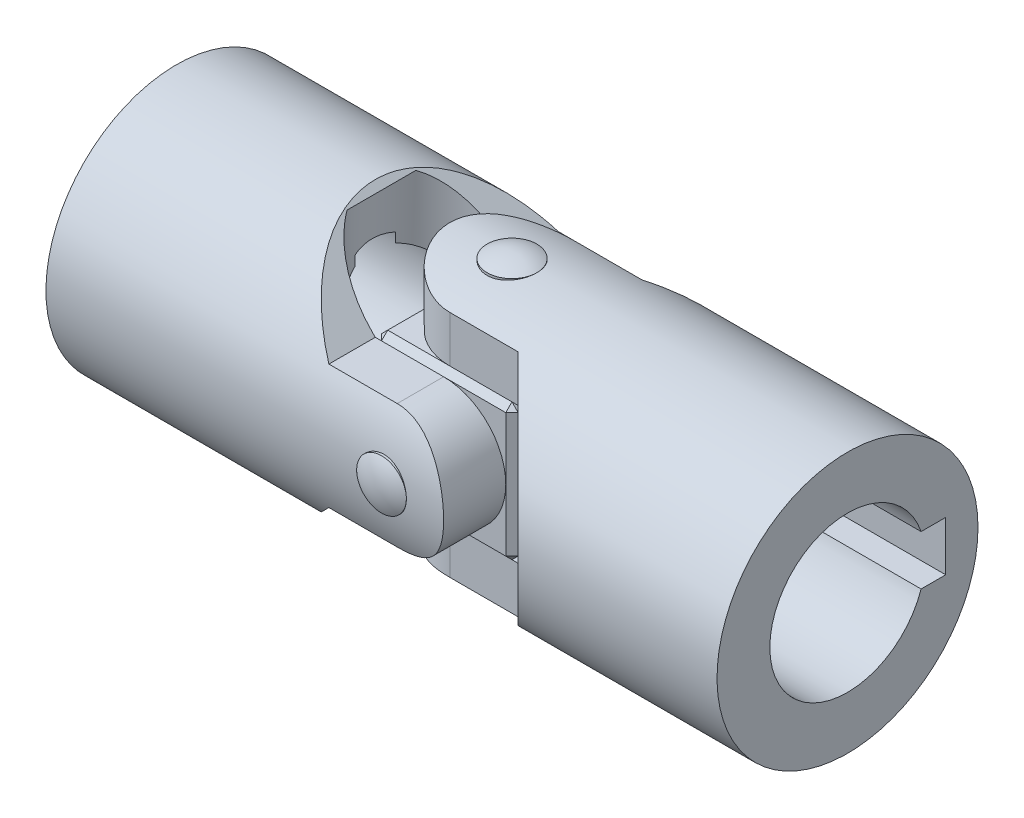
ISO-10303-21;
HEADER;
FILE_DESCRIPTION(('STEP AP214'),'2;1');
FILE_NAME('part.step','',(''),(''),'','','');
FILE_SCHEMA(('AUTOMOTIVE_DESIGN { 1 0 10303 214 1 1 1 1 }'));
ENDSEC;
DATA;
#1=APPLICATION_CONTEXT('core data for automotive mechanical design processes');
#2=APPLICATION_PROTOCOL_DEFINITION('international standard','automotive_design',2000,#1);
#3=PRODUCT_CONTEXT('',#1,'mechanical');
#4=PRODUCT('Part','Part','',(#3));
#5=PRODUCT_RELATED_PRODUCT_CATEGORY('part','',(#4));
#6=PRODUCT_DEFINITION_FORMATION('','',#4);
#7=PRODUCT_DEFINITION_CONTEXT('part definition',#1,'design');
#8=PRODUCT_DEFINITION('design','',#6,#7);
#9=PRODUCT_DEFINITION_SHAPE('','',#8);
#10=(LENGTH_UNIT() NAMED_UNIT(*) SI_UNIT(.MILLI.,.METRE.));
#11=(NAMED_UNIT(*) PLANE_ANGLE_UNIT() SI_UNIT($,.RADIAN.));
#12=(NAMED_UNIT(*) SI_UNIT($,.STERADIAN.) SOLID_ANGLE_UNIT());
#13=UNCERTAINTY_MEASURE_WITH_UNIT(LENGTH_MEASURE(1.E-05),#10,'distance_accuracy_value','');
#14=(GEOMETRIC_REPRESENTATION_CONTEXT(3) GLOBAL_UNCERTAINTY_ASSIGNED_CONTEXT((#13)) GLOBAL_UNIT_ASSIGNED_CONTEXT((#10,
#11,#12)) REPRESENTATION_CONTEXT('',''));
#15=CARTESIAN_POINT('',(0.,0.,0.));
#16=DIRECTION('',(0.,0.,1.));
#17=DIRECTION('',(1.,0.,0.));
#18=AXIS2_PLACEMENT_3D('',#15,#16,#17);
#19=CARTESIAN_POINT('',(0.,21.,0.));
#20=DIRECTION('',(0.,-1.,0.));
#21=DIRECTION('',(-1.,0.,0.));
#22=AXIS2_PLACEMENT_3D('',#19,#20,#21);
#23=CYLINDRICAL_SURFACE('',#22,4.);
#24=CARTESIAN_POINT('',(0.,21.,0.));
#25=DIRECTION('',(0.,1.,0.));
#26=DIRECTION('',(1.,0.,0.));
#27=AXIS2_PLACEMENT_3D('',#24,#25,#26);
#28=CIRCLE('',#27,4.);
#29=CARTESIAN_POINT('',(-4.,21.,0.));
#30=VERTEX_POINT('',#29);
#31=EDGE_CURVE('P0_E10',#30,#30,#28,.T.);
#32=CARTESIAN_POINT('',(0.,-21.,0.));
#33=DIRECTION('',(0.,1.,0.));
#34=DIRECTION('',(0.,0.,1.));
#35=AXIS2_PLACEMENT_3D('',#32,#33,#34);
#36=CIRCLE('',#35,4.);
#37=CARTESIAN_POINT('',(-4.,-21.,0.));
#38=VERTEX_POINT('',#37);
#39=EDGE_CURVE('P0_E20',#38,#38,#36,.T.);
#40=CARTESIAN_POINT('',(-4.,21.,0.));
#41=CARTESIAN_POINT('',(-4.,20.5625,0.));
#42=CARTESIAN_POINT('',(-4.,20.125,0.));
#43=CARTESIAN_POINT('',(-4.,19.25,0.));
#44=CARTESIAN_POINT('',(-4.,18.8125,0.));
#45=CARTESIAN_POINT('',(-4.,17.9375,0.));
#46=CARTESIAN_POINT('',(-4.,17.5,0.));
#47=CARTESIAN_POINT('',(-4.,16.625,0.));
#48=CARTESIAN_POINT('',(-4.,16.1875,0.));
#49=CARTESIAN_POINT('',(-4.,15.3125,0.));
#50=CARTESIAN_POINT('',(-4.,14.875,0.));
#51=CARTESIAN_POINT('',(-4.,14.,0.));
#52=CARTESIAN_POINT('',(-4.,13.5625,0.));
#53=CARTESIAN_POINT('',(-4.,12.6875,0.));
#54=CARTESIAN_POINT('',(-4.,12.25,0.));
#55=CARTESIAN_POINT('',(-4.,11.375,0.));
#56=CARTESIAN_POINT('',(-4.,10.9375,0.));
#57=CARTESIAN_POINT('',(-4.,10.0625,0.));
#58=CARTESIAN_POINT('',(-4.,9.625,0.));
#59=CARTESIAN_POINT('',(-4.,8.75,0.));
#60=CARTESIAN_POINT('',(-4.,8.3125,0.));
#61=CARTESIAN_POINT('',(-4.,7.4375,0.));
#62=CARTESIAN_POINT('',(-4.,7.,0.));
#63=CARTESIAN_POINT('',(-4.,6.125,0.));
#64=CARTESIAN_POINT('',(-4.,5.6875,0.));
#65=CARTESIAN_POINT('',(-4.,4.8125,0.));
#66=CARTESIAN_POINT('',(-4.,4.375,0.));
#67=CARTESIAN_POINT('',(-4.,3.5,0.));
#68=CARTESIAN_POINT('',(-4.,3.0625,0.));
#69=CARTESIAN_POINT('',(-4.,2.1875,0.));
#70=CARTESIAN_POINT('',(-4.,1.75,0.));
#71=CARTESIAN_POINT('',(-4.,0.874999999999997,0.));
#72=CARTESIAN_POINT('',(-4.,0.437499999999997,0.));
#73=CARTESIAN_POINT('',(-4.,-0.437500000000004,0.));
#74=CARTESIAN_POINT('',(-4.,-0.875000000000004,0.));
#75=CARTESIAN_POINT('',(-4.,-1.75000000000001,0.));
#76=CARTESIAN_POINT('',(-4.,-2.18750000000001,0.));
#77=CARTESIAN_POINT('',(-4.,-3.0625,0.));
#78=CARTESIAN_POINT('',(-4.,-3.5,0.));
#79=CARTESIAN_POINT('',(-4.,-4.375,0.));
#80=CARTESIAN_POINT('',(-4.,-4.8125,0.));
#81=CARTESIAN_POINT('',(-4.,-5.68750000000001,0.));
#82=CARTESIAN_POINT('',(-4.,-6.12500000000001,0.));
#83=CARTESIAN_POINT('',(-4.,-7.00000000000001,0.));
#84=CARTESIAN_POINT('',(-4.,-7.4375,0.));
#85=CARTESIAN_POINT('',(-4.,-8.3125,0.));
#86=CARTESIAN_POINT('',(-4.,-8.75,0.));
#87=CARTESIAN_POINT('',(-4.,-9.625,0.));
#88=CARTESIAN_POINT('',(-4.,-10.0625,0.));
#89=CARTESIAN_POINT('',(-4.,-10.9375,0.));
#90=CARTESIAN_POINT('',(-4.,-11.375,0.));
#91=CARTESIAN_POINT('',(-4.,-12.25,0.));
#92=CARTESIAN_POINT('',(-4.,-12.6875,0.));
#93=CARTESIAN_POINT('',(-4.,-13.5625,0.));
#94=CARTESIAN_POINT('',(-4.,-14.,0.));
#95=CARTESIAN_POINT('',(-4.,-14.875,0.));
#96=CARTESIAN_POINT('',(-4.,-15.3125,0.));
#97=CARTESIAN_POINT('',(-4.,-16.1875,0.));
#98=CARTESIAN_POINT('',(-4.,-16.625,0.));
#99=CARTESIAN_POINT('',(-4.,-17.5,0.));
#100=CARTESIAN_POINT('',(-4.,-17.9375,0.));
#101=CARTESIAN_POINT('',(-4.,-18.8125,0.));
#102=CARTESIAN_POINT('',(-4.,-19.25,0.));
#103=CARTESIAN_POINT('',(-4.,-20.125,0.));
#104=CARTESIAN_POINT('',(-4.,-20.5625,0.));
#105=CARTESIAN_POINT('',(-4.,-21.,0.));
#106=B_SPLINE_CURVE_WITH_KNOTS('',3,(#40,#41,#42,#43,#44,#45,#46,#47,#48,#49,#50,#51,#52,#53,
#54,#55,#56,#57,#58,#59,#60,#61,#62,#63,#64,#65,#66,#67,#68,#69,#70,#71,#72,#73,#74,#75,#76,#77,
#78,#79,#80,#81,#82,#83,#84,#85,#86,#87,#88,#89,#90,#91,#92,#93,#94,#95,#96,#97,#98,#99,#100,
#101,#102,#103,#104,#105),.UNSPECIFIED.,.F.,.F.,(4,2,2,2,2,2,2,2,2,2,2,2,2,2,2,2,2,2,2,2,2,2,2,
2,2,2,2,2,2,2,2,2,4),(0.,1.3125,2.625,3.9375,5.25,6.5625,7.875,9.1875,10.5,11.8125,13.125,
14.4375,15.75,17.0625,18.375,19.6875,21.,22.3125,23.625,24.9375,26.25,27.5625,28.875,30.1875,
31.5,32.8125,34.125,35.4375,36.75,38.0625,39.375,40.6875,42.),.UNSPECIFIED.);
#107=EDGE_CURVE('P0_BSEAM14',#30,#38,#106,.T.);
#108=ORIENTED_EDGE('',*,*,#31,.F.);
#109=ORIENTED_EDGE('',*,*,#39,.T.);
#110=ORIENTED_EDGE('',*,*,#107,.T.);
#111=ORIENTED_EDGE('',*,*,#107,.F.);
#112=EDGE_LOOP('',(#108,#110,#109,#111));
#113=FACE_BOUND('',#112,.T.);
#114=ADVANCED_FACE('P0_F14',(#113),#23,.T.);
#115=CARTESIAN_POINT('',(0.,13.5,0.));
#116=DIRECTION('',(0.,1.,0.));
#117=DIRECTION('',(0.,0.,-1.));
#118=AXIS2_PLACEMENT_3D('',#115,#116,#117);
#119=SPHERICAL_SURFACE('',#118,8.49999999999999);
#120=ORIENTED_EDGE('',*,*,#31,.T.);
#121=EDGE_LOOP('',(#120));
#122=FACE_BOUND('',#121,.T.);
#123=ADVANCED_FACE('P0_F29',(#122),#119,.T.);
#124=CARTESIAN_POINT('',(0.,-13.5,0.));
#125=DIRECTION('',(0.,-1.,0.));
#126=DIRECTION('',(0.,0.,-1.));
#127=AXIS2_PLACEMENT_3D('',#124,#125,#126);
#128=SPHERICAL_SURFACE('',#127,8.49999999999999);
#129=ORIENTED_EDGE('',*,*,#39,.F.);
#130=EDGE_LOOP('',(#129));
#131=FACE_BOUND('',#130,.T.);
#132=ADVANCED_FACE('P0_F27',(#131),#128,.T.);
#133=CLOSED_SHELL('',(#114,#123,#132));
#134=MANIFOLD_SOLID_BREP('P0_B1',#133);
#135=CARTESIAN_POINT('',(0.,0.,21.));
#136=DIRECTION('',(0.,0.,-1.));
#137=DIRECTION('',(-1.,0.,0.));
#138=AXIS2_PLACEMENT_3D('',#135,#136,#137);
#139=CYLINDRICAL_SURFACE('',#138,4.);
#140=CARTESIAN_POINT('',(0.,0.,21.));
#141=DIRECTION('',(0.,0.,1.));
#142=DIRECTION('',(1.,0.,0.));
#143=AXIS2_PLACEMENT_3D('',#140,#141,#142);
#144=CIRCLE('',#143,4.);
#145=CARTESIAN_POINT('',(-4.,0.,21.));
#146=VERTEX_POINT('',#145);
#147=EDGE_CURVE('P1_E10',#146,#146,#144,.T.);
#148=CARTESIAN_POINT('',(0.,0.,-21.));
#149=DIRECTION('',(0.,0.,1.));
#150=DIRECTION('',(0.,-1.,0.));
#151=AXIS2_PLACEMENT_3D('',#148,#149,#150);
#152=CIRCLE('',#151,4.);
#153=CARTESIAN_POINT('',(-4.,0.,-21.));
#154=VERTEX_POINT('',#153);
#155=EDGE_CURVE('P1_E20',#154,#154,#152,.T.);
#156=CARTESIAN_POINT('',(-4.,0.,21.));
#157=CARTESIAN_POINT('',(-4.,0.,20.5625));
#158=CARTESIAN_POINT('',(-4.,0.,20.125));
#159=CARTESIAN_POINT('',(-4.,0.,19.25));
#160=CARTESIAN_POINT('',(-4.,0.,18.8125));
#161=CARTESIAN_POINT('',(-4.,0.,17.9375));
#162=CARTESIAN_POINT('',(-4.,0.,17.5));
#163=CARTESIAN_POINT('',(-4.,0.,16.625));
#164=CARTESIAN_POINT('',(-4.,0.,16.1875));
#165=CARTESIAN_POINT('',(-4.,0.,15.3125));
#166=CARTESIAN_POINT('',(-4.,0.,14.875));
#167=CARTESIAN_POINT('',(-4.,0.,14.));
#168=CARTESIAN_POINT('',(-4.,0.,13.5625));
#169=CARTESIAN_POINT('',(-4.,0.,12.6875));
#170=CARTESIAN_POINT('',(-4.,0.,12.25));
#171=CARTESIAN_POINT('',(-4.,0.,11.375));
#172=CARTESIAN_POINT('',(-4.,0.,10.9375));
#173=CARTESIAN_POINT('',(-4.,0.,10.0625));
#174=CARTESIAN_POINT('',(-4.,0.,9.625));
#175=CARTESIAN_POINT('',(-4.,0.,8.75));
#176=CARTESIAN_POINT('',(-4.,0.,8.3125));
#177=CARTESIAN_POINT('',(-4.,0.,7.4375));
#178=CARTESIAN_POINT('',(-4.,0.,7.));
#179=CARTESIAN_POINT('',(-4.,0.,6.125));
#180=CARTESIAN_POINT('',(-4.,0.,5.6875));
#181=CARTESIAN_POINT('',(-4.,0.,4.8125));
#182=CARTESIAN_POINT('',(-4.,0.,4.375));
#183=CARTESIAN_POINT('',(-4.,0.,3.5));
#184=CARTESIAN_POINT('',(-4.,0.,3.0625));
#185=CARTESIAN_POINT('',(-4.,0.,2.1875));
#186=CARTESIAN_POINT('',(-4.,0.,1.75));
#187=CARTESIAN_POINT('',(-4.,0.,0.874999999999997));
#188=CARTESIAN_POINT('',(-4.,0.,0.437499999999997));
#189=CARTESIAN_POINT('',(-4.,0.,-0.437500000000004));
#190=CARTESIAN_POINT('',(-4.,0.,-0.875000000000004));
#191=CARTESIAN_POINT('',(-4.,0.,-1.75000000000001));
#192=CARTESIAN_POINT('',(-4.,0.,-2.18750000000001));
#193=CARTESIAN_POINT('',(-4.,0.,-3.0625));
#194=CARTESIAN_POINT('',(-4.,0.,-3.5));
#195=CARTESIAN_POINT('',(-4.,0.,-4.375));
#196=CARTESIAN_POINT('',(-4.,0.,-4.8125));
#197=CARTESIAN_POINT('',(-4.,0.,-5.68750000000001));
#198=CARTESIAN_POINT('',(-4.,0.,-6.12500000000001));
#199=CARTESIAN_POINT('',(-4.,0.,-7.00000000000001));
#200=CARTESIAN_POINT('',(-4.,0.,-7.4375));
#201=CARTESIAN_POINT('',(-4.,0.,-8.3125));
#202=CARTESIAN_POINT('',(-4.,0.,-8.75));
#203=CARTESIAN_POINT('',(-4.,0.,-9.625));
#204=CARTESIAN_POINT('',(-4.,0.,-10.0625));
#205=CARTESIAN_POINT('',(-4.,0.,-10.9375));
#206=CARTESIAN_POINT('',(-4.,0.,-11.375));
#207=CARTESIAN_POINT('',(-4.,0.,-12.25));
#208=CARTESIAN_POINT('',(-4.,0.,-12.6875));
#209=CARTESIAN_POINT('',(-4.,0.,-13.5625));
#210=CARTESIAN_POINT('',(-4.,0.,-14.));
#211=CARTESIAN_POINT('',(-4.,0.,-14.875));
#212=CARTESIAN_POINT('',(-4.,0.,-15.3125));
#213=CARTESIAN_POINT('',(-4.,0.,-16.1875));
#214=CARTESIAN_POINT('',(-4.,0.,-16.625));
#215=CARTESIAN_POINT('',(-4.,0.,-17.5));
#216=CARTESIAN_POINT('',(-4.,0.,-17.9375));
#217=CARTESIAN_POINT('',(-4.,0.,-18.8125));
#218=CARTESIAN_POINT('',(-4.,0.,-19.25));
#219=CARTESIAN_POINT('',(-4.,0.,-20.125));
#220=CARTESIAN_POINT('',(-4.,0.,-20.5625));
#221=CARTESIAN_POINT('',(-4.,0.,-21.));
#222=B_SPLINE_CURVE_WITH_KNOTS('',3,(#156,#157,#158,#159,#160,#161,#162,#163,#164,#165,#166,
#167,#168,#169,#170,#171,#172,#173,#174,#175,#176,#177,#178,#179,#180,#181,#182,#183,#184,#185,
#186,#187,#188,#189,#190,#191,#192,#193,#194,#195,#196,#197,#198,#199,#200,#201,#202,#203,#204,
#205,#206,#207,#208,#209,#210,#211,#212,#213,#214,#215,#216,#217,#218,#219,#220,#221),
.UNSPECIFIED.,.F.,.F.,(4,2,2,2,2,2,2,2,2,2,2,2,2,2,2,2,2,2,2,2,2,2,2,2,2,2,2,2,2,2,2,2,4),(0.,
1.3125,2.625,3.9375,5.25,6.5625,7.875,9.1875,10.5,11.8125,13.125,14.4375,15.75,17.0625,18.375,
19.6875,21.,22.3125,23.625,24.9375,26.25,27.5625,28.875,30.1875,31.5,32.8125,34.125,35.4375,
36.75,38.0625,39.375,40.6875,42.),.UNSPECIFIED.);
#223=EDGE_CURVE('P1_BSEAM14',#146,#154,#222,.T.);
#224=ORIENTED_EDGE('',*,*,#147,.F.);
#225=ORIENTED_EDGE('',*,*,#155,.T.);
#226=ORIENTED_EDGE('',*,*,#223,.T.);
#227=ORIENTED_EDGE('',*,*,#223,.F.);
#228=EDGE_LOOP('',(#224,#226,#225,#227));
#229=FACE_BOUND('',#228,.T.);
#230=ADVANCED_FACE('P1_F14',(#229),#139,.T.);
#231=CARTESIAN_POINT('',(0.,0.,13.5));
#232=DIRECTION('',(0.,0.,1.));
#233=DIRECTION('',(0.,1.,0.));
#234=AXIS2_PLACEMENT_3D('',#231,#232,#233);
#235=SPHERICAL_SURFACE('',#234,8.49999999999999);
#236=ORIENTED_EDGE('',*,*,#147,.T.);
#237=EDGE_LOOP('',(#236));
#238=FACE_BOUND('',#237,.T.);
#239=ADVANCED_FACE('P1_F29',(#238),#235,.T.);
#240=CARTESIAN_POINT('',(0.,0.,-13.5));
#241=DIRECTION('',(0.,0.,-1.));
#242=DIRECTION('',(0.,1.,0.));
#243=AXIS2_PLACEMENT_3D('',#240,#241,#242);
#244=SPHERICAL_SURFACE('',#243,8.49999999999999);
#245=ORIENTED_EDGE('',*,*,#155,.F.);
#246=EDGE_LOOP('',(#245));
#247=FACE_BOUND('',#246,.T.);
#248=ADVANCED_FACE('P1_F27',(#247),#244,.T.);
#249=CLOSED_SHELL('',(#230,#239,#248));
#250=MANIFOLD_SOLID_BREP('P1_B1',#249);
#251=CARTESIAN_POINT('',(0.,0.,11.));
#252=DIRECTION('',(0.,0.,-1.));
#253=DIRECTION('',(-1.,0.,0.));
#254=AXIS2_PLACEMENT_3D('',#251,#252,#253);
#255=CYLINDRICAL_SURFACE('',#254,4.);
#256=CARTESIAN_POINT('',(0.,0.,0.));
#257=DIRECTION('',(0.,0.707106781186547,-0.707106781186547));
#258=DIRECTION('',(0.,-0.707106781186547,-0.707106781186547));
#259=AXIS2_PLACEMENT_3D('',#256,#257,#258);
#260=ELLIPSE('',#259,5.65685424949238,4.);
#261=CARTESIAN_POINT('',(4.,0.,0.));
#262=VERTEX_POINT('',#261);
#263=CARTESIAN_POINT('',(-4.,0.,0.));
#264=VERTEX_POINT('',#263);
#265=EDGE_CURVE('P2_E116',#262,#264,#260,.F.);
#266=ORIENTED_EDGE('',*,*,#265,.F.);
#267=CARTESIAN_POINT('',(0.,0.,0.));
#268=DIRECTION('',(0.,-0.707106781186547,-0.707106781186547));
#269=DIRECTION('',(0.,0.707106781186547,-0.707106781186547));
#270=AXIS2_PLACEMENT_3D('',#267,#268,#269);
#271=ELLIPSE('',#270,5.65685424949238,4.);
#272=EDGE_CURVE('P2_E120',#264,#262,#271,.F.);
#273=ORIENTED_EDGE('',*,*,#272,.F.);
#274=EDGE_LOOP('',(#266,#273));
#275=FACE_BOUND('',#274,.T.);
#276=CARTESIAN_POINT('',(0.,0.,11.));
#277=DIRECTION('',(0.,0.,1.));
#278=DIRECTION('',(1.,0.,0.));
#279=AXIS2_PLACEMENT_3D('',#276,#277,#278);
#280=CIRCLE('',#279,4.);
#281=CARTESIAN_POINT('',(4.,0.,11.));
#282=VERTEX_POINT('',#281);
#283=EDGE_CURVE('P2_E127',#282,#282,#280,.T.);
#284=ORIENTED_EDGE('',*,*,#283,.T.);
#285=EDGE_LOOP('',(#284));
#286=FACE_BOUND('',#285,.T.);
#287=ADVANCED_FACE('P2_F16',(#275,#286),#255,.F.);
#288=CARTESIAN_POINT('',(11.,11.,11.));
#289=DIRECTION('',(0.,0.,1.));
#290=DIRECTION('',(1.,0.,0.));
#291=AXIS2_PLACEMENT_3D('',#288,#289,#290);
#292=PLANE('',#291);
#293=DIRECTION('',(0.,-1.,0.));
#294=VECTOR('',#293,1.);
#295=CARTESIAN_POINT('',(-9.99999999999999,-11.,11.));
#296=LINE('',#295,#294);
#297=CARTESIAN_POINT('',(-9.99999999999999,9.99999999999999,11.));
#298=VERTEX_POINT('',#297);
#299=CARTESIAN_POINT('',(-9.99999999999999,-9.99999999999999,11.));
#300=VERTEX_POINT('',#299);
#301=EDGE_CURVE('P2_E164',#298,#300,#296,.T.);
#302=ORIENTED_EDGE('',*,*,#301,.T.);
#303=DIRECTION('',(1.,0.,0.));
#304=VECTOR('',#303,1.);
#305=CARTESIAN_POINT('',(11.,-9.99999999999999,11.));
#306=LINE('',#305,#304);
#307=CARTESIAN_POINT('',(9.99999999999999,-9.99999999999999,11.));
#308=VERTEX_POINT('',#307);
#309=EDGE_CURVE('P2_E168',#300,#308,#306,.T.);
#310=ORIENTED_EDGE('',*,*,#309,.T.);
#311=DIRECTION('',(0.,1.,0.));
#312=VECTOR('',#311,1.);
#313=CARTESIAN_POINT('',(9.99999999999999,11.,11.));
#314=LINE('',#313,#312);
#315=CARTESIAN_POINT('',(9.99999999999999,9.99999999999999,11.));
#316=VERTEX_POINT('',#315);
#317=EDGE_CURVE('P2_E166',#308,#316,#314,.T.);
#318=ORIENTED_EDGE('',*,*,#317,.T.);
#319=DIRECTION('',(-1.,0.,0.));
#320=VECTOR('',#319,1.);
#321=CARTESIAN_POINT('',(-11.,9.99999999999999,11.));
#322=LINE('',#321,#320);
#323=EDGE_CURVE('P2_E162',#316,#298,#322,.T.);
#324=ORIENTED_EDGE('',*,*,#323,.T.);
#325=EDGE_LOOP('',(#302,#310,#318,#324));
#326=FACE_BOUND('',#325,.T.);
#327=ORIENTED_EDGE('',*,*,#283,.F.);
#328=EDGE_LOOP('',(#327));
#329=FACE_BOUND('',#328,.T.);
#330=ADVANCED_FACE('P2_F283',(#326,#329),#292,.T.);
#331=CARTESIAN_POINT('',(11.,11.,-11.));
#332=DIRECTION('',(0.,0.,1.));
#333=DIRECTION('',(1.,0.,0.));
#334=AXIS2_PLACEMENT_3D('',#331,#332,#333);
#335=PLANE('',#334);
#336=DIRECTION('',(-1.,0.,0.));
#337=VECTOR('',#336,1.);
#338=CARTESIAN_POINT('',(11.,-9.99999999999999,-11.));
#339=LINE('',#338,#337);
#340=CARTESIAN_POINT('',(9.99999999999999,-9.99999999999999,-11.));
#341=VERTEX_POINT('',#340);
#342=CARTESIAN_POINT('',(-9.99999999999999,-9.99999999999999,-11.));
#343=VERTEX_POINT('',#342);
#344=EDGE_CURVE('P2_E157',#341,#343,#339,.T.);
#345=ORIENTED_EDGE('',*,*,#344,.T.);
#346=DIRECTION('',(0.,1.,0.));
#347=VECTOR('',#346,1.);
#348=CARTESIAN_POINT('',(-9.99999999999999,11.,-11.));
#349=LINE('',#348,#347);
#350=CARTESIAN_POINT('',(-9.99999999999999,9.99999999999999,-11.));
#351=VERTEX_POINT('',#350);
#352=EDGE_CURVE('P2_E159',#343,#351,#349,.T.);
#353=ORIENTED_EDGE('',*,*,#352,.T.);
#354=DIRECTION('',(1.,0.,0.));
#355=VECTOR('',#354,1.);
#356=CARTESIAN_POINT('',(11.,9.99999999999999,-11.));
#357=LINE('',#356,#355);
#358=CARTESIAN_POINT('',(9.99999999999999,9.99999999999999,-11.));
#359=VERTEX_POINT('',#358);
#360=EDGE_CURVE('P2_E153',#351,#359,#357,.T.);
#361=ORIENTED_EDGE('',*,*,#360,.T.);
#362=DIRECTION('',(0.,-1.,0.));
#363=VECTOR('',#362,1.);
#364=CARTESIAN_POINT('',(9.99999999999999,11.,-11.));
#365=LINE('',#364,#363);
#366=EDGE_CURVE('P2_E155',#359,#341,#365,.T.);
#367=ORIENTED_EDGE('',*,*,#366,.T.);
#368=EDGE_LOOP('',(#345,#353,#361,#367));
#369=FACE_BOUND('',#368,.T.);
#370=CARTESIAN_POINT('',(0.,0.,-11.));
#371=DIRECTION('',(0.,0.,1.));
#372=DIRECTION('',(1.,0.,0.));
#373=AXIS2_PLACEMENT_3D('',#370,#371,#372);
#374=CIRCLE('',#373,4.);
#375=CARTESIAN_POINT('',(4.,0.,-11.));
#376=VERTEX_POINT('',#375);
#377=EDGE_CURVE('P2_E259',#376,#376,#374,.T.);
#378=ORIENTED_EDGE('',*,*,#377,.T.);
#379=EDGE_LOOP('',(#378));
#380=FACE_BOUND('',#379,.T.);
#381=ADVANCED_FACE('P2_F267',(#369,#380),#335,.F.);
#382=CARTESIAN_POINT('',(-11.,11.,11.));
#383=DIRECTION('',(0.,-1.,0.));
#384=DIRECTION('',(0.,0.,-1.));
#385=AXIS2_PLACEMENT_3D('',#382,#383,#384);
#386=PLANE('',#385);
#387=DIRECTION('',(-1.,0.,0.));
#388=VECTOR('',#387,1.);
#389=CARTESIAN_POINT('',(-11.,11.,-9.99999999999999));
#390=LINE('',#389,#388);
#391=CARTESIAN_POINT('',(9.99999999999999,11.,-9.99999999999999));
#392=VERTEX_POINT('',#391);
#393=CARTESIAN_POINT('',(-9.99999999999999,11.,-9.99999999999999));
#394=VERTEX_POINT('',#393);
#395=EDGE_CURVE('P2_E25',#392,#394,#390,.T.);
#396=ORIENTED_EDGE('',*,*,#395,.T.);
#397=DIRECTION('',(0.,0.,1.));
#398=VECTOR('',#397,1.);
#399=CARTESIAN_POINT('',(-9.99999999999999,11.,11.));
#400=LINE('',#399,#398);
#401=CARTESIAN_POINT('',(-9.99999999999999,11.,9.99999999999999));
#402=VERTEX_POINT('',#401);
#403=EDGE_CURVE('P2_E11',#394,#402,#400,.T.);
#404=ORIENTED_EDGE('',*,*,#403,.T.);
#405=DIRECTION('',(1.,0.,0.));
#406=VECTOR('',#405,1.);
#407=CARTESIAN_POINT('',(11.,11.,9.99999999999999));
#408=LINE('',#407,#406);
#409=CARTESIAN_POINT('',(9.99999999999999,11.,9.99999999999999));
#410=VERTEX_POINT('',#409);
#411=EDGE_CURVE('P2_E180',#402,#410,#408,.T.);
#412=ORIENTED_EDGE('',*,*,#411,.T.);
#413=DIRECTION('',(0.,0.,-1.));
#414=VECTOR('',#413,1.);
#415=CARTESIAN_POINT('',(9.99999999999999,11.,11.));
#416=LINE('',#415,#414);
#417=EDGE_CURVE('P2_E36',#410,#392,#416,.T.);
#418=ORIENTED_EDGE('',*,*,#417,.T.);
#419=EDGE_LOOP('',(#396,#404,#412,#418));
#420=FACE_BOUND('',#419,.T.);
#421=CARTESIAN_POINT('',(0.,11.,0.));
#422=DIRECTION('',(0.,1.,0.));
#423=DIRECTION('',(0.,0.,1.));
#424=AXIS2_PLACEMENT_3D('',#421,#422,#423);
#425=CIRCLE('',#424,4.);
#426=CARTESIAN_POINT('',(0.,11.,4.));
#427=VERTEX_POINT('',#426);
#428=EDGE_CURVE('P2_E249',#427,#427,#425,.T.);
#429=ORIENTED_EDGE('',*,*,#428,.F.);
#430=EDGE_LOOP('',(#429));
#431=FACE_BOUND('',#430,.T.);
#432=ADVANCED_FACE('P2_F293',(#420,#431),#386,.F.);
#433=CARTESIAN_POINT('',(-11.,-11.,11.));
#434=DIRECTION('',(1.,0.,0.));
#435=DIRECTION('',(0.,0.,-1.));
#436=AXIS2_PLACEMENT_3D('',#433,#434,#435);
#437=PLANE('',#436);
#438=DIRECTION('',(0.,-1.,0.));
#439=VECTOR('',#438,1.);
#440=CARTESIAN_POINT('',(-11.,-11.,-9.99999999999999));
#441=LINE('',#440,#439);
#442=CARTESIAN_POINT('',(-11.,9.99999999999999,-9.99999999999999));
#443=VERTEX_POINT('',#442);
#444=CARTESIAN_POINT('',(-11.,-9.99999999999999,-9.99999999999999));
#445=VERTEX_POINT('',#444);
#446=EDGE_CURVE('P2_E148',#443,#445,#441,.T.);
#447=ORIENTED_EDGE('',*,*,#446,.T.);
#448=DIRECTION('',(0.,0.,1.));
#449=VECTOR('',#448,1.);
#450=CARTESIAN_POINT('',(-11.,-9.99999999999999,11.));
#451=LINE('',#450,#449);
#452=CARTESIAN_POINT('',(-11.,-9.99999999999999,9.99999999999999));
#453=VERTEX_POINT('',#452);
#454=EDGE_CURVE('P2_E150',#445,#453,#451,.T.);
#455=ORIENTED_EDGE('',*,*,#454,.T.);
#456=DIRECTION('',(0.,1.,0.));
#457=VECTOR('',#456,1.);
#458=CARTESIAN_POINT('',(-11.,11.,9.99999999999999));
#459=LINE('',#458,#457);
#460=CARTESIAN_POINT('',(-11.,9.99999999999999,9.99999999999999));
#461=VERTEX_POINT('',#460);
#462=EDGE_CURVE('P2_E146',#453,#461,#459,.T.);
#463=ORIENTED_EDGE('',*,*,#462,.T.);
#464=DIRECTION('',(0.,0.,-1.));
#465=VECTOR('',#464,1.);
#466=CARTESIAN_POINT('',(-11.,9.99999999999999,11.));
#467=LINE('',#466,#465);
#468=EDGE_CURVE('P2_E144',#461,#443,#467,.T.);
#469=ORIENTED_EDGE('',*,*,#468,.T.);
#470=EDGE_LOOP('',(#447,#455,#463,#469));
#471=FACE_BOUND('',#470,.T.);
#472=ADVANCED_FACE('P2_F300',(#471),#437,.F.);
#473=CARTESIAN_POINT('',(-11.,-11.,11.));
#474=DIRECTION('',(0.,1.,0.));
#475=DIRECTION('',(0.,0.,1.));
#476=AXIS2_PLACEMENT_3D('',#473,#474,#475);
#477=PLANE('',#476);
#478=DIRECTION('',(-1.,0.,0.));
#479=VECTOR('',#478,1.);
#480=CARTESIAN_POINT('',(-11.,-11.,9.99999999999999));
#481=LINE('',#480,#479);
#482=CARTESIAN_POINT('',(9.99999999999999,-11.,9.99999999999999));
#483=VERTEX_POINT('',#482);
#484=CARTESIAN_POINT('',(-9.99999999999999,-11.,9.99999999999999));
#485=VERTEX_POINT('',#484);
#486=EDGE_CURVE('P2_E137',#483,#485,#481,.T.);
#487=ORIENTED_EDGE('',*,*,#486,.T.);
#488=DIRECTION('',(0.,0.,-1.));
#489=VECTOR('',#488,1.);
#490=CARTESIAN_POINT('',(-9.99999999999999,-11.,11.));
#491=LINE('',#490,#489);
#492=CARTESIAN_POINT('',(-9.99999999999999,-11.,-9.99999999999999));
#493=VERTEX_POINT('',#492);
#494=EDGE_CURVE('P2_E141',#485,#493,#491,.T.);
#495=ORIENTED_EDGE('',*,*,#494,.T.);
#496=DIRECTION('',(1.,0.,0.));
#497=VECTOR('',#496,1.);
#498=CARTESIAN_POINT('',(-11.,-11.,-9.99999999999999));
#499=LINE('',#498,#497);
#500=CARTESIAN_POINT('',(9.99999999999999,-11.,-9.99999999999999));
#501=VERTEX_POINT('',#500);
#502=EDGE_CURVE('P2_E139',#493,#501,#499,.T.);
#503=ORIENTED_EDGE('',*,*,#502,.T.);
#504=DIRECTION('',(0.,0.,1.));
#505=VECTOR('',#504,1.);
#506=CARTESIAN_POINT('',(9.99999999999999,-11.,11.));
#507=LINE('',#506,#505);
#508=EDGE_CURVE('P2_E130',#501,#483,#507,.T.);
#509=ORIENTED_EDGE('',*,*,#508,.T.);
#510=EDGE_LOOP('',(#487,#495,#503,#509));
#511=FACE_BOUND('',#510,.T.);
#512=CARTESIAN_POINT('',(0.,-11.,0.));
#513=DIRECTION('',(0.,1.,0.));
#514=DIRECTION('',(0.,0.,1.));
#515=AXIS2_PLACEMENT_3D('',#512,#513,#514);
#516=CIRCLE('',#515,4.);
#517=CARTESIAN_POINT('',(0.,-11.,4.));
#518=VERTEX_POINT('',#517);
#519=EDGE_CURVE('P2_E255',#518,#518,#516,.T.);
#520=ORIENTED_EDGE('',*,*,#519,.T.);
#521=EDGE_LOOP('',(#520));
#522=FACE_BOUND('',#521,.T.);
#523=ADVANCED_FACE('P2_F278',(#511,#522),#477,.F.);
#524=CARTESIAN_POINT('',(11.,-11.,11.));
#525=DIRECTION('',(-1.,0.,0.));
#526=DIRECTION('',(0.,0.,1.));
#527=AXIS2_PLACEMENT_3D('',#524,#525,#526);
#528=PLANE('',#527);
#529=DIRECTION('',(0.,-1.,0.));
#530=VECTOR('',#529,1.);
#531=CARTESIAN_POINT('',(11.,-11.,9.99999999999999));
#532=LINE('',#531,#530);
#533=CARTESIAN_POINT('',(11.,9.99999999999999,9.99999999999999));
#534=VERTEX_POINT('',#533);
#535=CARTESIAN_POINT('',(11.,-9.99999999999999,9.99999999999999));
#536=VERTEX_POINT('',#535);
#537=EDGE_CURVE('P2_E173',#534,#536,#532,.T.);
#538=ORIENTED_EDGE('',*,*,#537,.T.);
#539=DIRECTION('',(0.,0.,-1.));
#540=VECTOR('',#539,1.);
#541=CARTESIAN_POINT('',(11.,-9.99999999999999,11.));
#542=LINE('',#541,#540);
#543=CARTESIAN_POINT('',(11.,-9.99999999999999,-9.99999999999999));
#544=VERTEX_POINT('',#543);
#545=EDGE_CURVE('P2_E177',#536,#544,#542,.T.);
#546=ORIENTED_EDGE('',*,*,#545,.T.);
#547=DIRECTION('',(0.,1.,0.));
#548=VECTOR('',#547,1.);
#549=CARTESIAN_POINT('',(11.,-11.,-9.99999999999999));
#550=LINE('',#549,#548);
#551=CARTESIAN_POINT('',(11.,9.99999999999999,-9.99999999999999));
#552=VERTEX_POINT('',#551);
#553=EDGE_CURVE('P2_E175',#544,#552,#550,.T.);
#554=ORIENTED_EDGE('',*,*,#553,.T.);
#555=DIRECTION('',(0.,0.,1.));
#556=VECTOR('',#555,1.);
#557=CARTESIAN_POINT('',(11.,9.99999999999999,11.));
#558=LINE('',#557,#556);
#559=EDGE_CURVE('P2_E171',#552,#534,#558,.T.);
#560=ORIENTED_EDGE('',*,*,#559,.T.);
#561=EDGE_LOOP('',(#538,#546,#554,#560));
#562=FACE_BOUND('',#561,.T.);
#563=ADVANCED_FACE('P2_F269',(#562),#528,.F.);
#564=CARTESIAN_POINT('',(0.,0.,0.));
#565=DIRECTION('',(0.,0.707106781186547,-0.707106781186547));
#566=DIRECTION('',(0.,-0.707106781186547,-0.707106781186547));
#567=AXIS2_PLACEMENT_3D('',#564,#565,#566);
#568=ELLIPSE('',#567,5.65685424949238,4.);
#569=EDGE_CURVE('P2_E119',#262,#264,#568,.T.);
#570=ORIENTED_EDGE('',*,*,#569,.F.);
#571=CARTESIAN_POINT('',(0.,0.,0.));
#572=DIRECTION('',(0.,-0.707106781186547,-0.707106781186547));
#573=DIRECTION('',(0.,0.707106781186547,-0.707106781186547));
#574=AXIS2_PLACEMENT_3D('',#571,#572,#573);
#575=ELLIPSE('',#574,5.65685424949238,4.);
#576=EDGE_CURVE('P2_E111',#264,#262,#575,.T.);
#577=ORIENTED_EDGE('',*,*,#576,.F.);
#578=EDGE_LOOP('',(#570,#577));
#579=FACE_BOUND('',#578,.T.);
#580=ORIENTED_EDGE('',*,*,#377,.F.);
#581=EDGE_LOOP('',(#580));
#582=FACE_BOUND('',#581,.T.);
#583=ADVANCED_FACE('P2_F132',(#579,#582),#255,.F.);
#584=CARTESIAN_POINT('',(0.,-11.,0.));
#585=DIRECTION('',(0.,1.,0.));
#586=DIRECTION('',(0.,0.,1.));
#587=AXIS2_PLACEMENT_3D('',#584,#585,#586);
#588=CYLINDRICAL_SURFACE('',#587,4.);
#589=ORIENTED_EDGE('',*,*,#569,.T.);
#590=ORIENTED_EDGE('',*,*,#272,.T.);
#591=EDGE_LOOP('',(#589,#590));
#592=FACE_BOUND('',#591,.T.);
#593=ORIENTED_EDGE('',*,*,#519,.F.);
#594=EDGE_LOOP('',(#593));
#595=FACE_BOUND('',#594,.T.);
#596=ADVANCED_FACE('P2_F124',(#592,#595),#588,.F.);
#597=ORIENTED_EDGE('',*,*,#265,.T.);
#598=ORIENTED_EDGE('',*,*,#576,.T.);
#599=EDGE_LOOP('',(#597,#598));
#600=FACE_BOUND('',#599,.T.);
#601=ORIENTED_EDGE('',*,*,#428,.T.);
#602=EDGE_LOOP('',(#601));
#603=FACE_BOUND('',#602,.T.);
#604=ADVANCED_FACE('P2_F113',(#600,#603),#588,.F.);
#605=CARTESIAN_POINT('',(9.99999999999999,11.,11.));
#606=DIRECTION('',(-0.707106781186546,-0.707106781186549,0.));
#607=DIRECTION('',(0.707106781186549,-0.707106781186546,0.));
#608=AXIS2_PLACEMENT_3D('',#605,#606,#607);
#609=PLANE('',#608);
#610=DIRECTION('',(0.707106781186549,-0.707106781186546,0.));
#611=VECTOR('',#610,1.);
#612=CARTESIAN_POINT('',(10.5,10.5,9.99999999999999));
#613=LINE('',#612,#611);
#614=EDGE_CURVE('P2_E20',#534,#410,#613,.F.);
#615=ORIENTED_EDGE('',*,*,#614,.F.);
#616=ORIENTED_EDGE('',*,*,#559,.F.);
#617=DIRECTION('',(-0.707106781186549,0.707106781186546,0.));
#618=VECTOR('',#617,1.);
#619=CARTESIAN_POINT('',(11.,9.99999999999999,-9.99999999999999));
#620=LINE('',#619,#618);
#621=EDGE_CURVE('P2_E243',#392,#552,#620,.F.);
#622=ORIENTED_EDGE('',*,*,#621,.F.);
#623=ORIENTED_EDGE('',*,*,#417,.F.);
#624=EDGE_LOOP('',(#615,#616,#622,#623));
#625=FACE_BOUND('',#624,.T.);
#626=ADVANCED_FACE('P2_F18',(#625),#609,.F.);
#627=CARTESIAN_POINT('',(9.99999999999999,9.99999999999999,11.));
#628=DIRECTION('',(0.577350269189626,0.577350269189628,0.577350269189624));
#629=DIRECTION('',(-0.707106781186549,0.707106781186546,0.));
#630=AXIS2_PLACEMENT_3D('',#627,#628,#629);
#631=PLANE('',#630);
#632=DIRECTION('',(0.707106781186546,0.,-0.707106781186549));
#633=VECTOR('',#632,1.);
#634=CARTESIAN_POINT('',(9.99999999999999,9.99999999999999,11.));
#635=LINE('',#634,#633);
#636=EDGE_CURVE('P2_E238',#534,#316,#635,.F.);
#637=ORIENTED_EDGE('',*,*,#636,.F.);
#638=ORIENTED_EDGE('',*,*,#614,.T.);
#639=DIRECTION('',(0.,-0.707106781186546,0.707106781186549));
#640=VECTOR('',#639,1.);
#641=CARTESIAN_POINT('',(9.99999999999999,9.99999999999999,11.));
#642=LINE('',#641,#640);
#643=EDGE_CURVE('P2_E241',#316,#410,#642,.F.);
#644=ORIENTED_EDGE('',*,*,#643,.F.);
#645=EDGE_LOOP('',(#637,#638,#644));
#646=FACE_BOUND('',#645,.T.);
#647=ADVANCED_FACE('P2_F377',(#646),#631,.T.);
#648=CARTESIAN_POINT('',(11.,9.99999999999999,-9.99999999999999));
#649=DIRECTION('',(0.577350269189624,0.577350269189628,-0.577350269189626));
#650=DIRECTION('',(0.,0.707106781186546,0.707106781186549));
#651=AXIS2_PLACEMENT_3D('',#648,#649,#650);
#652=PLANE('',#651);
#653=DIRECTION('',(0.,-0.707106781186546,-0.707106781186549));
#654=VECTOR('',#653,1.);
#655=CARTESIAN_POINT('',(9.99999999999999,10.5,-10.5));
#656=LINE('',#655,#654);
#657=EDGE_CURVE('P2_E232',#392,#359,#656,.T.);
#658=ORIENTED_EDGE('',*,*,#657,.F.);
#659=ORIENTED_EDGE('',*,*,#621,.T.);
#660=DIRECTION('',(0.707106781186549,0.,0.707106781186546));
#661=VECTOR('',#660,1.);
#662=CARTESIAN_POINT('',(11.,9.99999999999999,-9.99999999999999));
#663=LINE('',#662,#661);
#664=EDGE_CURVE('P2_E235',#359,#552,#663,.T.);
#665=ORIENTED_EDGE('',*,*,#664,.F.);
#666=EDGE_LOOP('',(#658,#659,#665));
#667=FACE_BOUND('',#666,.T.);
#668=ADVANCED_FACE('P2_F374',(#667),#652,.T.);
#669=CARTESIAN_POINT('',(11.,9.99999999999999,11.));
#670=DIRECTION('',(0.,0.707106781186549,0.707106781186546));
#671=DIRECTION('',(0.,-0.707106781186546,0.707106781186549));
#672=AXIS2_PLACEMENT_3D('',#669,#670,#671);
#673=PLANE('',#672);
#674=ORIENTED_EDGE('',*,*,#643,.T.);
#675=ORIENTED_EDGE('',*,*,#411,.F.);
#676=DIRECTION('',(0.,0.707106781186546,-0.707106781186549));
#677=VECTOR('',#676,1.);
#678=CARTESIAN_POINT('',(-9.99999999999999,10.5,10.5));
#679=LINE('',#678,#677);
#680=EDGE_CURVE('P2_E227',#298,#402,#679,.T.);
#681=ORIENTED_EDGE('',*,*,#680,.F.);
#682=ORIENTED_EDGE('',*,*,#323,.F.);
#683=EDGE_LOOP('',(#674,#675,#681,#682));
#684=FACE_BOUND('',#683,.T.);
#685=ADVANCED_FACE('P2_F370',(#684),#673,.T.);
#686=CARTESIAN_POINT('',(9.99999999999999,11.,11.));
#687=DIRECTION('',(0.707106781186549,0.,0.707106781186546));
#688=DIRECTION('',(0.707106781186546,0.,-0.707106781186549));
#689=AXIS2_PLACEMENT_3D('',#686,#687,#688);
#690=PLANE('',#689);
#691=ORIENTED_EDGE('',*,*,#636,.T.);
#692=ORIENTED_EDGE('',*,*,#317,.F.);
#693=DIRECTION('',(-0.707106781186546,0.,0.707106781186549));
#694=VECTOR('',#693,1.);
#695=CARTESIAN_POINT('',(9.99999999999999,-9.99999999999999,11.));
#696=LINE('',#695,#694);
#697=EDGE_CURVE('P2_E224',#536,#308,#696,.T.);
#698=ORIENTED_EDGE('',*,*,#697,.F.);
#699=ORIENTED_EDGE('',*,*,#537,.F.);
#700=EDGE_LOOP('',(#691,#692,#698,#699));
#701=FACE_BOUND('',#700,.T.);
#702=ADVANCED_FACE('P2_F366',(#701),#690,.T.);
#703=CARTESIAN_POINT('',(11.,-9.99999999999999,11.));
#704=DIRECTION('',(-0.707106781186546,0.707106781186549,0.));
#705=DIRECTION('',(-0.707106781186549,-0.707106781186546,0.));
#706=AXIS2_PLACEMENT_3D('',#703,#704,#705);
#707=PLANE('',#706);
#708=DIRECTION('',(0.707106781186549,0.707106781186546,0.));
#709=VECTOR('',#708,1.);
#710=CARTESIAN_POINT('',(9.99999999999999,-11.,-9.99999999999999));
#711=LINE('',#710,#709);
#712=EDGE_CURVE('P2_E218',#544,#501,#711,.F.);
#713=ORIENTED_EDGE('',*,*,#712,.F.);
#714=ORIENTED_EDGE('',*,*,#545,.F.);
#715=DIRECTION('',(-0.707106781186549,-0.707106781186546,0.));
#716=VECTOR('',#715,1.);
#717=CARTESIAN_POINT('',(10.5,-10.5,9.99999999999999));
#718=LINE('',#717,#716);
#719=EDGE_CURVE('P2_E221',#483,#536,#718,.F.);
#720=ORIENTED_EDGE('',*,*,#719,.F.);
#721=ORIENTED_EDGE('',*,*,#508,.F.);
#722=EDGE_LOOP('',(#713,#714,#720,#721));
#723=FACE_BOUND('',#722,.T.);
#724=ADVANCED_FACE('P2_F362',(#723),#707,.F.);
#725=CARTESIAN_POINT('',(11.,-11.,-9.99999999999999));
#726=DIRECTION('',(-0.707106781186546,0.,0.707106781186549));
#727=DIRECTION('',(0.707106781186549,0.,0.707106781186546));
#728=AXIS2_PLACEMENT_3D('',#725,#726,#727);
#729=PLANE('',#728);
#730=ORIENTED_EDGE('',*,*,#664,.T.);
#731=ORIENTED_EDGE('',*,*,#553,.F.);
#732=DIRECTION('',(-0.707106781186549,0.,-0.707106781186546));
#733=VECTOR('',#732,1.);
#734=CARTESIAN_POINT('',(10.5,-9.99999999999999,-10.5));
#735=LINE('',#734,#733);
#736=EDGE_CURVE('P2_E216',#341,#544,#735,.F.);
#737=ORIENTED_EDGE('',*,*,#736,.F.);
#738=ORIENTED_EDGE('',*,*,#366,.F.);
#739=EDGE_LOOP('',(#730,#731,#737,#738));
#740=FACE_BOUND('',#739,.T.);
#741=ADVANCED_FACE('P2_F358',(#740),#729,.F.);
#742=CARTESIAN_POINT('',(-11.,11.,-9.99999999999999));
#743=DIRECTION('',(0.,-0.707106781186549,0.707106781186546));
#744=DIRECTION('',(0.,-0.707106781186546,-0.707106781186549));
#745=AXIS2_PLACEMENT_3D('',#742,#743,#744);
#746=PLANE('',#745);
#747=ORIENTED_EDGE('',*,*,#657,.T.);
#748=ORIENTED_EDGE('',*,*,#360,.F.);
#749=DIRECTION('',(0.,0.707106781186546,0.707106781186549));
#750=VECTOR('',#749,1.);
#751=CARTESIAN_POINT('',(-9.99999999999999,9.99999999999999,-11.));
#752=LINE('',#751,#750);
#753=EDGE_CURVE('P2_E213',#394,#351,#752,.F.);
#754=ORIENTED_EDGE('',*,*,#753,.F.);
#755=ORIENTED_EDGE('',*,*,#395,.F.);
#756=EDGE_LOOP('',(#747,#748,#754,#755));
#757=FACE_BOUND('',#756,.T.);
#758=ADVANCED_FACE('P2_F354',(#757),#746,.F.);
#759=CARTESIAN_POINT('',(-11.,9.99999999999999,11.));
#760=DIRECTION('',(0.707106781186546,-0.707106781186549,0.));
#761=DIRECTION('',(0.707106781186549,0.707106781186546,0.));
#762=AXIS2_PLACEMENT_3D('',#759,#760,#761);
#763=PLANE('',#762);
#764=DIRECTION('',(0.707106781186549,0.707106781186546,0.));
#765=VECTOR('',#764,1.);
#766=CARTESIAN_POINT('',(-11.,9.99999999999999,9.99999999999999));
#767=LINE('',#766,#765);
#768=EDGE_CURVE('P2_E229',#402,#461,#767,.F.);
#769=ORIENTED_EDGE('',*,*,#768,.F.);
#770=ORIENTED_EDGE('',*,*,#403,.F.);
#771=DIRECTION('',(-0.707106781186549,-0.707106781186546,0.));
#772=VECTOR('',#771,1.);
#773=CARTESIAN_POINT('',(-10.5,10.5,-9.99999999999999));
#774=LINE('',#773,#772);
#775=EDGE_CURVE('P2_E210',#443,#394,#774,.F.);
#776=ORIENTED_EDGE('',*,*,#775,.F.);
#777=ORIENTED_EDGE('',*,*,#468,.F.);
#778=EDGE_LOOP('',(#769,#770,#776,#777));
#779=FACE_BOUND('',#778,.T.);
#780=ADVANCED_FACE('P2_F350',(#779),#763,.F.);
#781=CARTESIAN_POINT('',(-11.,9.99999999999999,9.99999999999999));
#782=DIRECTION('',(-0.577350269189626,0.577350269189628,0.577350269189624));
#783=DIRECTION('',(-0.707106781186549,-0.707106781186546,0.));
#784=AXIS2_PLACEMENT_3D('',#781,#782,#783);
#785=PLANE('',#784);
#786=ORIENTED_EDGE('',*,*,#680,.T.);
#787=ORIENTED_EDGE('',*,*,#768,.T.);
#788=DIRECTION('',(0.707106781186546,0.,0.707106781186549));
#789=VECTOR('',#788,1.);
#790=CARTESIAN_POINT('',(-11.,9.99999999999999,9.99999999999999));
#791=LINE('',#790,#789);
#792=EDGE_CURVE('P2_E207',#298,#461,#791,.F.);
#793=ORIENTED_EDGE('',*,*,#792,.F.);
#794=EDGE_LOOP('',(#786,#787,#793));
#795=FACE_BOUND('',#794,.T.);
#796=ADVANCED_FACE('P2_F346',(#795),#785,.T.);
#797=CARTESIAN_POINT('',(9.99999999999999,-9.99999999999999,11.));
#798=DIRECTION('',(0.577350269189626,-0.577350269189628,0.577350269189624));
#799=DIRECTION('',(0.707106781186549,0.707106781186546,0.));
#800=AXIS2_PLACEMENT_3D('',#797,#798,#799);
#801=PLANE('',#800);
#802=ORIENTED_EDGE('',*,*,#719,.T.);
#803=ORIENTED_EDGE('',*,*,#697,.T.);
#804=DIRECTION('',(0.,-0.707106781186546,-0.707106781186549));
#805=VECTOR('',#804,1.);
#806=CARTESIAN_POINT('',(9.99999999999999,-9.99999999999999,11.));
#807=LINE('',#806,#805);
#808=EDGE_CURVE('P2_E205',#483,#308,#807,.F.);
#809=ORIENTED_EDGE('',*,*,#808,.F.);
#810=EDGE_LOOP('',(#802,#803,#809));
#811=FACE_BOUND('',#810,.T.);
#812=ADVANCED_FACE('P2_F342',(#811),#801,.T.);
#813=CARTESIAN_POINT('',(9.99999999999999,-11.,-9.99999999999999));
#814=DIRECTION('',(0.577350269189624,-0.577350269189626,-0.577350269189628));
#815=DIRECTION('',(0.,0.707106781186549,-0.707106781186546));
#816=AXIS2_PLACEMENT_3D('',#813,#814,#815);
#817=PLANE('',#816);
#818=ORIENTED_EDGE('',*,*,#736,.T.);
#819=ORIENTED_EDGE('',*,*,#712,.T.);
#820=DIRECTION('',(0.,-0.707106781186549,0.707106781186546));
#821=VECTOR('',#820,1.);
#822=CARTESIAN_POINT('',(9.99999999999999,-11.,-9.99999999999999));
#823=LINE('',#822,#821);
#824=EDGE_CURVE('P2_E202',#341,#501,#823,.T.);
#825=ORIENTED_EDGE('',*,*,#824,.F.);
#826=EDGE_LOOP('',(#818,#819,#825));
#827=FACE_BOUND('',#826,.T.);
#828=ADVANCED_FACE('P2_F338',(#827),#817,.T.);
#829=CARTESIAN_POINT('',(-9.99999999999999,9.99999999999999,-11.));
#830=DIRECTION('',(-0.577350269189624,0.577350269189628,-0.577350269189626));
#831=DIRECTION('',(0.,0.707106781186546,0.707106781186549));
#832=AXIS2_PLACEMENT_3D('',#829,#830,#831);
#833=PLANE('',#832);
#834=ORIENTED_EDGE('',*,*,#775,.T.);
#835=ORIENTED_EDGE('',*,*,#753,.T.);
#836=DIRECTION('',(0.707106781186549,0.,-0.707106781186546));
#837=VECTOR('',#836,1.);
#838=CARTESIAN_POINT('',(-9.99999999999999,9.99999999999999,-11.));
#839=LINE('',#838,#837);
#840=EDGE_CURVE('P2_E200',#443,#351,#839,.T.);
#841=ORIENTED_EDGE('',*,*,#840,.F.);
#842=EDGE_LOOP('',(#834,#835,#841));
#843=FACE_BOUND('',#842,.T.);
#844=ADVANCED_FACE('P2_F334',(#843),#833,.T.);
#845=CARTESIAN_POINT('',(-9.99999999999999,11.,11.));
#846=DIRECTION('',(-0.707106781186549,0.,0.707106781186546));
#847=DIRECTION('',(0.707106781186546,0.,0.707106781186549));
#848=AXIS2_PLACEMENT_3D('',#845,#846,#847);
#849=PLANE('',#848);
#850=ORIENTED_EDGE('',*,*,#792,.T.);
#851=ORIENTED_EDGE('',*,*,#462,.F.);
#852=DIRECTION('',(-0.707106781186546,0.,-0.707106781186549));
#853=VECTOR('',#852,1.);
#854=CARTESIAN_POINT('',(-11.,-9.99999999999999,9.99999999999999));
#855=LINE('',#854,#853);
#856=EDGE_CURVE('P2_E197',#300,#453,#855,.T.);
#857=ORIENTED_EDGE('',*,*,#856,.F.);
#858=ORIENTED_EDGE('',*,*,#301,.F.);
#859=EDGE_LOOP('',(#850,#851,#857,#858));
#860=FACE_BOUND('',#859,.T.);
#861=ADVANCED_FACE('P2_F330',(#860),#849,.T.);
#862=CARTESIAN_POINT('',(11.,-9.99999999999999,11.));
#863=DIRECTION('',(0.,-0.707106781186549,0.707106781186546));
#864=DIRECTION('',(0.,-0.707106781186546,-0.707106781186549));
#865=AXIS2_PLACEMENT_3D('',#862,#863,#864);
#866=PLANE('',#865);
#867=ORIENTED_EDGE('',*,*,#808,.T.);
#868=ORIENTED_EDGE('',*,*,#309,.F.);
#869=DIRECTION('',(0.,0.707106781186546,0.707106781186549));
#870=VECTOR('',#869,1.);
#871=CARTESIAN_POINT('',(-9.99999999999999,-10.5,10.5));
#872=LINE('',#871,#870);
#873=EDGE_CURVE('P2_E194',#485,#300,#872,.T.);
#874=ORIENTED_EDGE('',*,*,#873,.F.);
#875=ORIENTED_EDGE('',*,*,#486,.F.);
#876=EDGE_LOOP('',(#867,#868,#874,#875));
#877=FACE_BOUND('',#876,.T.);
#878=ADVANCED_FACE('P2_F326',(#877),#866,.T.);
#879=CARTESIAN_POINT('',(-11.,-11.,-9.99999999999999));
#880=DIRECTION('',(0.,0.707106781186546,0.707106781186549));
#881=DIRECTION('',(0.,-0.707106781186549,0.707106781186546));
#882=AXIS2_PLACEMENT_3D('',#879,#880,#881);
#883=PLANE('',#882);
#884=ORIENTED_EDGE('',*,*,#824,.T.);
#885=ORIENTED_EDGE('',*,*,#502,.F.);
#886=DIRECTION('',(0.,0.707106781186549,-0.707106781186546));
#887=VECTOR('',#886,1.);
#888=CARTESIAN_POINT('',(-9.99999999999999,-11.,-9.99999999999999));
#889=LINE('',#888,#887);
#890=EDGE_CURVE('P2_E191',#343,#493,#889,.F.);
#891=ORIENTED_EDGE('',*,*,#890,.F.);
#892=ORIENTED_EDGE('',*,*,#344,.F.);
#893=EDGE_LOOP('',(#884,#885,#891,#892));
#894=FACE_BOUND('',#893,.T.);
#895=ADVANCED_FACE('P2_F322',(#894),#883,.F.);
#896=CARTESIAN_POINT('',(-11.,-11.,-9.99999999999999));
#897=DIRECTION('',(0.707106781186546,0.,0.707106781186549));
#898=DIRECTION('',(0.707106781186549,0.,-0.707106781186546));
#899=AXIS2_PLACEMENT_3D('',#896,#897,#898);
#900=PLANE('',#899);
#901=ORIENTED_EDGE('',*,*,#840,.T.);
#902=ORIENTED_EDGE('',*,*,#352,.F.);
#903=DIRECTION('',(-0.707106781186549,0.,0.707106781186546));
#904=VECTOR('',#903,1.);
#905=CARTESIAN_POINT('',(-10.5,-9.99999999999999,-10.5));
#906=LINE('',#905,#904);
#907=EDGE_CURVE('P2_E188',#445,#343,#906,.F.);
#908=ORIENTED_EDGE('',*,*,#907,.F.);
#909=ORIENTED_EDGE('',*,*,#446,.F.);
#910=EDGE_LOOP('',(#901,#902,#908,#909));
#911=FACE_BOUND('',#910,.T.);
#912=ADVANCED_FACE('P2_F318',(#911),#900,.F.);
#913=CARTESIAN_POINT('',(-11.,-9.99999999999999,9.99999999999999));
#914=DIRECTION('',(-0.577350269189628,-0.577350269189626,0.577350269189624));
#915=DIRECTION('',(0.707106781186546,-0.707106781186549,0.));
#916=AXIS2_PLACEMENT_3D('',#913,#914,#915);
#917=PLANE('',#916);
#918=ORIENTED_EDGE('',*,*,#873,.T.);
#919=ORIENTED_EDGE('',*,*,#856,.T.);
#920=DIRECTION('',(-0.707106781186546,0.707106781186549,0.));
#921=VECTOR('',#920,1.);
#922=CARTESIAN_POINT('',(-11.,-9.99999999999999,9.99999999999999));
#923=LINE('',#922,#921);
#924=EDGE_CURVE('P2_E186',#485,#453,#923,.T.);
#925=ORIENTED_EDGE('',*,*,#924,.F.);
#926=EDGE_LOOP('',(#918,#919,#925));
#927=FACE_BOUND('',#926,.T.);
#928=ADVANCED_FACE('P2_F314',(#927),#917,.T.);
#929=CARTESIAN_POINT('',(-9.99999999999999,-11.,-9.99999999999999));
#930=DIRECTION('',(-0.577350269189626,-0.577350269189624,-0.577350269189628));
#931=DIRECTION('',(-0.707106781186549,0.,0.707106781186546));
#932=AXIS2_PLACEMENT_3D('',#929,#930,#931);
#933=PLANE('',#932);
#934=ORIENTED_EDGE('',*,*,#907,.T.);
#935=ORIENTED_EDGE('',*,*,#890,.T.);
#936=DIRECTION('',(0.707106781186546,-0.707106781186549,0.));
#937=VECTOR('',#936,1.);
#938=CARTESIAN_POINT('',(-9.99999999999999,-11.,-9.99999999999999));
#939=LINE('',#938,#937);
#940=EDGE_CURVE('P2_E184',#445,#493,#939,.T.);
#941=ORIENTED_EDGE('',*,*,#940,.F.);
#942=EDGE_LOOP('',(#934,#935,#941));
#943=FACE_BOUND('',#942,.T.);
#944=ADVANCED_FACE('P2_F310',(#943),#933,.T.);
#945=CARTESIAN_POINT('',(-9.99999999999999,-11.,11.));
#946=DIRECTION('',(0.707106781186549,0.707106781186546,0.));
#947=DIRECTION('',(-0.707106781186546,0.707106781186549,0.));
#948=AXIS2_PLACEMENT_3D('',#945,#946,#947);
#949=PLANE('',#948);
#950=ORIENTED_EDGE('',*,*,#924,.T.);
#951=ORIENTED_EDGE('',*,*,#454,.F.);
#952=ORIENTED_EDGE('',*,*,#940,.T.);
#953=ORIENTED_EDGE('',*,*,#494,.F.);
#954=EDGE_LOOP('',(#950,#951,#952,#953));
#955=FACE_BOUND('',#954,.T.);
#956=ADVANCED_FACE('P2_F307',(#955),#949,.F.);
#957=CLOSED_SHELL('',(#287,#330,#381,#432,#472,#523,#563,#583,#596,#604,#626,#647,#668,#685,
#702,#724,#741,#758,#780,#796,#812,#828,#844,#861,#878,#895,#912,#928,#944,#956));
#958=MANIFOLD_SOLID_BREP('P2_B1',#957);
#959=CARTESIAN_POINT('',(-22.,1.53625267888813E-13,0.));
#960=DIRECTION('',(-1.,0.,0.));
#961=DIRECTION('',(0.,-1.,0.));
#962=AXIS2_PLACEMENT_3D('',#959,#960,#961);
#963=PLANE('',#962);
#964=DIRECTION('',(0.,1.,0.));
#965=VECTOR('',#964,1.);
#966=CARTESIAN_POINT('',(-22.,1.53135409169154E-13,4.));
#967=LINE('',#966,#965);
#968=CARTESIAN_POINT('',(-22.0000000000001,-11.8427192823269,4.));
#969=VERTEX_POINT('',#968);
#970=CARTESIAN_POINT('',(-22.0000000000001,-10.2469507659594,4.));
#971=VERTEX_POINT('',#970);
#972=EDGE_CURVE('P3_E194',#969,#971,#967,.T.);
#973=ORIENTED_EDGE('',*,*,#972,.F.);
#974=CARTESIAN_POINT('',(-22.,1.53625267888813E-13,0.));
#975=DIRECTION('',(-1.,0.,0.));
#976=DIRECTION('',(0.,-1.,0.));
#977=AXIS2_PLACEMENT_3D('',#974,#975,#976);
#978=CIRCLE('',#977,12.5);
#979=CARTESIAN_POINT('',(-21.9999999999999,12.062338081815,3.278719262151));
#980=VERTEX_POINT('',#979);
#981=EDGE_CURVE('P3_E286',#969,#980,#978,.T.);
#982=ORIENTED_EDGE('',*,*,#981,.T.);
#983=DIRECTION('',(0.,1.,0.));
#984=VECTOR('',#983,1.);
#985=CARTESIAN_POINT('',(-22.0000000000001,-19.9999999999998,3.278719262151));
#986=LINE('',#985,#984);
#987=CARTESIAN_POINT('',(-21.9999999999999,10.5000000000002,3.278719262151));
#988=VERTEX_POINT('',#987);
#989=EDGE_CURVE('P3_E229',#988,#980,#986,.T.);
#990=ORIENTED_EDGE('',*,*,#989,.F.);
#991=CARTESIAN_POINT('',(-22.,1.53625267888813E-13,0.));
#992=DIRECTION('',(-1.,0.,0.));
#993=DIRECTION('',(0.,-1.,0.));
#994=AXIS2_PLACEMENT_3D('',#991,#992,#993);
#995=CIRCLE('',#994,11.);
#996=EDGE_CURVE('P3_E287',#971,#988,#995,.T.);
#997=ORIENTED_EDGE('',*,*,#996,.F.);
#998=EDGE_LOOP('',(#973,#982,#990,#997));
#999=FACE_BOUND('',#998,.T.);
#1000=ADVANCED_FACE('P3_F16',(#999),#963,.T.);
#1001=CARTESIAN_POINT('',(10.,0.,0.));
#1002=DIRECTION('',(-1.,0.,0.));
#1003=DIRECTION('',(0.,-1.,0.));
#1004=AXIS2_PLACEMENT_3D('',#1001,#1002,#1003);
#1005=CYLINDRICAL_SURFACE('',#1004,11.);
#1006=CARTESIAN_POINT('',(-21.9999999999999,10.5000000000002,-3.278719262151));
#1007=VERTEX_POINT('',#1006);
#1008=CARTESIAN_POINT('',(-22.0000000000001,-10.2469507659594,-4.));
#1009=VERTEX_POINT('',#1008);
#1010=EDGE_CURVE('P3_E388',#1007,#1009,#995,.T.);
#1011=ORIENTED_EDGE('',*,*,#1010,.T.);
#1012=DIRECTION('',(-1.,0.,0.));
#1013=VECTOR('',#1012,1.);
#1014=CARTESIAN_POINT('',(9.99999999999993,-10.2469507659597,-4.));
#1015=LINE('',#1014,#1013);
#1016=CARTESIAN_POINT('',(-21.7469507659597,-10.2469507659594,-4.));
#1017=VERTEX_POINT('',#1016);
#1018=EDGE_CURVE('P3_E184',#1009,#1017,#1015,.F.);
#1019=ORIENTED_EDGE('',*,*,#1018,.T.);
#1020=CARTESIAN_POINT('',(-11.5,0.,0.));
#1021=DIRECTION('',(-0.707106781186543,0.707106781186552,0.));
#1022=DIRECTION('',(-0.707106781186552,-0.707106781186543,0.));
#1023=AXIS2_PLACEMENT_3D('',#1020,#1021,#1022);
#1024=ELLIPSE('',#1023,15.556349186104,11.);
#1025=CARTESIAN_POINT('',(-11.5,0.,-11.));
#1026=VERTEX_POINT('',#1025);
#1027=EDGE_CURVE('P3_E374',#1017,#1026,#1024,.F.);
#1028=ORIENTED_EDGE('',*,*,#1027,.T.);
#1029=CARTESIAN_POINT('',(-11.5,0.,0.));
#1030=DIRECTION('',(-0.707106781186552,-0.707106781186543,0.));
#1031=DIRECTION('',(-0.707106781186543,0.707106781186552,0.));
#1032=AXIS2_PLACEMENT_3D('',#1029,#1030,#1031);
#1033=ELLIPSE('',#1032,15.556349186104,11.);
#1034=EDGE_CURVE('P3_E367',#1026,#1007,#1033,.F.);
#1035=ORIENTED_EDGE('',*,*,#1034,.T.);
#1036=EDGE_LOOP('',(#1011,#1019,#1028,#1035));
#1037=FACE_BOUND('',#1036,.T.);
#1038=ADVANCED_FACE('P3_F265',(#1037),#1005,.F.);
#1039=CARTESIAN_POINT('',(0.,0.,-21.));
#1040=DIRECTION('',(0.,0.,1.));
#1041=DIRECTION('',(0.,1.,0.));
#1042=AXIS2_PLACEMENT_3D('',#1039,#1040,#1041);
#1043=CYLINDRICAL_SURFACE('',#1042,4.);
#1044=CARTESIAN_POINT('',(0.,0.,-11.));
#1045=DIRECTION('',(0.,0.,-1.));
#1046=DIRECTION('',(0.,-1.,0.));
#1047=AXIS2_PLACEMENT_3D('',#1044,#1045,#1046);
#1048=CIRCLE('',#1047,4.);
#1049=CARTESIAN_POINT('',(0.,-4.,-11.));
#1050=VERTEX_POINT('',#1049);
#1051=EDGE_CURVE('P3_E219',#1050,#1050,#1048,.F.);
#1052=ORIENTED_EDGE('',*,*,#1051,.T.);
#1053=EDGE_LOOP('',(#1052));
#1054=FACE_BOUND('',#1053,.T.);
#1055=CARTESIAN_POINT('',(4.,0.,-21.));
#1056=CARTESIAN_POINT('',(3.99999156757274,0.222525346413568,-20.9999959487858));
#1057=CARTESIAN_POINT('',(3.98136817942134,0.445159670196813,-20.9964265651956));
#1058=CARTESIAN_POINT('',(3.90741725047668,0.884150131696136,-20.9825316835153));
#1059=CARTESIAN_POINT('',(3.85205915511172,1.10050088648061,-20.972200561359));
#1060=CARTESIAN_POINT('',(3.70639899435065,1.5205123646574,-20.9459373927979));
#1061=CARTESIAN_POINT('',(3.61612893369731,1.72418451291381,-20.9300104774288));
#1062=CARTESIAN_POINT('',(3.40329912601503,2.11347489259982,-20.8942931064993));
#1063=CARTESIAN_POINT('',(3.2807418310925,2.29909449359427,-20.8745029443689));
#1064=CARTESIAN_POINT('',(3.00521146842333,2.64931909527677,-20.8329689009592));
#1065=CARTESIAN_POINT('',(2.85191716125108,2.81366912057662,-20.8112058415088));
#1066=CARTESIAN_POINT('',(2.51995515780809,3.11448301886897,-20.7683205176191));
#1067=CARTESIAN_POINT('',(2.34128560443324,3.25094484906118,-20.7471983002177));
#1068=CARTESIAN_POINT('',(1.96183546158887,3.49317498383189,-20.7077995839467));
#1069=CARTESIAN_POINT('',(1.76088581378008,3.59868283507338,-20.689547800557));
#1070=CARTESIAN_POINT('',(1.34370731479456,3.7743424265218,-20.6582272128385));
#1071=CARTESIAN_POINT('',(1.127479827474,3.84449731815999,-20.6451579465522));
#1072=CARTESIAN_POINT('',(0.688615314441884,3.94663904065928,-20.6258754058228));
#1073=CARTESIAN_POINT('',(0.466085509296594,3.97907116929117,-20.6195822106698));
#1074=CARTESIAN_POINT('',(0.0186607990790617,4.00622913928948,-20.6143234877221));
#1075=CARTESIAN_POINT('',(-0.206233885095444,4.00095847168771,-20.6153572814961));
#1076=CARTESIAN_POINT('',(-0.648770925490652,3.95322129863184,-20.6245630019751));
#1077=CARTESIAN_POINT('',(-0.866470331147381,3.91126210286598,-20.6326375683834));
#1078=CARTESIAN_POINT('',(-1.29168216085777,3.79213830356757,-20.6548620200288));
#1079=CARTESIAN_POINT('',(-1.49919413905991,3.71497216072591,-20.6690121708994));
#1080=CARTESIAN_POINT('',(-1.89961976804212,3.52713153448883,-20.7018946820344));
#1081=CARTESIAN_POINT('',(-2.09243536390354,3.41625308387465,-20.7206547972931));
#1082=CARTESIAN_POINT('',(-2.45691531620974,3.16427944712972,-20.7606252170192));
#1083=CARTESIAN_POINT('',(-2.62857745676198,3.02318109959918,-20.7818357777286));
#1084=CARTESIAN_POINT('',(-2.94880786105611,2.7120421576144,-20.8247408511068));
#1085=CARTESIAN_POINT('',(-3.09695475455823,2.54156786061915,-20.8464376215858));
#1086=CARTESIAN_POINT('',(-3.36261247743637,2.17796507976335,-20.8875534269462));
#1087=CARTESIAN_POINT('',(-3.48012298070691,1.98483635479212,-20.9069724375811));
#1088=CARTESIAN_POINT('',(-3.6812379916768,1.58096076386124,-20.9413858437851));
#1089=CARTESIAN_POINT('',(-3.76479766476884,1.37019104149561,-20.9563743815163));
#1090=CARTESIAN_POINT('',(-3.89520764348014,0.937257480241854,-20.9801929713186));
#1091=CARTESIAN_POINT('',(-3.94206197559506,0.715094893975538,-20.9890236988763));
#1092=CARTESIAN_POINT('',(-3.99714240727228,0.269306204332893,-20.9994386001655));
#1093=CARTESIAN_POINT('',(-4.00594568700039,0.0457538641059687,-21.0011310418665));
#1094=CARTESIAN_POINT('',(-3.98622378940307,-0.399628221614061,-20.997378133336));
#1095=CARTESIAN_POINT('',(-3.95770050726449,-0.621458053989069,-20.9919331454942));
#1096=CARTESIAN_POINT('',(-3.86461494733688,-1.05526017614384,-20.9745846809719));
#1097=CARTESIAN_POINT('',(-3.80034567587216,-1.26729762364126,-20.962733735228));
#1098=CARTESIAN_POINT('',(-3.63791030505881,-1.67758742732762,-20.9338968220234));
#1099=CARTESIAN_POINT('',(-3.53974184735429,-1.8758388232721,-20.9169104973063));
#1100=CARTESIAN_POINT('',(-3.31102398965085,-2.25538540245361,-20.879416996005));
#1101=CARTESIAN_POINT('',(-3.18012311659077,-2.43646501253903,-20.8588724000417));
#1102=CARTESIAN_POINT('',(-2.89013066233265,-2.77429491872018,-20.8166357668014));
#1103=CARTESIAN_POINT('',(-2.73103635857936,-2.93104286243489,-20.7949436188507));
#1104=CARTESIAN_POINT('',(-2.38655670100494,-3.21796115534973,-20.752496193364));
#1105=CARTESIAN_POINT('',(-2.20084037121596,-3.3477370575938,-20.7317578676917));
#1106=CARTESIAN_POINT('',(-1.8099048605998,-3.57425129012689,-20.693911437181));
#1107=CARTESIAN_POINT('',(-1.60468641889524,-3.67099087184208,-20.6768031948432));
#1108=CARTESIAN_POINT('',(-1.18155805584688,-3.82813194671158,-20.6482879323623));
#1109=CARTESIAN_POINT('',(-0.963716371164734,-3.88871186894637,-20.636852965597));
#1110=CARTESIAN_POINT('',(-0.520707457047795,-3.97236222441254,-20.6209161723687));
#1111=CARTESIAN_POINT('',(-0.295541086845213,-3.99543704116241,-20.6164135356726));
#1112=CARTESIAN_POINT('',(0.151772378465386,-4.0032718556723,-20.6148932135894));
#1113=CARTESIAN_POINT('',(0.373908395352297,-3.98865429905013,-20.6177539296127));
#1114=CARTESIAN_POINT('',(0.812494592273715,-3.92288461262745,-20.6303678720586));
#1115=CARTESIAN_POINT('',(1.02894480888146,-3.87173271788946,-20.640121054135));
#1116=CARTESIAN_POINT('',(1.44966609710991,-3.73461253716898,-20.6653690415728));
#1117=CARTESIAN_POINT('',(1.65396054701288,-3.6487137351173,-20.6808523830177));
#1118=CARTESIAN_POINT('',(2.04533695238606,-3.44460692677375,-20.7158238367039));
#1119=CARTESIAN_POINT('',(2.23241763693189,-3.32639653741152,-20.735312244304));
#1120=CARTESIAN_POINT('',(2.58716963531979,-3.05886697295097,-20.7764741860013));
#1121=CARTESIAN_POINT('',(2.75449661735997,-2.90909560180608,-20.7981768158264));
#1122=CARTESIAN_POINT('',(3.06185068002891,-2.58363633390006,-20.8411062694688));
#1123=CARTESIAN_POINT('',(3.2018714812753,-2.40794249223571,-20.8623329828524));
#1124=CARTESIAN_POINT('',(3.45186302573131,-2.03365875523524,-20.9021516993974));
#1125=CARTESIAN_POINT('',(3.56154099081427,-1.83487040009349,-20.9207172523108));
#1126=CARTESIAN_POINT('',(3.745765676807,-1.42139577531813,-20.9528630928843));
#1127=CARTESIAN_POINT('',(3.82034508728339,-1.20672451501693,-20.9664480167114));
#1128=CARTESIAN_POINT('',(3.9172747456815,-0.826213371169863,-20.9843625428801));
#1129=CARTESIAN_POINT('',(3.948243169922,-0.662584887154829,-20.9901931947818));
#1130=CARTESIAN_POINT('',(3.98960867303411,-0.332657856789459,-20.9980133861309));
#1131=CARTESIAN_POINT('',(4.00000630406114,-0.166359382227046,-21.0000030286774));
#1132=CARTESIAN_POINT('',(4.,0.,-21.));
#1133=B_SPLINE_CURVE_WITH_KNOTS('',3,(#1055,#1056,#1057,#1058,#1059,#1060,#1061,#1062,#1063,
#1064,#1065,#1066,#1067,#1068,#1069,#1070,#1071,#1072,#1073,#1074,#1075,#1076,#1077,#1078,#1079,
#1080,#1081,#1082,#1083,#1084,#1085,#1086,#1087,#1088,#1089,#1090,#1091,#1092,#1093,#1094,#1095,
#1096,#1097,#1098,#1099,#1100,#1101,#1102,#1103,#1104,#1105,#1106,#1107,#1108,#1109,#1110,#1111,
#1112,#1113,#1114,#1115,#1116,#1117,#1118,#1119,#1120,#1121,#1122,#1123,#1124,#1125,#1126,#1127,
#1128,#1129,#1130,#1131,#1132),.UNSPECIFIED.,.T.,.F.,(4,2,2,2,2,2,2,2,2,2,2,2,2,2,2,2,2,2,2,2,2,
2,2,2,2,2,2,2,2,2,2,2,2,2,2,2,2,2,4),(0.,0.666967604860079,1.33449066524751,2.00140323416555,
2.6682651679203,3.34249856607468,4.0167813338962,4.69658484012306,5.37632773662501,
6.04796246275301,6.71953500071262,7.3819656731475,8.04442531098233,8.71097554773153,
9.37759554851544,10.0550659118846,10.7325434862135,11.4109128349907,12.0892077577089,
12.7571769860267,13.4251123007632,14.0876516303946,14.7502370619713,15.4202680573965,
16.0903637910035,16.7696596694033,17.4489298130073,18.1248197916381,18.8006307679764,
19.4653532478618,20.1300714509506,20.7934669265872,21.4569113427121,22.130600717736,
22.8044448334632,23.4845805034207,24.1640814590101,24.6627181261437,25.1613414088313),.UNSPECIFIED.);
#1134=CARTESIAN_POINT('',(4.,0.,-21.));
#1135=VERTEX_POINT('',#1134);
#1136=EDGE_CURVE('P3_E344',#1135,#1135,#1133,.T.);
#1137=ORIENTED_EDGE('',*,*,#1136,.F.);
#1138=EDGE_LOOP('',(#1137));
#1139=FACE_BOUND('',#1138,.T.);
#1140=ADVANCED_FACE('P3_F280',(#1054,#1139),#1043,.F.);
#1141=CARTESIAN_POINT('',(-10.9999999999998,10.0000000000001,-21.));
#1142=DIRECTION('',(0.,-1.,0.));
#1143=DIRECTION('',(1.,0.,0.));
#1144=AXIS2_PLACEMENT_3D('',#1141,#1142,#1143);
#1145=PLANE('',#1144);
#1146=DIRECTION('',(0.,0.,1.));
#1147=VECTOR('',#1146,1.);
#1148=CARTESIAN_POINT('',(0.,10.,-21.));
#1149=LINE('',#1148,#1147);
#1150=CARTESIAN_POINT('',(0.,10.,11.));
#1151=VERTEX_POINT('',#1150);
#1152=CARTESIAN_POINT('',(0.,10.,18.4661853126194));
#1153=VERTEX_POINT('',#1152);
#1154=EDGE_CURVE('P3_E304',#1151,#1153,#1149,.T.);
#1155=ORIENTED_EDGE('',*,*,#1154,.F.);
#1156=DIRECTION('',(-1.,0.,0.));
#1157=VECTOR('',#1156,1.);
#1158=CARTESIAN_POINT('',(-10.9999999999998,10.0000000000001,11.));
#1159=LINE('',#1158,#1157);
#1160=CARTESIAN_POINT('',(-10.9999999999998,10.0000000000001,11.));
#1161=VERTEX_POINT('',#1160);
#1162=EDGE_CURVE('P3_E402',#1151,#1161,#1159,.T.);
#1163=ORIENTED_EDGE('',*,*,#1162,.T.);
#1164=DIRECTION('',(0.,0.,1.));
#1165=VECTOR('',#1164,1.);
#1166=CARTESIAN_POINT('',(-10.9999999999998,10.0000000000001,-21.));
#1167=LINE('',#1166,#1165);
#1168=CARTESIAN_POINT('',(-10.9999999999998,10.0000000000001,18.4661853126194));
#1169=VERTEX_POINT('',#1168);
#1170=EDGE_CURVE('P3_E308',#1161,#1169,#1167,.T.);
#1171=ORIENTED_EDGE('',*,*,#1170,.T.);
#1172=DIRECTION('',(1.,0.,0.));
#1173=VECTOR('',#1172,1.);
#1174=CARTESIAN_POINT('',(-53.9999999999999,10.0000000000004,18.4661853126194));
#1175=LINE('',#1174,#1173);
#1176=EDGE_CURVE('P3_E361',#1153,#1169,#1175,.F.);
#1177=ORIENTED_EDGE('',*,*,#1176,.F.);
#1178=EDGE_LOOP('',(#1155,#1163,#1171,#1177));
#1179=FACE_BOUND('',#1178,.T.);
#1180=ADVANCED_FACE('P3_F439',(#1179),#1145,.F.);
#1181=CARTESIAN_POINT('',(0.,-10.,-21.));
#1182=DIRECTION('',(0.,1.,0.));
#1183=DIRECTION('',(-1.,0.,0.));
#1184=AXIS2_PLACEMENT_3D('',#1181,#1182,#1183);
#1185=PLANE('',#1184);
#1186=DIRECTION('',(0.,0.,1.));
#1187=VECTOR('',#1186,1.);
#1188=CARTESIAN_POINT('',(0.,-10.,-21.));
#1189=LINE('',#1188,#1187);
#1190=CARTESIAN_POINT('',(0.,-10.,-18.4661853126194));
#1191=VERTEX_POINT('',#1190);
#1192=CARTESIAN_POINT('',(0.,-10.,-11.));
#1193=VERTEX_POINT('',#1192);
#1194=EDGE_CURVE('P3_E293',#1191,#1193,#1189,.T.);
#1195=ORIENTED_EDGE('',*,*,#1194,.T.);
#1196=DIRECTION('',(-1.,0.,0.));
#1197=VECTOR('',#1196,1.);
#1198=CARTESIAN_POINT('',(0.,-10.,-11.));
#1199=LINE('',#1198,#1197);
#1200=CARTESIAN_POINT('',(-11.,-9.99999999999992,-11.));
#1201=VERTEX_POINT('',#1200);
#1202=EDGE_CURVE('P3_E216',#1193,#1201,#1199,.T.);
#1203=ORIENTED_EDGE('',*,*,#1202,.T.);
#1204=DIRECTION('',(0.,0.,1.));
#1205=VECTOR('',#1204,1.);
#1206=CARTESIAN_POINT('',(-11.,-9.99999999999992,-21.));
#1207=LINE('',#1206,#1205);
#1208=CARTESIAN_POINT('',(-10.9999999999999,-9.99999999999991,-18.4661853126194));
#1209=VERTEX_POINT('',#1208);
#1210=EDGE_CURVE('P3_E309',#1209,#1201,#1207,.T.);
#1211=ORIENTED_EDGE('',*,*,#1210,.F.);
#1212=DIRECTION('',(1.,0.,0.));
#1213=VECTOR('',#1212,1.);
#1214=CARTESIAN_POINT('',(-54.0000000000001,-9.99999999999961,-18.4661853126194));
#1215=LINE('',#1214,#1213);
#1216=EDGE_CURVE('P3_E349',#1191,#1209,#1215,.F.);
#1217=ORIENTED_EDGE('',*,*,#1216,.F.);
#1218=EDGE_LOOP('',(#1195,#1203,#1211,#1217));
#1219=FACE_BOUND('',#1218,.T.);
#1220=ADVANCED_FACE('P3_F549',(#1219),#1185,.F.);
#1221=CARTESIAN_POINT('',(0.,0.,-21.));
#1222=DIRECTION('',(0.,0.,1.));
#1223=DIRECTION('',(0.,1.,0.));
#1224=AXIS2_PLACEMENT_3D('',#1221,#1222,#1223);
#1225=CYLINDRICAL_SURFACE('',#1224,10.);
#1226=CARTESIAN_POINT('',(0.,-10.,11.));
#1227=VERTEX_POINT('',#1226);
#1228=CARTESIAN_POINT('',(0.,-10.,18.4661853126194));
#1229=VERTEX_POINT('',#1228);
#1230=EDGE_CURVE('P3_E290',#1227,#1229,#1189,.T.);
#1231=ORIENTED_EDGE('',*,*,#1230,.F.);
#1232=CARTESIAN_POINT('',(0.,0.,11.));
#1233=DIRECTION('',(0.,0.,1.));
#1234=DIRECTION('',(0.,1.,0.));
#1235=AXIS2_PLACEMENT_3D('',#1232,#1233,#1234);
#1236=CIRCLE('',#1235,10.);
#1237=EDGE_CURVE('P3_E390',#1227,#1151,#1236,.T.);
#1238=ORIENTED_EDGE('',*,*,#1237,.T.);
#1239=ORIENTED_EDGE('',*,*,#1154,.T.);
#1240=CARTESIAN_POINT('',(0.,-10.,18.4661853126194));
#1241=CARTESIAN_POINT('',(0.131878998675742,-10.0000008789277,18.4661825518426));
#1242=CARTESIAN_POINT('',(0.26373970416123,-9.99739063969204,18.4675986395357));
#1243=CARTESIAN_POINT('',(0.527190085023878,-9.98696399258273,18.4732401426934));
#1244=CARTESIAN_POINT('',(0.658779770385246,-9.97914778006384,18.4774654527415));
#1245=CARTESIAN_POINT('',(1.05259984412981,-9.9479302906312,18.4943040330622));
#1246=CARTESIAN_POINT('',(1.31408847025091,-9.91676010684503,18.5110800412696));
#1247=CARTESIAN_POINT('',(1.83151821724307,-9.83431986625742,18.5550074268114));
#1248=CARTESIAN_POINT('',(2.08748129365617,-9.78315647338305,18.5821037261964));
#1249=CARTESIAN_POINT('',(2.59354296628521,-9.66132891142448,18.6457351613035));
#1250=CARTESIAN_POINT('',(2.84364097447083,-9.59066279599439,18.6822712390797));
#1251=CARTESIAN_POINT('',(3.335852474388,-9.43074254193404,18.7635047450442));
#1252=CARTESIAN_POINT('',(3.57798167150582,-9.34152786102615,18.8081848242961));
#1253=CARTESIAN_POINT('',(4.05351813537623,-9.14522985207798,18.904409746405));
#1254=CARTESIAN_POINT('',(4.28692199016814,-9.03813962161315,18.9559572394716));
#1255=CARTESIAN_POINT('',(4.97264296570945,-8.69110186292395,19.1188430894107));
#1256=CARTESIAN_POINT('',(5.4102711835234,-8.42545234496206,19.2383901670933));
#1257=CARTESIAN_POINT('',(6.26874599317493,-7.81037156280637,19.4965878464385));
#1258=CARTESIAN_POINT('',(6.68597203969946,-7.45620484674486,19.6359971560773));
#1259=CARTESIAN_POINT('',(7.26459344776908,-6.87752146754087,19.8429309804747));
#1260=CARTESIAN_POINT('',(7.44969739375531,-6.67658260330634,19.9115873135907));
#1261=CARTESIAN_POINT('',(7.80317739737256,-6.2597928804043,20.0465181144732));
#1262=CARTESIAN_POINT('',(7.97155954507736,-6.04394749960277,20.1127934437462));
#1263=CARTESIAN_POINT('',(8.3001613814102,-5.58495492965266,20.2452147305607));
#1264=CARTESIAN_POINT('',(8.4592792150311,-5.34094639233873,20.3111126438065));
#1265=CARTESIAN_POINT('',(8.75624412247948,-4.83872728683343,20.436577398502));
#1266=CARTESIAN_POINT('',(8.89409010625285,-4.58051599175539,20.496143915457));
#1267=CARTESIAN_POINT('',(9.14711837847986,-4.05167935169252,20.6072039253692));
#1268=CARTESIAN_POINT('',(9.26231062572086,-3.78105952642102,20.6587009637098));
#1269=CARTESIAN_POINT('',(9.46882387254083,-3.22926146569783,20.7521116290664));
#1270=CARTESIAN_POINT('',(9.5601471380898,-2.94808423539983,20.7940261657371));
#1271=CARTESIAN_POINT('',(9.71262238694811,-2.3961397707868,20.8645818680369));
#1272=CARTESIAN_POINT('',(9.77535965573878,-2.1258982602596,20.8939129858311));
#1273=CARTESIAN_POINT('',(9.87825512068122,-1.58023533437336,20.9422504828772));
#1274=CARTESIAN_POINT('',(9.91841422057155,-1.30481412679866,20.9612572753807));
#1275=CARTESIAN_POINT('',(9.97562828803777,-0.751170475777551,20.9883902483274));
#1276=CARTESIAN_POINT('',(9.99269343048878,-0.472949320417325,20.9965212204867));
#1277=CARTESIAN_POINT('',(10.003525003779,0.0840427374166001,21.001678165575));
#1278=CARTESIAN_POINT('',(9.99729269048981,0.362813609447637,20.9987047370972));
#1279=CARTESIAN_POINT('',(9.96303313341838,0.896501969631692,20.9824172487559));
#1280=CARTESIAN_POINT('',(9.93677040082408,1.1515606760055,20.9699404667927));
#1281=CARTESIAN_POINT('',(9.86486226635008,1.65830475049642,20.9359619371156));
#1282=CARTESIAN_POINT('',(9.81921809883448,1.90999033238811,20.9144607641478));
#1283=CARTESIAN_POINT('',(9.70902831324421,2.40829544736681,20.8629542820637));
#1284=CARTESIAN_POINT('',(9.64448244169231,2.65491491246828,20.8329488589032));
#1285=CARTESIAN_POINT('',(9.49712728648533,3.14153029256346,20.7651427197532));
#1286=CARTESIAN_POINT('',(9.41431737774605,3.3815259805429,20.7273417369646));
#1287=CARTESIAN_POINT('',(9.22985134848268,3.85691207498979,20.6442067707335));
#1288=CARTESIAN_POINT('',(9.12794047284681,4.09218602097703,20.5987719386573));
#1289=CARTESIAN_POINT('',(8.90692803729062,4.55324733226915,20.5017935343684));
#1290=CARTESIAN_POINT('',(8.78782036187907,4.77903128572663,20.4502477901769));
#1291=CARTESIAN_POINT('',(8.40603789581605,5.44034989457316,20.2881277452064));
#1292=CARTESIAN_POINT('',(8.11879458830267,5.86013008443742,20.1700198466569));
#1293=CARTESIAN_POINT('',(7.45806153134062,6.68433225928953,19.9128669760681));
#1294=CARTESIAN_POINT('',(7.07921666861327,7.08417725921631,19.772894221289));
#1295=CARTESIAN_POINT('',(6.46571705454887,7.63348581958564,19.5644702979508));
#1296=CARTESIAN_POINT('',(6.25350227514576,7.80829098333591,19.495200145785));
#1297=CARTESIAN_POINT('',(5.8148404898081,8.14022314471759,19.3589488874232));
#1298=CARTESIAN_POINT('',(5.58839149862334,8.29734766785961,19.2919681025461));
#1299=CARTESIAN_POINT('',(5.10974891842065,8.60087763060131,19.1586503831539));
#1300=CARTESIAN_POINT('',(4.85682497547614,8.74623516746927,19.0925466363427));
#1301=CARTESIAN_POINT('',(4.33799100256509,9.01482783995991,18.9672042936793));
#1302=CARTESIAN_POINT('',(4.07208672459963,9.13807266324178,18.9079626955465));
#1303=CARTESIAN_POINT('',(3.52929942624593,9.36108755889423,18.7985496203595));
#1304=CARTESIAN_POINT('',(3.25243512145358,9.46089578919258,18.7483634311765));
#1305=CARTESIAN_POINT('',(2.68950513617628,9.63605019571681,18.658944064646));
#1306=CARTESIAN_POINT('',(2.40344354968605,9.71140709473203,18.6197060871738));
#1307=CARTESIAN_POINT('',(1.76843507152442,9.84872123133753,18.5475054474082));
#1308=CARTESIAN_POINT('',(1.41798322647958,9.90530650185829,18.517204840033));
#1309=CARTESIAN_POINT('',(0.888474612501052,9.96204090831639,18.4867016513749));
#1310=CARTESIAN_POINT('',(0.711220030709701,9.97626186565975,18.479025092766));
#1311=CARTESIAN_POINT('',(0.355993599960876,9.99524421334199,18.468761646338));
#1312=CARTESIAN_POINT('',(0.178021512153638,10.0000021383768,18.4661766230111));
#1313=CARTESIAN_POINT('',(0.,10.,18.4661853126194));
#1314=B_SPLINE_CURVE_WITH_KNOTS('',3,(#1240,#1241,#1242,#1243,#1244,#1245,#1246,#1247,#1248,
#1249,#1250,#1251,#1252,#1253,#1254,#1255,#1256,#1257,#1258,#1259,#1260,#1261,#1262,#1263,#1264,
#1265,#1266,#1267,#1268,#1269,#1270,#1271,#1272,#1273,#1274,#1275,#1276,#1277,#1278,#1279,#1280,
#1281,#1282,#1283,#1284,#1285,#1286,#1287,#1288,#1289,#1290,#1291,#1292,#1293,#1294,#1295,#1296,
#1297,#1298,#1299,#1300,#1301,#1302,#1303,#1304,#1305,#1306,#1307,#1308,#1309,#1310,#1311,#1312,
#1313),.UNSPECIFIED.,.F.,.F.,(4,2,2,2,2,2,2,2,2,2,2,2,2,2,2,2,2,2,2,2,2,2,2,2,2,2,2,2,2,2,2,2,2,
2,2,2,4),(0.,0.39556739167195,0.791119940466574,1.58160564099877,2.36793043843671,
3.15433373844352,3.93908095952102,4.7241319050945,6.294861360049,7.98148257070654,
8.82583729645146,9.66988337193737,10.5647484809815,11.4596594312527,12.3541760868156,
13.2486077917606,14.0844116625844,14.9201820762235,15.7555841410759,16.5909411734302,
17.36016507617,18.1293399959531,18.8985252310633,19.6677367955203,20.4480502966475,
21.2286419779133,22.7889244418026,24.4860685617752,25.3359164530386,26.1858831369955,
27.0820817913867,27.9778868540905,28.8722231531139,29.7661667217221,30.8321962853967,
31.3658860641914,31.899771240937),.UNSPECIFIED.);
#1315=EDGE_CURVE('P3_E303',#1229,#1153,#1314,.T.);
#1316=ORIENTED_EDGE('',*,*,#1315,.F.);
#1317=EDGE_LOOP('',(#1231,#1238,#1239,#1316));
#1318=FACE_BOUND('',#1317,.T.);
#1319=ADVANCED_FACE('P3_F330',(#1318),#1225,.T.);
#1320=CARTESIAN_POINT('',(-54.,3.77080202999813E-13,0.));
#1321=DIRECTION('',(1.,0.,0.));
#1322=DIRECTION('',(0.,1.,0.));
#1323=AXIS2_PLACEMENT_3D('',#1320,#1321,#1322);
#1324=CYLINDRICAL_SURFACE('',#1323,21.);
#1325=CARTESIAN_POINT('',(-0.999999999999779,0.,0.));
#1326=DIRECTION('',(-0.707106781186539,0.707106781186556,0.));
#1327=DIRECTION('',(0.707106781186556,0.707106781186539,0.));
#1328=AXIS2_PLACEMENT_3D('',#1325,#1326,#1327);
#1329=ELLIPSE('',#1328,29.6984848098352,21.);
#1330=CARTESIAN_POINT('',(-11.,-9.99999999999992,18.4661853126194));
#1331=VERTEX_POINT('',#1330);
#1332=EDGE_CURVE('P3_E352',#1209,#1331,#1329,.T.);
#1333=ORIENTED_EDGE('',*,*,#1332,.T.);
#1334=DIRECTION('',(1.,0.,0.));
#1335=VECTOR('',#1334,1.);
#1336=CARTESIAN_POINT('',(-54.0000000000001,-9.99999999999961,18.4661853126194));
#1337=LINE('',#1336,#1335);
#1338=EDGE_CURVE('P3_E364',#1331,#1229,#1337,.T.);
#1339=ORIENTED_EDGE('',*,*,#1338,.T.);
#1340=ORIENTED_EDGE('',*,*,#1315,.T.);
#1341=ORIENTED_EDGE('',*,*,#1176,.T.);
#1342=CARTESIAN_POINT('',(-0.999999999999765,0.,0.));
#1343=DIRECTION('',(-0.707106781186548,-0.707106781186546,0.));
#1344=DIRECTION('',(0.707106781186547,-0.707106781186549,0.));
#1345=AXIS2_PLACEMENT_3D('',#1342,#1343,#1344);
#1346=ELLIPSE('',#1345,29.6984848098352,21.);
#1347=CARTESIAN_POINT('',(-10.9999999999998,10.0000000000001,-18.4661853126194));
#1348=VERTEX_POINT('',#1347);
#1349=EDGE_CURVE('P3_E358',#1169,#1348,#1346,.T.);
#1350=ORIENTED_EDGE('',*,*,#1349,.T.);
#1351=DIRECTION('',(1.,0.,0.));
#1352=VECTOR('',#1351,1.);
#1353=CARTESIAN_POINT('',(-53.9999999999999,10.0000000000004,-18.4661853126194));
#1354=LINE('',#1353,#1352);
#1355=CARTESIAN_POINT('',(0.,10.,-18.4661853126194));
#1356=VERTEX_POINT('',#1355);
#1357=EDGE_CURVE('P3_E355',#1348,#1356,#1354,.T.);
#1358=ORIENTED_EDGE('',*,*,#1357,.T.);
#1359=CARTESIAN_POINT('',(0.,10.,-18.4661853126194));
#1360=CARTESIAN_POINT('',(0.131878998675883,10.0000008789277,-18.4661825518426));
#1361=CARTESIAN_POINT('',(0.263739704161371,9.99739063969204,-18.4675986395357));
#1362=CARTESIAN_POINT('',(0.527190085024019,9.98696399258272,-18.4732401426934));
#1363=CARTESIAN_POINT('',(0.658779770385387,9.97914778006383,-18.4774654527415));
#1364=CARTESIAN_POINT('',(1.05259984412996,9.94793029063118,-18.4943040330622));
#1365=CARTESIAN_POINT('',(1.31408847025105,9.91676010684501,-18.5110800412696));
#1366=CARTESIAN_POINT('',(1.83151821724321,9.83431986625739,-18.5550074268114));
#1367=CARTESIAN_POINT('',(2.08748129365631,9.78315647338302,-18.5821037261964));
#1368=CARTESIAN_POINT('',(2.59354296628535,9.66132891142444,-18.6457351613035));
#1369=CARTESIAN_POINT('',(2.84364097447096,9.59066279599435,-18.6822712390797));
#1370=CARTESIAN_POINT('',(3.33585247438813,9.430742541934,-18.7635047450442));
#1371=CARTESIAN_POINT('',(3.57798167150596,9.34152786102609,-18.8081848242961));
#1372=CARTESIAN_POINT('',(4.05351813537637,9.14522985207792,-18.904409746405));
#1373=CARTESIAN_POINT('',(4.28692199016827,9.03813962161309,-18.9559572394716));
#1374=CARTESIAN_POINT('',(4.97264296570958,8.69110186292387,-19.1188430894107));
#1375=CARTESIAN_POINT('',(5.41027118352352,8.42545234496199,-19.2383901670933));
#1376=CARTESIAN_POINT('',(6.26874599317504,7.81037156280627,-19.4965878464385));
#1377=CARTESIAN_POINT('',(6.68597203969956,7.45620484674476,-19.6359971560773));
#1378=CARTESIAN_POINT('',(7.26459344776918,6.87752146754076,-19.8429309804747));
#1379=CARTESIAN_POINT('',(7.4496973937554,6.67658260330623,-19.9115873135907));
#1380=CARTESIAN_POINT('',(7.80317739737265,6.25979288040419,-20.0465181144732));
#1381=CARTESIAN_POINT('',(7.97155954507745,6.04394749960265,-20.1127934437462));
#1382=CARTESIAN_POINT('',(8.30016138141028,5.58495492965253,-20.2452147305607));
#1383=CARTESIAN_POINT('',(8.45927921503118,5.3409463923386,-20.3111126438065));
#1384=CARTESIAN_POINT('',(8.75624412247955,4.8387272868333,-20.436577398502));
#1385=CARTESIAN_POINT('',(8.89409010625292,4.58051599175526,-20.496143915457));
#1386=CARTESIAN_POINT('',(9.14711837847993,4.05167935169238,-20.6072039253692));
#1387=CARTESIAN_POINT('',(9.26231062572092,3.78105952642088,-20.6587009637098));
#1388=CARTESIAN_POINT('',(9.46882387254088,3.22926146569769,-20.7521116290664));
#1389=CARTESIAN_POINT('',(9.56014713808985,2.94808423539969,-20.7940261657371));
#1390=CARTESIAN_POINT('',(9.71262238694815,2.39613977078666,-20.8645818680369));
#1391=CARTESIAN_POINT('',(9.77535965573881,2.12589826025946,-20.8939129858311));
#1392=CARTESIAN_POINT('',(9.87825512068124,1.58023533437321,-20.9422504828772));
#1393=CARTESIAN_POINT('',(9.91841422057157,1.30481412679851,-20.9612572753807));
#1394=CARTESIAN_POINT('',(9.97562828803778,0.751170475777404,-20.9883902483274));
#1395=CARTESIAN_POINT('',(9.99269343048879,0.472949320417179,-20.9965212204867));
#1396=CARTESIAN_POINT('',(10.003525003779,-0.0840427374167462,-21.001678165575));
#1397=CARTESIAN_POINT('',(9.9972926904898,-0.362813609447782,-20.9987047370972));
#1398=CARTESIAN_POINT('',(9.96303313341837,-0.896501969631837,-20.9824172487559));
#1399=CARTESIAN_POINT('',(9.93677040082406,-1.15156067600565,-20.9699404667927));
#1400=CARTESIAN_POINT('',(9.86486226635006,-1.65830475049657,-20.9359619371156));
#1401=CARTESIAN_POINT('',(9.81921809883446,-1.90999033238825,-20.9144607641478));
#1402=CARTESIAN_POINT('',(9.70902831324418,-2.40829544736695,-20.8629542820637));
#1403=CARTESIAN_POINT('',(9.64448244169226,-2.65491491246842,-20.8329488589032));
#1404=CARTESIAN_POINT('',(9.49712728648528,-3.1415302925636,-20.7651427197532));
#1405=CARTESIAN_POINT('',(9.414317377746,-3.38152598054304,-20.7273417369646));
#1406=CARTESIAN_POINT('',(9.22985134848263,-3.85691207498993,-20.6442067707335));
#1407=CARTESIAN_POINT('',(9.12794047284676,-4.09218602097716,-20.5987719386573));
#1408=CARTESIAN_POINT('',(8.90692803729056,-4.55324733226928,-20.5017935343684));
#1409=CARTESIAN_POINT('',(8.787820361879,-4.77903128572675,-20.4502477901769));
#1410=CARTESIAN_POINT('',(8.40603789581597,-5.44034989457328,-20.2881277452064));
#1411=CARTESIAN_POINT('',(8.11879458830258,-5.86013008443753,-20.1700198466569));
#1412=CARTESIAN_POINT('',(7.45806153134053,-6.68433225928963,-19.9128669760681));
#1413=CARTESIAN_POINT('',(7.07921666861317,-7.08417725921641,-19.772894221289));
#1414=CARTESIAN_POINT('',(6.46571705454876,-7.63348581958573,-19.5644702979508));
#1415=CARTESIAN_POINT('',(6.25350227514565,-7.808290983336,-19.495200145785));
#1416=CARTESIAN_POINT('',(5.81484048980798,-8.14022314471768,-19.3589488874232));
#1417=CARTESIAN_POINT('',(5.58839149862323,-8.29734766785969,-19.2919681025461));
#1418=CARTESIAN_POINT('',(5.10974891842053,-8.60087763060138,-19.1586503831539));
#1419=CARTESIAN_POINT('',(4.85682497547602,-8.74623516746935,-19.0925466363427));
#1420=CARTESIAN_POINT('',(4.33799100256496,-9.01482783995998,-18.9672042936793));
#1421=CARTESIAN_POINT('',(4.0720867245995,-9.13807266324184,-18.9079626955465));
#1422=CARTESIAN_POINT('',(3.52929942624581,-9.36108755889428,-18.7985496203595));
#1423=CARTESIAN_POINT('',(3.25243512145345,-9.46089578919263,-18.7483634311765));
#1424=CARTESIAN_POINT('',(2.68950513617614,-9.63605019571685,-18.658944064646));
#1425=CARTESIAN_POINT('',(2.40344354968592,-9.71140709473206,-18.6197060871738));
#1426=CARTESIAN_POINT('',(1.76843507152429,-9.84872123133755,-18.5475054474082));
#1427=CARTESIAN_POINT('',(1.41798322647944,-9.90530650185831,-18.517204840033));
#1428=CARTESIAN_POINT('',(0.888474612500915,-9.9620409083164,-18.486701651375));
#1429=CARTESIAN_POINT('',(0.711220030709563,-9.97626186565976,-18.479025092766));
#1430=CARTESIAN_POINT('',(0.355993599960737,-9.995244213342,-18.468761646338));
#1431=CARTESIAN_POINT('',(0.178021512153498,-10.0000021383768,-18.4661766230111));
#1432=CARTESIAN_POINT('',(0.,-10.,-18.4661853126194));
#1433=B_SPLINE_CURVE_WITH_KNOTS('',3,(#1359,#1360,#1361,#1362,#1363,#1364,#1365,#1366,#1367,
#1368,#1369,#1370,#1371,#1372,#1373,#1374,#1375,#1376,#1377,#1378,#1379,#1380,#1381,#1382,#1383,
#1384,#1385,#1386,#1387,#1388,#1389,#1390,#1391,#1392,#1393,#1394,#1395,#1396,#1397,#1398,#1399,
#1400,#1401,#1402,#1403,#1404,#1405,#1406,#1407,#1408,#1409,#1410,#1411,#1412,#1413,#1414,#1415,
#1416,#1417,#1418,#1419,#1420,#1421,#1422,#1423,#1424,#1425,#1426,#1427,#1428,#1429,#1430,#1431,
#1432),.UNSPECIFIED.,.F.,.F.,(4,2,2,2,2,2,2,2,2,2,2,2,2,2,2,2,2,2,2,2,2,2,2,2,2,2,2,2,2,2,2,2,2,
2,2,2,4),(0.,0.39556739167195,0.791119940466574,1.58160564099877,2.36793043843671,
3.15433373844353,3.93908095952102,4.7241319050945,6.294861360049,7.98148257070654,
8.82583729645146,9.66988337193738,10.5647484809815,11.4596594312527,12.3541760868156,
13.2486077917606,14.0844116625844,14.9201820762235,15.7555841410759,16.5909411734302,
17.36016507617,18.1293399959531,18.8985252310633,19.6677367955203,20.4480502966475,
21.2286419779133,22.7889244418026,24.4860685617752,25.3359164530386,26.1858831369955,
27.0820817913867,27.9778868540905,28.8722231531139,29.7661667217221,30.8321962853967,
31.3658860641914,31.899771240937),.UNSPECIFIED.);
#1434=EDGE_CURVE('P3_E320',#1356,#1191,#1433,.T.);
#1435=ORIENTED_EDGE('',*,*,#1434,.T.);
#1436=ORIENTED_EDGE('',*,*,#1216,.T.);
#1437=EDGE_LOOP('',(#1333,#1339,#1340,#1341,#1350,#1358,#1435,#1436));
#1438=FACE_BOUND('',#1437,.T.);
#1439=ORIENTED_EDGE('',*,*,#1136,.T.);
#1440=EDGE_LOOP('',(#1439));
#1441=FACE_BOUND('',#1440,.T.);
#1442=CARTESIAN_POINT('',(0.,4.,20.6155281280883));
#1443=CARTESIAN_POINT('',(0.222484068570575,3.99999153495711,20.6155324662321));
#1444=CARTESIAN_POINT('',(0.445077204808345,3.98137482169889,20.6191688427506));
#1445=CARTESIAN_POINT('',(0.883982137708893,3.90745280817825,20.6333025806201));
#1446=CARTESIAN_POINT('',(1.10028851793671,3.85211679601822,20.6438056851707));
#1447=CARTESIAN_POINT('',(1.52020603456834,3.70652120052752,20.6704411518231));
#1448=CARTESIAN_POINT('',(1.72382897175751,3.61629466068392,20.6865681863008));
#1449=CARTESIAN_POINT('',(2.11303644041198,3.40356743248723,20.7226280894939));
#1450=CARTESIAN_POINT('',(2.29862228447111,3.28106909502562,20.7425606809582));
#1451=CARTESIAN_POINT('',(2.64888311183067,3.0055990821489,20.7842716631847));
#1452=CARTESIAN_POINT('',(2.81329286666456,2.85229293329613,20.8060686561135));
#1453=CARTESIAN_POINT('',(3.11422258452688,2.52028192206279,20.8488883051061));
#1454=CARTESIAN_POINT('',(3.25074068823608,2.3415753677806,20.8699109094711));
#1455=CARTESIAN_POINT('',(3.49303120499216,1.96209093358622,20.909012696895));
#1456=CARTESIAN_POINT('',(3.59855308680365,1.76115035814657,20.9270674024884));
#1457=CARTESIAN_POINT('',(3.77424109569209,1.34399149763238,20.9579907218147));
#1458=CARTESIAN_POINT('',(3.84441022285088,1.12777451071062,20.9708597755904));
#1459=CARTESIAN_POINT('',(3.94657944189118,0.688949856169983,20.9898304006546));
#1460=CARTESIAN_POINT('',(3.97902682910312,0.466449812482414,20.996011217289));
#1461=CARTESIAN_POINT('',(4.00622563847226,0.0190839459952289,21.0011822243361));
#1462=CARTESIAN_POINT('',(4.00098036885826,-0.205781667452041,21.0001730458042));
#1463=CARTESIAN_POINT('',(3.95328492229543,-0.648426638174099,20.9911395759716));
#1464=CARTESIAN_POINT('',(3.91131641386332,-0.866260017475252,20.9832061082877));
#1465=CARTESIAN_POINT('',(3.79212813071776,-1.29173491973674,20.9613174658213));
#1466=CARTESIAN_POINT('',(3.7149070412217,-1.4993760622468,20.9473620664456));
#1467=CARTESIAN_POINT('',(3.52694964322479,-1.89996408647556,20.9148462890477));
#1468=CARTESIAN_POINT('',(3.41602168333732,-2.09281882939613,20.896259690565));
#1469=CARTESIAN_POINT('',(3.16394073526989,-2.45735639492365,20.8565354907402));
#1470=CARTESIAN_POINT('',(3.02278457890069,-2.6290369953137,20.8353976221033));
#1471=CARTESIAN_POINT('',(2.71160263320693,-2.94920783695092,20.7925160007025));
#1472=CARTESIAN_POINT('',(2.54115541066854,-3.09728818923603,20.7707679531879));
#1473=CARTESIAN_POINT('',(2.17763117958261,-3.36282428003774,20.7294362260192));
#1474=CARTESIAN_POINT('',(1.9845538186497,-3.48027954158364,20.7098525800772));
#1475=CARTESIAN_POINT('',(1.58069610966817,-3.68135386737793,20.6750602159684));
#1476=CARTESIAN_POINT('',(1.36988459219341,-3.76491178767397,20.6598594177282));
#1477=CARTESIAN_POINT('',(0.936859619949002,-3.89530564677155,20.6356738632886));
#1478=CARTESIAN_POINT('',(0.714647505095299,-3.94214589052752,20.6266883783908));
#1479=CARTESIAN_POINT('',(0.268829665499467,-3.99717303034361,20.6160954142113));
#1480=CARTESIAN_POINT('',(0.0452993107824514,-4.0059495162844,20.6143754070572));
#1481=CARTESIAN_POINT('',(-0.400032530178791,-3.98618188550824,20.6182068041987));
#1482=CARTESIAN_POINT('',(-0.621834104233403,-3.95763967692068,20.6237578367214));
#1483=CARTESIAN_POINT('',(-1.0554638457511,-3.8645515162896,20.641400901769));
#1484=CARTESIAN_POINT('',(-1.26736116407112,-3.8003160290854,20.6534365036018));
#1485=CARTESIAN_POINT('',(-1.6773855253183,-3.63799472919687,20.6826437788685));
#1486=CARTESIAN_POINT('',(-1.87551152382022,-3.53990635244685,20.6998158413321));
#1487=CARTESIAN_POINT('',(-2.25496251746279,-3.31131186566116,20.7376166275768));
#1488=CARTESIAN_POINT('',(-2.43605970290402,-3.18043412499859,20.7582840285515));
#1489=CARTESIAN_POINT('',(-2.77393571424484,-2.89047583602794,20.8006386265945));
#1490=CARTESIAN_POINT('',(-2.93071227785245,-2.73139266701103,20.8223259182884));
#1491=CARTESIAN_POINT('',(-3.21770703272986,-2.38690287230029,20.8646391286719));
#1492=CARTESIAN_POINT('',(-3.34752820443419,-2.20116281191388,20.8852462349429));
#1493=CARTESIAN_POINT('',(-3.57412176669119,-1.81016635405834,20.9227582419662));
#1494=CARTESIAN_POINT('',(-3.67089545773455,-1.60491072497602,20.9396632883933));
#1495=CARTESIAN_POINT('',(-3.8280563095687,-1.18179412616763,20.9677856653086));
#1496=CARTESIAN_POINT('',(-3.88863652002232,-0.964006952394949,20.9790331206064));
#1497=CARTESIAN_POINT('',(-3.9723058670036,-0.521114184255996,20.9947017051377));
#1498=CARTESIAN_POINT('',(-3.9953990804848,-0.296009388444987,20.999123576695));
#1499=CARTESIAN_POINT('',(-4.00329324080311,0.151324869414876,21.000627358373));
#1500=CARTESIAN_POINT('',(-3.98869318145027,0.37354359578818,20.9978240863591));
#1501=CARTESIAN_POINT('',(-3.92292961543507,0.812299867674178,20.985431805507));
#1502=CARTESIAN_POINT('',(-3.8717664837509,1.02883747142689,20.9758428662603));
#1503=CARTESIAN_POINT('',(-3.73458478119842,1.44975498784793,20.9509573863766));
#1504=CARTESIAN_POINT('',(-3.64863188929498,1.65415698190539,20.93567160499));
#1505=CARTESIAN_POINT('',(-3.44438323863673,2.04572631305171,20.9010450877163));
#1506=CARTESIAN_POINT('',(-3.32608522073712,2.23289244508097,20.8817040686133));
#1507=CARTESIAN_POINT('',(-3.058452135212,2.58765662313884,20.840739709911));
#1508=CARTESIAN_POINT('',(-2.90868528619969,2.75492557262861,20.8190869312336));
#1509=CARTESIAN_POINT('',(-2.58325984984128,3.06216464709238,20.7761226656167));
#1510=CARTESIAN_POINT('',(-2.40759517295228,3.20212833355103,20.754811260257));
#1511=CARTESIAN_POINT('',(-2.03334176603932,3.45204959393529,20.7147187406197));
#1512=CARTESIAN_POINT('',(-1.83454916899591,3.56170623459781,20.6959638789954));
#1513=CARTESIAN_POINT('',(-1.42106729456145,3.74588992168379,20.6634248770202));
#1514=CARTESIAN_POINT('',(-1.20639310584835,3.8204498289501,20.6496360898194));
#1515=CARTESIAN_POINT('',(-0.825932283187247,3.91733139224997,20.631437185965));
#1516=CARTESIAN_POINT('',(-0.662360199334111,3.94827845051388,20.625507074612));
#1517=CARTESIAN_POINT('',(-0.33254567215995,3.98961562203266,20.6175509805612));
#1518=CARTESIAN_POINT('',(-0.166303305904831,4.00000632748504,20.6155248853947));
#1519=CARTESIAN_POINT('',(0.,4.,20.6155281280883));
#1520=B_SPLINE_CURVE_WITH_KNOTS('',3,(#1442,#1443,#1444,#1445,#1446,#1447,#1448,#1449,#1450,
#1451,#1452,#1453,#1454,#1455,#1456,#1457,#1458,#1459,#1460,#1461,#1462,#1463,#1464,#1465,#1466,
#1467,#1468,#1469,#1470,#1471,#1472,#1473,#1474,#1475,#1476,#1477,#1478,#1479,#1480,#1481,#1482,
#1483,#1484,#1485,#1486,#1487,#1488,#1489,#1490,#1491,#1492,#1493,#1494,#1495,#1496,#1497,#1498,
#1499,#1500,#1501,#1502,#1503,#1504,#1505,#1506,#1507,#1508,#1509,#1510,#1511,#1512,#1513,#1514,
#1515,#1516,#1517,#1518,#1519),.UNSPECIFIED.,.T.,.F.,(4,2,2,2,2,2,2,2,2,2,2,2,2,2,2,2,2,2,2,2,2,
2,2,2,2,2,2,2,2,2,2,2,2,2,2,2,2,2,4),(0.,0.666843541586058,1.33424553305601,2.00101699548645,
2.66773989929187,3.34213567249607,4.01657638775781,4.69632714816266,5.3760202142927,
6.047568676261,6.71905819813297,7.38187017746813,8.04470687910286,8.71138520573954,
9.37813344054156,10.0554308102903,10.7327387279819,11.4112629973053,12.0897077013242,
12.7576052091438,13.4254685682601,14.0876116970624,14.7498049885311,15.4198728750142,
16.090003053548,16.769395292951,17.4487607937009,18.1244695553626,18.8001048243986,
19.4650697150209,20.1300277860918,20.7937363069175,21.457491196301,22.1310297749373,
22.8047269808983,23.4848911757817,24.1644172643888,24.6628865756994,25.161341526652),.UNSPECIFIED.);
#1521=CARTESIAN_POINT('',(0.,4.,20.6155281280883));
#1522=VERTEX_POINT('',#1521);
#1523=EDGE_CURVE('P3_E340',#1522,#1522,#1520,.T.);
#1524=ORIENTED_EDGE('',*,*,#1523,.T.);
#1525=EDGE_LOOP('',(#1524));
#1526=FACE_BOUND('',#1525,.T.);
#1527=CARTESIAN_POINT('',(-54.,3.77080202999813E-13,0.));
#1528=DIRECTION('',(-1.,0.,0.));
#1529=DIRECTION('',(0.,-1.,0.));
#1530=AXIS2_PLACEMENT_3D('',#1527,#1528,#1529);
#1531=CIRCLE('',#1530,21.);
#1532=CARTESIAN_POINT('',(-54.0000000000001,-20.9999999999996,0.));
#1533=VERTEX_POINT('',#1532);
#1534=EDGE_CURVE('P3_E645',#1533,#1533,#1531,.T.);
#1535=ORIENTED_EDGE('',*,*,#1534,.F.);
#1536=EDGE_LOOP('',(#1535));
#1537=FACE_BOUND('',#1536,.T.);
#1538=ADVANCED_FACE('P3_F18',(#1438,#1441,#1526,#1537),#1324,.T.);
#1539=CARTESIAN_POINT('',(-54.,3.77080202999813E-13,0.));
#1540=DIRECTION('',(-1.,0.,0.));
#1541=DIRECTION('',(0.,-1.,0.));
#1542=AXIS2_PLACEMENT_3D('',#1539,#1540,#1541);
#1543=PLANE('',#1542);
#1544=DIRECTION('',(0.,1.,0.));
#1545=VECTOR('',#1544,1.);
#1546=CARTESIAN_POINT('',(-54.,3.75649594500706E-13,4.));
#1547=LINE('',#1546,#1545);
#1548=CARTESIAN_POINT('',(-54.0000000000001,-15.7999999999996,4.));
#1549=VERTEX_POINT('',#1548);
#1550=CARTESIAN_POINT('',(-54.0000000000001,-11.8427192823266,4.));
#1551=VERTEX_POINT('',#1550);
#1552=EDGE_CURVE('P3_E168',#1549,#1551,#1547,.T.);
#1553=ORIENTED_EDGE('',*,*,#1552,.F.);
#1554=DIRECTION('',(0.,0.,1.));
#1555=VECTOR('',#1554,1.);
#1556=CARTESIAN_POINT('',(-54.0000000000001,-15.7999999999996,4.));
#1557=LINE('',#1556,#1555);
#1558=CARTESIAN_POINT('',(-54.0000000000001,-15.7999999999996,-4.));
#1559=VERTEX_POINT('',#1558);
#1560=EDGE_CURVE('P3_E163',#1559,#1549,#1557,.T.);
#1561=ORIENTED_EDGE('',*,*,#1560,.F.);
#1562=DIRECTION('',(0.,-1.,0.));
#1563=VECTOR('',#1562,1.);
#1564=CARTESIAN_POINT('',(-54.,3.76629311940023E-13,-4.));
#1565=LINE('',#1564,#1563);
#1566=CARTESIAN_POINT('',(-54.0000000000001,-11.8427192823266,-4.));
#1567=VERTEX_POINT('',#1566);
#1568=EDGE_CURVE('P3_E171',#1567,#1559,#1565,.T.);
#1569=ORIENTED_EDGE('',*,*,#1568,.F.);
#1570=CARTESIAN_POINT('',(-54.,3.77080202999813E-13,0.));
#1571=DIRECTION('',(-1.,0.,0.));
#1572=DIRECTION('',(0.,-1.,0.));
#1573=AXIS2_PLACEMENT_3D('',#1570,#1571,#1572);
#1574=CIRCLE('',#1573,12.5);
#1575=EDGE_CURVE('P3_E296',#1551,#1567,#1574,.T.);
#1576=ORIENTED_EDGE('',*,*,#1575,.F.);
#1577=EDGE_LOOP('',(#1553,#1561,#1569,#1576));
#1578=FACE_BOUND('',#1577,.T.);
#1579=ORIENTED_EDGE('',*,*,#1534,.T.);
#1580=EDGE_LOOP('',(#1579));
#1581=FACE_BOUND('',#1580,.T.);
#1582=ADVANCED_FACE('P3_F179',(#1578,#1581),#1543,.T.);
#1583=CARTESIAN_POINT('',(0.,0.,11.));
#1584=DIRECTION('',(0.,0.,1.));
#1585=DIRECTION('',(0.,1.,0.));
#1586=AXIS2_PLACEMENT_3D('',#1583,#1584,#1585);
#1587=CIRCLE('',#1586,4.);
#1588=CARTESIAN_POINT('',(0.,4.,11.));
#1589=VERTEX_POINT('',#1588);
#1590=EDGE_CURVE('P3_E400',#1589,#1589,#1587,.F.);
#1591=ORIENTED_EDGE('',*,*,#1590,.T.);
#1592=EDGE_LOOP('',(#1591));
#1593=FACE_BOUND('',#1592,.T.);
#1594=ORIENTED_EDGE('',*,*,#1523,.F.);
#1595=EDGE_LOOP('',(#1594));
#1596=FACE_BOUND('',#1595,.T.);
#1597=ADVANCED_FACE('P3_F332',(#1593,#1596),#1043,.F.);
#1598=CARTESIAN_POINT('',(-10.9999999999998,10.0000000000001,-11.));
#1599=VERTEX_POINT('',#1598);
#1600=EDGE_CURVE('P3_E305',#1348,#1599,#1167,.T.);
#1601=ORIENTED_EDGE('',*,*,#1600,.T.);
#1602=DIRECTION('',(1.,0.,0.));
#1603=VECTOR('',#1602,1.);
#1604=CARTESIAN_POINT('',(-10.9999999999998,10.0000000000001,-11.));
#1605=LINE('',#1604,#1603);
#1606=CARTESIAN_POINT('',(0.,10.,-11.));
#1607=VERTEX_POINT('',#1606);
#1608=EDGE_CURVE('P3_E214',#1599,#1607,#1605,.T.);
#1609=ORIENTED_EDGE('',*,*,#1608,.T.);
#1610=EDGE_CURVE('P3_E301',#1356,#1607,#1149,.T.);
#1611=ORIENTED_EDGE('',*,*,#1610,.F.);
#1612=ORIENTED_EDGE('',*,*,#1357,.F.);
#1613=EDGE_LOOP('',(#1601,#1609,#1611,#1612));
#1614=FACE_BOUND('',#1613,.T.);
#1615=ADVANCED_FACE('P3_F336',(#1614),#1145,.F.);
#1616=CARTESIAN_POINT('',(-21.9999999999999,21.0000000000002,-21.));
#1617=DIRECTION('',(-0.707106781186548,-0.707106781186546,0.));
#1618=DIRECTION('',(0.707106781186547,-0.707106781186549,0.));
#1619=AXIS2_PLACEMENT_3D('',#1616,#1617,#1618);
#1620=PLANE('',#1619);
#1621=CARTESIAN_POINT('',(-11.4999999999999,10.5000000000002,0.));
#1622=DIRECTION('',(-0.707106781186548,-0.707106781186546,0.));
#1623=DIRECTION('',(-0.707106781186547,0.707106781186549,0.));
#1624=AXIS2_PLACEMENT_3D('',#1621,#1622,#1623);
#1625=ELLIPSE('',#1624,15.556349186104,11.);
#1626=CARTESIAN_POINT('',(-20.9999999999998,20.0000000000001,-5.54526825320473));
#1627=VERTEX_POINT('',#1626);
#1628=CARTESIAN_POINT('',(-11.4999999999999,10.5000000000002,-11.));
#1629=VERTEX_POINT('',#1628);
#1630=EDGE_CURVE('P3_E442',#1627,#1629,#1625,.T.);
#1631=ORIENTED_EDGE('',*,*,#1630,.T.);
#1632=DIRECTION('',(0.707106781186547,-0.707106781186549,0.));
#1633=VECTOR('',#1632,1.);
#1634=CARTESIAN_POINT('',(-21.9999999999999,21.0000000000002,-11.));
#1635=LINE('',#1634,#1633);
#1636=EDGE_CURVE('P3_E226',#1629,#1599,#1635,.T.);
#1637=ORIENTED_EDGE('',*,*,#1636,.T.);
#1638=ORIENTED_EDGE('',*,*,#1600,.F.);
#1639=ORIENTED_EDGE('',*,*,#1349,.F.);
#1640=ORIENTED_EDGE('',*,*,#1170,.F.);
#1641=DIRECTION('',(-0.707106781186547,0.707106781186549,0.));
#1642=VECTOR('',#1641,1.);
#1643=CARTESIAN_POINT('',(-21.9999999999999,21.0000000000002,11.));
#1644=LINE('',#1643,#1642);
#1645=CARTESIAN_POINT('',(-11.4999999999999,10.5000000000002,11.));
#1646=VERTEX_POINT('',#1645);
#1647=EDGE_CURVE('P3_E405',#1161,#1646,#1644,.T.);
#1648=ORIENTED_EDGE('',*,*,#1647,.T.);
#1649=CARTESIAN_POINT('',(-20.9999999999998,20.0000000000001,5.54526825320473));
#1650=VERTEX_POINT('',#1649);
#1651=EDGE_CURVE('P3_E430',#1646,#1650,#1625,.T.);
#1652=ORIENTED_EDGE('',*,*,#1651,.T.);
#1653=DIRECTION('',(0.,0.,1.));
#1654=VECTOR('',#1653,1.);
#1655=CARTESIAN_POINT('',(-20.9999999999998,20.0000000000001,-21.));
#1656=LINE('',#1655,#1654);
#1657=EDGE_CURVE('P3_E378',#1627,#1650,#1656,.T.);
#1658=ORIENTED_EDGE('',*,*,#1657,.F.);
#1659=EDGE_LOOP('',(#1631,#1637,#1638,#1639,#1640,#1648,#1652,#1658));
#1660=FACE_BOUND('',#1659,.T.);
#1661=ADVANCED_FACE('P3_F434',(#1660),#1620,.F.);
#1662=CARTESIAN_POINT('',(-11.,-9.99999999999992,-21.));
#1663=DIRECTION('',(-0.707106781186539,0.707106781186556,0.));
#1664=DIRECTION('',(-0.707106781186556,-0.707106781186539,0.));
#1665=AXIS2_PLACEMENT_3D('',#1662,#1663,#1664);
#1666=PLANE('',#1665);
#1667=ORIENTED_EDGE('',*,*,#1210,.T.);
#1668=DIRECTION('',(-0.707106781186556,-0.707106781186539,0.));
#1669=VECTOR('',#1668,1.);
#1670=CARTESIAN_POINT('',(-11.,-9.99999999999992,-11.));
#1671=LINE('',#1670,#1669);
#1672=CARTESIAN_POINT('',(-11.5000000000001,-10.5,-11.));
#1673=VERTEX_POINT('',#1672);
#1674=EDGE_CURVE('P3_E215',#1201,#1673,#1671,.T.);
#1675=ORIENTED_EDGE('',*,*,#1674,.T.);
#1676=CARTESIAN_POINT('',(-11.5000000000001,-10.5,0.));
#1677=DIRECTION('',(-0.707106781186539,0.707106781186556,0.));
#1678=DIRECTION('',(0.707106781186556,0.707106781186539,0.));
#1679=AXIS2_PLACEMENT_3D('',#1676,#1677,#1678);
#1680=ELLIPSE('',#1679,15.556349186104,11.);
#1681=CARTESIAN_POINT('',(-21.0000000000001,-19.9999999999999,-5.54526825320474));
#1682=VERTEX_POINT('',#1681);
#1683=EDGE_CURVE('P3_E447',#1673,#1682,#1680,.T.);
#1684=ORIENTED_EDGE('',*,*,#1683,.T.);
#1685=DIRECTION('',(0.,0.,1.));
#1686=VECTOR('',#1685,1.);
#1687=CARTESIAN_POINT('',(-21.0000000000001,-19.9999999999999,-21.));
#1688=LINE('',#1687,#1686);
#1689=CARTESIAN_POINT('',(-21.0000000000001,-19.9999999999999,5.54526825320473));
#1690=VERTEX_POINT('',#1689);
#1691=EDGE_CURVE('P3_E375',#1682,#1690,#1688,.T.);
#1692=ORIENTED_EDGE('',*,*,#1691,.T.);
#1693=CARTESIAN_POINT('',(-11.5000000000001,-10.5,11.));
#1694=VERTEX_POINT('',#1693);
#1695=EDGE_CURVE('P3_E423',#1690,#1694,#1680,.T.);
#1696=ORIENTED_EDGE('',*,*,#1695,.T.);
#1697=DIRECTION('',(0.707106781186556,0.707106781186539,0.));
#1698=VECTOR('',#1697,1.);
#1699=CARTESIAN_POINT('',(-11.,-9.99999999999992,11.));
#1700=LINE('',#1699,#1698);
#1701=CARTESIAN_POINT('',(-11.,-9.99999999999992,11.));
#1702=VERTEX_POINT('',#1701);
#1703=EDGE_CURVE('P3_E391',#1694,#1702,#1700,.T.);
#1704=ORIENTED_EDGE('',*,*,#1703,.T.);
#1705=EDGE_CURVE('P3_E311',#1702,#1331,#1207,.T.);
#1706=ORIENTED_EDGE('',*,*,#1705,.T.);
#1707=ORIENTED_EDGE('',*,*,#1332,.F.);
#1708=EDGE_LOOP('',(#1667,#1675,#1684,#1692,#1696,#1704,#1706,#1707));
#1709=FACE_BOUND('',#1708,.T.);
#1710=ADVANCED_FACE('P3_F421',(#1709),#1666,.F.);
#1711=ORIENTED_EDGE('',*,*,#1705,.F.);
#1712=DIRECTION('',(1.,0.,0.));
#1713=VECTOR('',#1712,1.);
#1714=CARTESIAN_POINT('',(0.,-10.,11.));
#1715=LINE('',#1714,#1713);
#1716=EDGE_CURVE('P3_E397',#1702,#1227,#1715,.T.);
#1717=ORIENTED_EDGE('',*,*,#1716,.T.);
#1718=ORIENTED_EDGE('',*,*,#1230,.T.);
#1719=ORIENTED_EDGE('',*,*,#1338,.F.);
#1720=EDGE_LOOP('',(#1711,#1717,#1718,#1719));
#1721=FACE_BOUND('',#1720,.T.);
#1722=ADVANCED_FACE('P3_F329',(#1721),#1185,.F.);
#1723=ORIENTED_EDGE('',*,*,#1610,.T.);
#1724=CARTESIAN_POINT('',(0.,0.,-11.));
#1725=DIRECTION('',(0.,0.,-1.));
#1726=DIRECTION('',(0.,-1.,0.));
#1727=AXIS2_PLACEMENT_3D('',#1724,#1725,#1726);
#1728=CIRCLE('',#1727,10.);
#1729=EDGE_CURVE('P3_E40',#1607,#1193,#1728,.T.);
#1730=ORIENTED_EDGE('',*,*,#1729,.T.);
#1731=ORIENTED_EDGE('',*,*,#1194,.F.);
#1732=ORIENTED_EDGE('',*,*,#1434,.F.);
#1733=EDGE_LOOP('',(#1723,#1730,#1731,#1732));
#1734=FACE_BOUND('',#1733,.T.);
#1735=ADVANCED_FACE('P3_F272',(#1734),#1225,.T.);
#1736=CARTESIAN_POINT('',(-22.,1.53625267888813E-13,0.));
#1737=DIRECTION('',(-1.,0.,0.));
#1738=DIRECTION('',(0.,-1.,0.));
#1739=AXIS2_PLACEMENT_3D('',#1736,#1737,#1738);
#1740=CYLINDRICAL_SURFACE('',#1739,12.5);
#1741=ORIENTED_EDGE('',*,*,#981,.F.);
#1742=DIRECTION('',(-1.,0.,0.));
#1743=VECTOR('',#1742,1.);
#1744=CARTESIAN_POINT('',(-22.0000000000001,-11.8427192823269,4.));
#1745=LINE('',#1744,#1743);
#1746=EDGE_CURVE('P3_E196',#969,#1551,#1745,.T.);
#1747=ORIENTED_EDGE('',*,*,#1746,.T.);
#1748=ORIENTED_EDGE('',*,*,#1575,.T.);
#1749=DIRECTION('',(-1.,0.,0.));
#1750=VECTOR('',#1749,1.);
#1751=CARTESIAN_POINT('',(-22.0000000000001,-11.8427192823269,-4.));
#1752=LINE('',#1751,#1750);
#1753=CARTESIAN_POINT('',(-22.0000000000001,-11.8427192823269,-4.));
#1754=VERTEX_POINT('',#1753);
#1755=EDGE_CURVE('P3_E174',#1567,#1754,#1752,.F.);
#1756=ORIENTED_EDGE('',*,*,#1755,.T.);
#1757=CARTESIAN_POINT('',(-21.9999999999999,12.062338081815,-3.278719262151));
#1758=VERTEX_POINT('',#1757);
#1759=EDGE_CURVE('P3_E291',#1758,#1754,#978,.T.);
#1760=ORIENTED_EDGE('',*,*,#1759,.F.);
#1761=CARTESIAN_POINT('',(-21.9999999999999,12.062338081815,-3.278719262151));
#1762=CARTESIAN_POINT('',(-22.0694936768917,12.1228370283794,-3.05628368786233));
#1763=CARTESIAN_POINT('',(-22.1323106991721,12.1776573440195,-2.83015548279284));
#1764=CARTESIAN_POINT('',(-22.2438423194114,12.2751526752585,-2.37177511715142));
#1765=CARTESIAN_POINT('',(-22.2925503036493,12.3178219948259,-2.13952014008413));
#1766=CARTESIAN_POINT('',(-22.3750210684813,12.3901453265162,-1.67051277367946));
#1767=CARTESIAN_POINT('',(-22.4087936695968,12.4198078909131,-1.43376344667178));
#1768=CARTESIAN_POINT('',(-22.4608824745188,12.4655841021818,-0.957316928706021));
#1769=CARTESIAN_POINT('',(-22.4792019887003,12.4817006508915,-0.71762038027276));
#1770=CARTESIAN_POINT('',(-22.5001093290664,12.5000952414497,-0.236253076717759));
#1771=CARTESIAN_POINT('',(-22.5026476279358,12.502329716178,0.00542151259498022));
#1772=CARTESIAN_POINT('',(-22.4918152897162,12.492797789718,0.488137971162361));
#1773=CARTESIAN_POINT('',(-22.4784445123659,12.4810312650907,0.729179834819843));
#1774=CARTESIAN_POINT('',(-22.4360623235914,12.4437678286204,1.20844505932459));
#1775=CARTESIAN_POINT('',(-22.4070736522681,12.4182908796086,1.44667200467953));
#1776=CARTESIAN_POINT('',(-22.3339705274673,12.3541333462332,1.918888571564));
#1777=CARTESIAN_POINT('',(-22.2898626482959,12.3154585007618,2.15287998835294));
#1778=CARTESIAN_POINT('',(-22.2048245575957,12.2410376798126,2.53593509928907));
#1779=CARTESIAN_POINT('',(-22.1679857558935,12.2088302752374,2.68662218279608));
#1780=CARTESIAN_POINT('',(-22.0883814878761,12.1393349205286,2.984960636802));
#1781=CARTESIAN_POINT('',(-22.0456257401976,12.1020553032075,3.1326165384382));
#1782=CARTESIAN_POINT('',(-21.9999999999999,12.062338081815,3.278719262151));
#1783=B_SPLINE_CURVE_WITH_KNOTS('',3,(#1761,#1762,#1763,#1764,#1765,#1766,#1767,#1768,#1769,
#1770,#1771,#1772,#1773,#1774,#1775,#1776,#1777,#1778,#1779,#1780,#1781,#1782),.UNSPECIFIED.,
.F.,.F.,(4,2,2,2,2,2,2,2,2,2,4),(0.,0.722190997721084,1.44471998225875,2.16677317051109,
2.88867164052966,3.61283455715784,4.33700385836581,5.06012158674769,5.78292527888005,
6.2580182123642,6.73233986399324),.UNSPECIFIED.);
#1784=EDGE_CURVE('P3_E232',#1758,#980,#1783,.T.);
#1785=ORIENTED_EDGE('',*,*,#1784,.T.);
#1786=EDGE_LOOP('',(#1741,#1747,#1748,#1756,#1760,#1785));
#1787=FACE_BOUND('',#1786,.T.);
#1788=ADVANCED_FACE('P3_F242',(#1787),#1740,.F.);
#1789=DIRECTION('',(0.,-1.,0.));
#1790=VECTOR('',#1789,1.);
#1791=CARTESIAN_POINT('',(-22.,1.54115126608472E-13,-4.));
#1792=LINE('',#1791,#1790);
#1793=EDGE_CURVE('P3_E188',#1009,#1754,#1792,.T.);
#1794=ORIENTED_EDGE('',*,*,#1793,.F.);
#1795=ORIENTED_EDGE('',*,*,#1010,.F.);
#1796=DIRECTION('',(0.,1.,0.));
#1797=VECTOR('',#1796,1.);
#1798=CARTESIAN_POINT('',(-22.0000000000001,-19.9999999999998,-3.278719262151));
#1799=LINE('',#1798,#1797);
#1800=EDGE_CURVE('P3_E240',#1758,#1007,#1799,.F.);
#1801=ORIENTED_EDGE('',*,*,#1800,.F.);
#1802=ORIENTED_EDGE('',*,*,#1759,.T.);
#1803=EDGE_LOOP('',(#1794,#1795,#1801,#1802));
#1804=FACE_BOUND('',#1803,.T.);
#1805=ADVANCED_FACE('P3_F263',(#1804),#963,.T.);
#1806=CARTESIAN_POINT('',(-11.5,0.,11.));
#1807=VERTEX_POINT('',#1806);
#1808=CARTESIAN_POINT('',(-21.7469507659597,-10.2469507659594,4.));
#1809=VERTEX_POINT('',#1808);
#1810=EDGE_CURVE('P3_E371',#1807,#1809,#1024,.F.);
#1811=ORIENTED_EDGE('',*,*,#1810,.T.);
#1812=DIRECTION('',(-1.,0.,0.));
#1813=VECTOR('',#1812,1.);
#1814=CARTESIAN_POINT('',(9.99999999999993,-10.2469507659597,4.));
#1815=LINE('',#1814,#1813);
#1816=EDGE_CURVE('P3_E191',#1809,#971,#1815,.T.);
#1817=ORIENTED_EDGE('',*,*,#1816,.T.);
#1818=ORIENTED_EDGE('',*,*,#996,.T.);
#1819=EDGE_CURVE('P3_E370',#988,#1807,#1033,.F.);
#1820=ORIENTED_EDGE('',*,*,#1819,.T.);
#1821=EDGE_LOOP('',(#1811,#1817,#1818,#1820));
#1822=FACE_BOUND('',#1821,.T.);
#1823=ADVANCED_FACE('P3_F260',(#1822),#1005,.F.);
#1824=CARTESIAN_POINT('',(-11.4999999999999,20.0000000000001,0.));
#1825=DIRECTION('',(0.,-1.,0.));
#1826=DIRECTION('',(1.,0.,0.));
#1827=AXIS2_PLACEMENT_3D('',#1824,#1825,#1826);
#1828=PLANE('',#1827);
#1829=ORIENTED_EDGE('',*,*,#1657,.T.);
#1830=CARTESIAN_POINT('',(-11.4999999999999,20.0000000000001,0.));
#1831=DIRECTION('',(0.,1.,0.));
#1832=DIRECTION('',(1.,0.,0.));
#1833=AXIS2_PLACEMENT_3D('',#1830,#1831,#1832);
#1834=CIRCLE('',#1833,11.);
#1835=EDGE_CURVE('P3_E199',#1627,#1650,#1834,.T.);
#1836=ORIENTED_EDGE('',*,*,#1835,.F.);
#1837=EDGE_LOOP('',(#1829,#1836));
#1838=FACE_BOUND('',#1837,.T.);
#1839=ADVANCED_FACE('P3_F262',(#1838),#1828,.T.);
#1840=CARTESIAN_POINT('',(-11.5000000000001,-19.9999999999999,0.));
#1841=DIRECTION('',(0.,-1.,0.));
#1842=DIRECTION('',(1.,0.,0.));
#1843=AXIS2_PLACEMENT_3D('',#1840,#1841,#1842);
#1844=PLANE('',#1843);
#1845=CARTESIAN_POINT('',(-11.5000000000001,-19.9999999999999,0.));
#1846=DIRECTION('',(0.,1.,0.));
#1847=DIRECTION('',(1.,0.,0.));
#1848=AXIS2_PLACEMENT_3D('',#1845,#1846,#1847);
#1849=CIRCLE('',#1848,11.);
#1850=EDGE_CURVE('P3_E200',#1682,#1690,#1849,.T.);
#1851=ORIENTED_EDGE('',*,*,#1850,.T.);
#1852=ORIENTED_EDGE('',*,*,#1691,.F.);
#1853=EDGE_LOOP('',(#1851,#1852));
#1854=FACE_BOUND('',#1853,.T.);
#1855=ADVANCED_FACE('P3_F454',(#1854),#1844,.F.);
#1856=CARTESIAN_POINT('',(9.99999999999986,-20.0000000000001,11.));
#1857=DIRECTION('',(0.,0.,1.));
#1858=DIRECTION('',(0.,1.,0.));
#1859=AXIS2_PLACEMENT_3D('',#1856,#1857,#1858);
#1860=PLANE('',#1859);
#1861=ORIENTED_EDGE('',*,*,#1590,.F.);
#1862=EDGE_LOOP('',(#1861));
#1863=FACE_BOUND('',#1862,.T.);
#1864=ORIENTED_EDGE('',*,*,#1716,.F.);
#1865=ORIENTED_EDGE('',*,*,#1703,.F.);
#1866=DIRECTION('',(0.,1.,0.));
#1867=VECTOR('',#1866,1.);
#1868=CARTESIAN_POINT('',(-11.5000000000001,-19.9999999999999,11.));
#1869=LINE('',#1868,#1867);
#1870=EDGE_CURVE('P3_E209',#1694,#1807,#1869,.T.);
#1871=ORIENTED_EDGE('',*,*,#1870,.T.);
#1872=EDGE_CURVE('P3_E206',#1807,#1646,#1869,.T.);
#1873=ORIENTED_EDGE('',*,*,#1872,.T.);
#1874=ORIENTED_EDGE('',*,*,#1647,.F.);
#1875=ORIENTED_EDGE('',*,*,#1162,.F.);
#1876=ORIENTED_EDGE('',*,*,#1237,.F.);
#1877=EDGE_LOOP('',(#1864,#1865,#1871,#1873,#1874,#1875,#1876));
#1878=FACE_BOUND('',#1877,.T.);
#1879=ADVANCED_FACE('P3_F252',(#1863,#1878),#1860,.F.);
#1880=CARTESIAN_POINT('',(-11.5000000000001,-19.9999999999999,0.));
#1881=DIRECTION('',(0.,1.,0.));
#1882=DIRECTION('',(-1.,0.,0.));
#1883=AXIS2_PLACEMENT_3D('',#1880,#1881,#1882);
#1884=CYLINDRICAL_SURFACE('',#1883,11.);
#1885=ORIENTED_EDGE('',*,*,#1835,.T.);
#1886=ORIENTED_EDGE('',*,*,#1651,.F.);
#1887=ORIENTED_EDGE('',*,*,#1872,.F.);
#1888=ORIENTED_EDGE('',*,*,#1819,.F.);
#1889=ORIENTED_EDGE('',*,*,#989,.T.);
#1890=ORIENTED_EDGE('',*,*,#1784,.F.);
#1891=ORIENTED_EDGE('',*,*,#1800,.T.);
#1892=ORIENTED_EDGE('',*,*,#1034,.F.);
#1893=DIRECTION('',(0.,1.,0.));
#1894=VECTOR('',#1893,1.);
#1895=CARTESIAN_POINT('',(-11.5000000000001,-19.9999999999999,-11.));
#1896=LINE('',#1895,#1894);
#1897=EDGE_CURVE('P3_E203',#1026,#1629,#1896,.T.);
#1898=ORIENTED_EDGE('',*,*,#1897,.T.);
#1899=ORIENTED_EDGE('',*,*,#1630,.F.);
#1900=EDGE_LOOP('',(#1885,#1886,#1887,#1888,#1889,#1890,#1891,#1892,#1898,#1899));
#1901=FACE_BOUND('',#1900,.T.);
#1902=ADVANCED_FACE('P3_F246',(#1901),#1884,.F.);
#1903=CARTESIAN_POINT('',(-11.5000000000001,-15.7999999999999,0.));
#1904=DIRECTION('',(0.,-1.,0.));
#1905=DIRECTION('',(1.,0.,0.));
#1906=AXIS2_PLACEMENT_3D('',#1903,#1904,#1905);
#1907=CIRCLE('',#1906,11.);
#1908=CARTESIAN_POINT('',(-21.7469507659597,-15.7999999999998,-4.));
#1909=VERTEX_POINT('',#1908);
#1910=CARTESIAN_POINT('',(-21.7469507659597,-15.7999999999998,4.));
#1911=VERTEX_POINT('',#1910);
#1912=EDGE_CURVE('P3_E25',#1909,#1911,#1907,.F.);
#1913=ORIENTED_EDGE('',*,*,#1912,.T.);
#1914=DIRECTION('',(0.,1.,0.));
#1915=VECTOR('',#1914,1.);
#1916=CARTESIAN_POINT('',(-21.7469507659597,-19.9999999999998,4.));
#1917=LINE('',#1916,#1915);
#1918=EDGE_CURVE('P3_E11',#1911,#1809,#1917,.T.);
#1919=ORIENTED_EDGE('',*,*,#1918,.T.);
#1920=ORIENTED_EDGE('',*,*,#1810,.F.);
#1921=ORIENTED_EDGE('',*,*,#1870,.F.);
#1922=ORIENTED_EDGE('',*,*,#1695,.F.);
#1923=ORIENTED_EDGE('',*,*,#1850,.F.);
#1924=ORIENTED_EDGE('',*,*,#1683,.F.);
#1925=EDGE_CURVE('P3_E210',#1673,#1026,#1896,.T.);
#1926=ORIENTED_EDGE('',*,*,#1925,.T.);
#1927=ORIENTED_EDGE('',*,*,#1027,.F.);
#1928=DIRECTION('',(0.,1.,0.));
#1929=VECTOR('',#1928,1.);
#1930=CARTESIAN_POINT('',(-21.7469507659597,-19.9999999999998,-4.));
#1931=LINE('',#1930,#1929);
#1932=EDGE_CURVE('P3_E380',#1017,#1909,#1931,.F.);
#1933=ORIENTED_EDGE('',*,*,#1932,.T.);
#1934=EDGE_LOOP('',(#1913,#1919,#1920,#1921,#1922,#1923,#1924,#1926,#1927,#1933));
#1935=FACE_BOUND('',#1934,.T.);
#1936=ADVANCED_FACE('P3_F251',(#1935),#1884,.F.);
#1937=CARTESIAN_POINT('',(9.99999999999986,-20.0000000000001,-11.));
#1938=DIRECTION('',(0.,0.,-1.));
#1939=DIRECTION('',(0.,-1.,0.));
#1940=AXIS2_PLACEMENT_3D('',#1937,#1938,#1939);
#1941=PLANE('',#1940);
#1942=ORIENTED_EDGE('',*,*,#1051,.F.);
#1943=EDGE_LOOP('',(#1942));
#1944=FACE_BOUND('',#1943,.T.);
#1945=ORIENTED_EDGE('',*,*,#1897,.F.);
#1946=ORIENTED_EDGE('',*,*,#1925,.F.);
#1947=ORIENTED_EDGE('',*,*,#1674,.F.);
#1948=ORIENTED_EDGE('',*,*,#1202,.F.);
#1949=ORIENTED_EDGE('',*,*,#1729,.F.);
#1950=ORIENTED_EDGE('',*,*,#1608,.F.);
#1951=ORIENTED_EDGE('',*,*,#1636,.F.);
#1952=EDGE_LOOP('',(#1945,#1946,#1947,#1948,#1949,#1950,#1951));
#1953=FACE_BOUND('',#1952,.T.);
#1954=ADVANCED_FACE('P3_F255',(#1944,#1953),#1941,.F.);
#1955=CARTESIAN_POINT('',(10.,0.,4.));
#1956=DIRECTION('',(0.,0.,1.));
#1957=DIRECTION('',(0.,1.,0.));
#1958=AXIS2_PLACEMENT_3D('',#1955,#1956,#1957);
#1959=PLANE('',#1958);
#1960=ORIENTED_EDGE('',*,*,#972,.T.);
#1961=ORIENTED_EDGE('',*,*,#1816,.F.);
#1962=ORIENTED_EDGE('',*,*,#1918,.F.);
#1963=DIRECTION('',(-1.,0.,0.));
#1964=VECTOR('',#1963,1.);
#1965=CARTESIAN_POINT('',(9.99999999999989,-15.8000000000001,4.));
#1966=LINE('',#1965,#1964);
#1967=EDGE_CURVE('P3_E167',#1911,#1549,#1966,.T.);
#1968=ORIENTED_EDGE('',*,*,#1967,.T.);
#1969=ORIENTED_EDGE('',*,*,#1552,.T.);
#1970=ORIENTED_EDGE('',*,*,#1746,.F.);
#1971=EDGE_LOOP('',(#1960,#1961,#1962,#1968,#1969,#1970));
#1972=FACE_BOUND('',#1971,.T.);
#1973=ADVANCED_FACE('P3_F258',(#1972),#1959,.F.);
#1974=CARTESIAN_POINT('',(9.99999999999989,-15.8000000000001,4.));
#1975=DIRECTION('',(0.,-1.,0.));
#1976=DIRECTION('',(1.,0.,0.));
#1977=AXIS2_PLACEMENT_3D('',#1974,#1975,#1976);
#1978=PLANE('',#1977);
#1979=DIRECTION('',(-1.,0.,0.));
#1980=VECTOR('',#1979,1.);
#1981=CARTESIAN_POINT('',(9.99999999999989,-15.8000000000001,-4.));
#1982=LINE('',#1981,#1980);
#1983=EDGE_CURVE('P3_E32',#1909,#1559,#1982,.T.);
#1984=ORIENTED_EDGE('',*,*,#1983,.T.);
#1985=ORIENTED_EDGE('',*,*,#1560,.T.);
#1986=ORIENTED_EDGE('',*,*,#1967,.F.);
#1987=ORIENTED_EDGE('',*,*,#1912,.F.);
#1988=EDGE_LOOP('',(#1984,#1985,#1986,#1987));
#1989=FACE_BOUND('',#1988,.T.);
#1990=ADVANCED_FACE('P3_F160',(#1989),#1978,.F.);
#1991=CARTESIAN_POINT('',(10.,0.,-4.));
#1992=DIRECTION('',(0.,0.,-1.));
#1993=DIRECTION('',(0.,-1.,0.));
#1994=AXIS2_PLACEMENT_3D('',#1991,#1992,#1993);
#1995=PLANE('',#1994);
#1996=ORIENTED_EDGE('',*,*,#1568,.T.);
#1997=ORIENTED_EDGE('',*,*,#1983,.F.);
#1998=ORIENTED_EDGE('',*,*,#1932,.F.);
#1999=ORIENTED_EDGE('',*,*,#1018,.F.);
#2000=ORIENTED_EDGE('',*,*,#1793,.T.);
#2001=ORIENTED_EDGE('',*,*,#1755,.F.);
#2002=EDGE_LOOP('',(#1996,#1997,#1998,#1999,#2000,#2001));
#2003=FACE_BOUND('',#2002,.T.);
#2004=ADVANCED_FACE('P3_F172',(#2003),#1995,.F.);
#2005=CLOSED_SHELL('',(#1000,#1038,#1140,#1180,#1220,#1319,#1538,#1582,#1597,#1615,#1661,#1710,
#1722,#1735,#1788,#1805,#1823,#1839,#1855,#1879,#1902,#1936,#1954,#1973,#1990,#2004));
#2006=MANIFOLD_SOLID_BREP('P3_B1',#2005);
#2007=CARTESIAN_POINT('',(22.,0.,0.));
#2008=DIRECTION('',(1.,0.,0.));
#2009=DIRECTION('',(0.,0.,-1.));
#2010=AXIS2_PLACEMENT_3D('',#2007,#2008,#2009);
#2011=PLANE('',#2010);
#2012=DIRECTION('',(0.,0.,1.));
#2013=VECTOR('',#2012,1.);
#2014=CARTESIAN_POINT('',(22.,4.,0.));
#2015=LINE('',#2014,#2013);
#2016=CARTESIAN_POINT('',(22.,4.,-11.842719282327));
#2017=VERTEX_POINT('',#2016);
#2018=CARTESIAN_POINT('',(22.,4.,-10.2469507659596));
#2019=VERTEX_POINT('',#2018);
#2020=EDGE_CURVE('P4_E193',#2017,#2019,#2015,.T.);
#2021=ORIENTED_EDGE('',*,*,#2020,.F.);
#2022=CARTESIAN_POINT('',(22.,0.,0.));
#2023=DIRECTION('',(1.,0.,0.));
#2024=DIRECTION('',(0.,0.,-1.));
#2025=AXIS2_PLACEMENT_3D('',#2022,#2023,#2024);
#2026=CIRCLE('',#2025,12.5);
#2027=CARTESIAN_POINT('',(22.,3.278719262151,12.0623380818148));
#2028=VERTEX_POINT('',#2027);
#2029=EDGE_CURVE('P4_E287',#2017,#2028,#2026,.T.);
#2030=ORIENTED_EDGE('',*,*,#2029,.T.);
#2031=DIRECTION('',(0.,0.,1.));
#2032=VECTOR('',#2031,1.);
#2033=CARTESIAN_POINT('',(22.,3.278719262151,-20.));
#2034=LINE('',#2033,#2032);
#2035=CARTESIAN_POINT('',(22.,3.278719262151,10.5));
#2036=VERTEX_POINT('',#2035);
#2037=EDGE_CURVE('P4_E228',#2036,#2028,#2034,.T.);
#2038=ORIENTED_EDGE('',*,*,#2037,.F.);
#2039=CARTESIAN_POINT('',(22.,0.,0.));
#2040=DIRECTION('',(1.,0.,0.));
#2041=DIRECTION('',(0.,0.,-1.));
#2042=AXIS2_PLACEMENT_3D('',#2039,#2040,#2041);
#2043=CIRCLE('',#2042,11.);
#2044=EDGE_CURVE('P4_E288',#2019,#2036,#2043,.T.);
#2045=ORIENTED_EDGE('',*,*,#2044,.F.);
#2046=EDGE_LOOP('',(#2021,#2030,#2038,#2045));
#2047=FACE_BOUND('',#2046,.T.);
#2048=ADVANCED_FACE('P4_F15',(#2047),#2011,.T.);
#2049=CARTESIAN_POINT('',(-10.,0.,0.));
#2050=DIRECTION('',(1.,0.,0.));
#2051=DIRECTION('',(0.,0.,-1.));
#2052=AXIS2_PLACEMENT_3D('',#2049,#2050,#2051);
#2053=CYLINDRICAL_SURFACE('',#2052,11.);
#2054=CARTESIAN_POINT('',(22.,-3.278719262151,10.5));
#2055=VERTEX_POINT('',#2054);
#2056=CARTESIAN_POINT('',(22.,-4.,-10.2469507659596));
#2057=VERTEX_POINT('',#2056);
#2058=EDGE_CURVE('P4_E389',#2055,#2057,#2043,.T.);
#2059=ORIENTED_EDGE('',*,*,#2058,.T.);
#2060=DIRECTION('',(1.,0.,0.));
#2061=VECTOR('',#2060,1.);
#2062=CARTESIAN_POINT('',(-10.,-4.,-10.2469507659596));
#2063=LINE('',#2062,#2061);
#2064=CARTESIAN_POINT('',(21.7469507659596,-4.,-10.2469507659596));
#2065=VERTEX_POINT('',#2064);
#2066=EDGE_CURVE('P4_E183',#2057,#2065,#2063,.F.);
#2067=ORIENTED_EDGE('',*,*,#2066,.T.);
#2068=CARTESIAN_POINT('',(11.5,0.,0.));
#2069=DIRECTION('',(0.707106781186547,0.,0.707106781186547));
#2070=DIRECTION('',(0.707106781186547,0.,-0.707106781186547));
#2071=AXIS2_PLACEMENT_3D('',#2068,#2069,#2070);
#2072=ELLIPSE('',#2071,15.556349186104,11.);
#2073=CARTESIAN_POINT('',(11.5,-11.,0.));
#2074=VERTEX_POINT('',#2073);
#2075=EDGE_CURVE('P4_E375',#2065,#2074,#2072,.F.);
#2076=ORIENTED_EDGE('',*,*,#2075,.T.);
#2077=CARTESIAN_POINT('',(11.5,0.,0.));
#2078=DIRECTION('',(0.707106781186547,0.,-0.707106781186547));
#2079=DIRECTION('',(0.707106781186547,0.,0.707106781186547));
#2080=AXIS2_PLACEMENT_3D('',#2077,#2078,#2079);
#2081=ELLIPSE('',#2080,15.556349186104,11.);
#2082=EDGE_CURVE('P4_E368',#2074,#2055,#2081,.F.);
#2083=ORIENTED_EDGE('',*,*,#2082,.T.);
#2084=EDGE_LOOP('',(#2059,#2067,#2076,#2083));
#2085=FACE_BOUND('',#2084,.T.);
#2086=ADVANCED_FACE('P4_F264',(#2085),#2053,.F.);
#2087=CARTESIAN_POINT('',(0.,-21.,0.));
#2088=DIRECTION('',(0.,1.,0.));
#2089=DIRECTION('',(0.,0.,1.));
#2090=AXIS2_PLACEMENT_3D('',#2087,#2088,#2089);
#2091=CYLINDRICAL_SURFACE('',#2090,4.);
#2092=CARTESIAN_POINT('',(0.,-11.,0.));
#2093=DIRECTION('',(0.,-1.,0.));
#2094=DIRECTION('',(0.,0.,-1.));
#2095=AXIS2_PLACEMENT_3D('',#2092,#2093,#2094);
#2096=CIRCLE('',#2095,4.);
#2097=CARTESIAN_POINT('',(0.,-11.,-4.));
#2098=VERTEX_POINT('',#2097);
#2099=EDGE_CURVE('P4_E218',#2098,#2098,#2096,.F.);
#2100=ORIENTED_EDGE('',*,*,#2099,.T.);
#2101=EDGE_LOOP('',(#2100));
#2102=FACE_BOUND('',#2101,.T.);
#2103=CARTESIAN_POINT('',(-4.,-21.,0.));
#2104=CARTESIAN_POINT('',(-3.99999156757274,-20.9999959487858,0.222525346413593));
#2105=CARTESIAN_POINT('',(-3.98136817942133,-20.9964265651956,0.445159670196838));
#2106=CARTESIAN_POINT('',(-3.90741725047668,-20.9825316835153,0.884150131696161));
#2107=CARTESIAN_POINT('',(-3.85205915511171,-20.972200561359,1.10050088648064));
#2108=CARTESIAN_POINT('',(-3.70639899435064,-20.9459373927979,1.52051236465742));
#2109=CARTESIAN_POINT('',(-3.6161289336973,-20.9300104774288,1.72418451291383));
#2110=CARTESIAN_POINT('',(-3.40329912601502,-20.8942931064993,2.11347489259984));
#2111=CARTESIAN_POINT('',(-3.28074183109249,-20.8745029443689,2.29909449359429));
#2112=CARTESIAN_POINT('',(-3.00521146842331,-20.8329689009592,2.64931909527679));
#2113=CARTESIAN_POINT('',(-2.85191716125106,-20.8112058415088,2.81366912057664));
#2114=CARTESIAN_POINT('',(-2.51995515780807,-20.7683205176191,3.11448301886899));
#2115=CARTESIAN_POINT('',(-2.34128560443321,-20.7471983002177,3.25094484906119));
#2116=CARTESIAN_POINT('',(-1.96183546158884,-20.7077995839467,3.4931749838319));
#2117=CARTESIAN_POINT('',(-1.76088581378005,-20.689547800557,3.59868283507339));
#2118=CARTESIAN_POINT('',(-1.34370731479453,-20.6582272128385,3.77434242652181));
#2119=CARTESIAN_POINT('',(-1.12747982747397,-20.6451579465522,3.84449731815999));
#2120=CARTESIAN_POINT('',(-0.688615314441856,-20.6258754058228,3.94663904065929));
#2121=CARTESIAN_POINT('',(-0.466085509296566,-20.6195822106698,3.97907116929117));
#2122=CARTESIAN_POINT('',(-0.0186607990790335,-20.6143234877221,4.00622913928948));
#2123=CARTESIAN_POINT('',(0.206233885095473,-20.6153572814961,4.00095847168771));
#2124=CARTESIAN_POINT('',(0.648770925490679,-20.6245630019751,3.95322129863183));
#2125=CARTESIAN_POINT('',(0.866470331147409,-20.6326375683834,3.91126210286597));
#2126=CARTESIAN_POINT('',(1.29168216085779,-20.6548620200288,3.79213830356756));
#2127=CARTESIAN_POINT('',(1.49919413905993,-20.6690121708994,3.71497216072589));
#2128=CARTESIAN_POINT('',(1.89961976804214,-20.7018946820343,3.52713153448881));
#2129=CARTESIAN_POINT('',(2.09243536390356,-20.7206547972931,3.41625308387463));
#2130=CARTESIAN_POINT('',(2.45691531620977,-20.7606252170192,3.1642794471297));
#2131=CARTESIAN_POINT('',(2.628577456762,-20.7818357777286,3.02318109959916));
#2132=CARTESIAN_POINT('',(2.94880786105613,-20.8247408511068,2.71204215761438));
#2133=CARTESIAN_POINT('',(3.09695475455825,-20.8464376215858,2.54156786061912));
#2134=CARTESIAN_POINT('',(3.36261247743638,-20.8875534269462,2.17796507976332));
#2135=CARTESIAN_POINT('',(3.48012298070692,-20.9069724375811,1.98483635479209));
#2136=CARTESIAN_POINT('',(3.68123799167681,-20.9413858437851,1.58096076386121));
#2137=CARTESIAN_POINT('',(3.76479766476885,-20.9563743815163,1.37019104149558));
#2138=CARTESIAN_POINT('',(3.89520764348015,-20.9801929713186,0.937257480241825));
#2139=CARTESIAN_POINT('',(3.94206197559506,-20.9890236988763,0.715094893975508));
#2140=CARTESIAN_POINT('',(3.99714240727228,-20.9994386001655,0.269306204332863));
#2141=CARTESIAN_POINT('',(4.00594568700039,-21.0011310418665,0.045753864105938));
#2142=CARTESIAN_POINT('',(3.98622378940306,-20.997378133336,-0.399628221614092));
#2143=CARTESIAN_POINT('',(3.95770050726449,-20.9919331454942,-0.6214580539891));
#2144=CARTESIAN_POINT('',(3.86461494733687,-20.9745846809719,-1.05526017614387));
#2145=CARTESIAN_POINT('',(3.80034567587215,-20.962733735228,-1.26729762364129));
#2146=CARTESIAN_POINT('',(3.63791030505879,-20.9338968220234,-1.67758742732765));
#2147=CARTESIAN_POINT('',(3.53974184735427,-20.9169104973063,-1.87583882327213));
#2148=CARTESIAN_POINT('',(3.31102398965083,-20.879416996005,-2.25538540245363));
#2149=CARTESIAN_POINT('',(3.18012311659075,-20.8588724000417,-2.43646501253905));
#2150=CARTESIAN_POINT('',(2.89013066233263,-20.8166357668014,-2.7742949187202));
#2151=CARTESIAN_POINT('',(2.73103635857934,-20.7949436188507,-2.93104286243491));
#2152=CARTESIAN_POINT('',(2.38655670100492,-20.752496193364,-3.21796115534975));
#2153=CARTESIAN_POINT('',(2.20084037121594,-20.7317578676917,-3.34773705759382));
#2154=CARTESIAN_POINT('',(1.80990486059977,-20.693911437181,-3.57425129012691));
#2155=CARTESIAN_POINT('',(1.60468641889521,-20.6768031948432,-3.67099087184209));
#2156=CARTESIAN_POINT('',(1.18155805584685,-20.6482879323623,-3.82813194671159));
#2157=CARTESIAN_POINT('',(0.963716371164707,-20.636852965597,-3.88871186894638));
#2158=CARTESIAN_POINT('',(0.520707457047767,-20.6209161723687,-3.97236222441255));
#2159=CARTESIAN_POINT('',(0.295541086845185,-20.6164135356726,-3.99543704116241));
#2160=CARTESIAN_POINT('',(-0.151772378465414,-20.6148932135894,-4.0032718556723));
#2161=CARTESIAN_POINT('',(-0.373908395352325,-20.6177539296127,-3.98865429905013));
#2162=CARTESIAN_POINT('',(-0.812494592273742,-20.6303678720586,-3.92288461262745));
#2163=CARTESIAN_POINT('',(-1.02894480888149,-20.640121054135,-3.87173271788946));
#2164=CARTESIAN_POINT('',(-1.44966609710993,-20.6653690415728,-3.73461253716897));
#2165=CARTESIAN_POINT('',(-1.65396054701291,-20.6808523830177,-3.64871373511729));
#2166=CARTESIAN_POINT('',(-2.04533695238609,-20.7158238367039,-3.44460692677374));
#2167=CARTESIAN_POINT('',(-2.23241763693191,-20.735312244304,-3.3263965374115));
#2168=CARTESIAN_POINT('',(-2.58716963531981,-20.7764741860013,-3.05886697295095));
#2169=CARTESIAN_POINT('',(-2.75449661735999,-20.7981768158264,-2.90909560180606));
#2170=CARTESIAN_POINT('',(-3.06185068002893,-20.8411062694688,-2.58363633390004));
#2171=CARTESIAN_POINT('',(-3.20187148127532,-20.8623329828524,-2.40794249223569));
#2172=CARTESIAN_POINT('',(-3.45186302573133,-20.9021516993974,-2.03365875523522));
#2173=CARTESIAN_POINT('',(-3.56154099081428,-20.9207172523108,-1.83487040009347));
#2174=CARTESIAN_POINT('',(-3.74576567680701,-20.9528630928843,-1.42139577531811));
#2175=CARTESIAN_POINT('',(-3.8203450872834,-20.9664480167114,-1.2067245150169));
#2176=CARTESIAN_POINT('',(-3.9172747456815,-20.9843625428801,-0.826213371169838));
#2177=CARTESIAN_POINT('',(-3.948243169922,-20.9901931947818,-0.662584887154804));
#2178=CARTESIAN_POINT('',(-3.98960867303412,-20.9980133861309,-0.332657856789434));
#2179=CARTESIAN_POINT('',(-4.00000630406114,-21.0000030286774,-0.166359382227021));
#2180=CARTESIAN_POINT('',(-4.,-21.,0.));
#2181=B_SPLINE_CURVE_WITH_KNOTS('',3,(#2103,#2104,#2105,#2106,#2107,#2108,#2109,#2110,#2111,
#2112,#2113,#2114,#2115,#2116,#2117,#2118,#2119,#2120,#2121,#2122,#2123,#2124,#2125,#2126,#2127,
#2128,#2129,#2130,#2131,#2132,#2133,#2134,#2135,#2136,#2137,#2138,#2139,#2140,#2141,#2142,#2143,
#2144,#2145,#2146,#2147,#2148,#2149,#2150,#2151,#2152,#2153,#2154,#2155,#2156,#2157,#2158,#2159,
#2160,#2161,#2162,#2163,#2164,#2165,#2166,#2167,#2168,#2169,#2170,#2171,#2172,#2173,#2174,#2175,
#2176,#2177,#2178,#2179,#2180),.UNSPECIFIED.,.T.,.F.,(4,2,2,2,2,2,2,2,2,2,2,2,2,2,2,2,2,2,2,2,2,
2,2,2,2,2,2,2,2,2,2,2,2,2,2,2,2,2,4),(0.,0.666967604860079,1.33449066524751,2.00140323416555,
2.6682651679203,3.34249856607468,4.0167813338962,4.69658484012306,5.37632773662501,
6.04796246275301,6.71953500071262,7.3819656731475,8.04442531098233,8.71097554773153,
9.37759554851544,10.0550659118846,10.7325434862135,11.4109128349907,12.0892077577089,
12.7571769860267,13.4251123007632,14.0876516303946,14.7502370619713,15.4202680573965,
16.0903637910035,16.7696596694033,17.4489298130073,18.1248197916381,18.8006307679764,
19.4653532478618,20.1300714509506,20.7934669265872,21.4569113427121,22.130600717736,
22.8044448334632,23.4845805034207,24.1640814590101,24.6627181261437,25.1613414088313),.UNSPECIFIED.);
#2182=CARTESIAN_POINT('',(-4.,-21.,0.));
#2183=VERTEX_POINT('',#2182);
#2184=EDGE_CURVE('P4_E345',#2183,#2183,#2181,.T.);
#2185=ORIENTED_EDGE('',*,*,#2184,.F.);
#2186=EDGE_LOOP('',(#2185));
#2187=FACE_BOUND('',#2186,.T.);
#2188=ADVANCED_FACE('P4_F281',(#2102,#2187),#2091,.F.);
#2189=CARTESIAN_POINT('',(10.9999999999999,-21.,10.));
#2190=DIRECTION('',(0.,0.,-1.));
#2191=DIRECTION('',(-1.,0.,0.));
#2192=AXIS2_PLACEMENT_3D('',#2189,#2190,#2191);
#2193=PLANE('',#2192);
#2194=DIRECTION('',(0.,1.,0.));
#2195=VECTOR('',#2194,1.);
#2196=CARTESIAN_POINT('',(0.,-21.,10.));
#2197=LINE('',#2196,#2195);
#2198=CARTESIAN_POINT('',(0.,11.,10.));
#2199=VERTEX_POINT('',#2198);
#2200=CARTESIAN_POINT('',(0.,18.4661853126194,10.));
#2201=VERTEX_POINT('',#2200);
#2202=EDGE_CURVE('P4_E305',#2199,#2201,#2197,.T.);
#2203=ORIENTED_EDGE('',*,*,#2202,.F.);
#2204=DIRECTION('',(1.,0.,0.));
#2205=VECTOR('',#2204,1.);
#2206=CARTESIAN_POINT('',(10.9999999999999,11.,10.));
#2207=LINE('',#2206,#2205);
#2208=CARTESIAN_POINT('',(10.9999999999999,11.,10.));
#2209=VERTEX_POINT('',#2208);
#2210=EDGE_CURVE('P4_E403',#2199,#2209,#2207,.T.);
#2211=ORIENTED_EDGE('',*,*,#2210,.T.);
#2212=DIRECTION('',(0.,1.,0.));
#2213=VECTOR('',#2212,1.);
#2214=CARTESIAN_POINT('',(10.9999999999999,-21.,10.));
#2215=LINE('',#2214,#2213);
#2216=CARTESIAN_POINT('',(10.9999999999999,18.4661853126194,10.));
#2217=VERTEX_POINT('',#2216);
#2218=EDGE_CURVE('P4_E309',#2209,#2217,#2215,.T.);
#2219=ORIENTED_EDGE('',*,*,#2218,.T.);
#2220=DIRECTION('',(-1.,0.,0.));
#2221=VECTOR('',#2220,1.);
#2222=CARTESIAN_POINT('',(54.,18.4661853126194,9.99999999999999));
#2223=LINE('',#2222,#2221);
#2224=EDGE_CURVE('P4_E362',#2201,#2217,#2223,.F.);
#2225=ORIENTED_EDGE('',*,*,#2224,.F.);
#2226=EDGE_LOOP('',(#2203,#2211,#2219,#2225));
#2227=FACE_BOUND('',#2226,.T.);
#2228=ADVANCED_FACE('P4_F440',(#2227),#2193,.F.);
#2229=CARTESIAN_POINT('',(0.,-21.,-10.));
#2230=DIRECTION('',(0.,0.,1.));
#2231=DIRECTION('',(1.,0.,0.));
#2232=AXIS2_PLACEMENT_3D('',#2229,#2230,#2231);
#2233=PLANE('',#2232);
#2234=DIRECTION('',(0.,1.,0.));
#2235=VECTOR('',#2234,1.);
#2236=CARTESIAN_POINT('',(0.,-21.,-10.));
#2237=LINE('',#2236,#2235);
#2238=CARTESIAN_POINT('',(0.,-18.4661853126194,-10.));
#2239=VERTEX_POINT('',#2238);
#2240=CARTESIAN_POINT('',(0.,-11.,-10.));
#2241=VERTEX_POINT('',#2240);
#2242=EDGE_CURVE('P4_E294',#2239,#2241,#2237,.T.);
#2243=ORIENTED_EDGE('',*,*,#2242,.T.);
#2244=DIRECTION('',(1.,0.,0.));
#2245=VECTOR('',#2244,1.);
#2246=CARTESIAN_POINT('',(0.,-11.,-10.));
#2247=LINE('',#2246,#2245);
#2248=CARTESIAN_POINT('',(10.9999999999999,-11.,-10.));
#2249=VERTEX_POINT('',#2248);
#2250=EDGE_CURVE('P4_E215',#2241,#2249,#2247,.T.);
#2251=ORIENTED_EDGE('',*,*,#2250,.T.);
#2252=DIRECTION('',(0.,1.,0.));
#2253=VECTOR('',#2252,1.);
#2254=CARTESIAN_POINT('',(10.9999999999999,-21.,-10.));
#2255=LINE('',#2254,#2253);
#2256=CARTESIAN_POINT('',(10.9999999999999,-18.4661853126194,-9.99999999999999));
#2257=VERTEX_POINT('',#2256);
#2258=EDGE_CURVE('P4_E310',#2257,#2249,#2255,.T.);
#2259=ORIENTED_EDGE('',*,*,#2258,.F.);
#2260=DIRECTION('',(-1.,0.,0.));
#2261=VECTOR('',#2260,1.);
#2262=CARTESIAN_POINT('',(54.,-18.4661853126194,-9.99999999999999));
#2263=LINE('',#2262,#2261);
#2264=EDGE_CURVE('P4_E350',#2239,#2257,#2263,.F.);
#2265=ORIENTED_EDGE('',*,*,#2264,.F.);
#2266=EDGE_LOOP('',(#2243,#2251,#2259,#2265));
#2267=FACE_BOUND('',#2266,.T.);
#2268=ADVANCED_FACE('P4_F580',(#2267),#2233,.F.);
#2269=CARTESIAN_POINT('',(0.,-21.,0.));
#2270=DIRECTION('',(0.,1.,0.));
#2271=DIRECTION('',(0.,0.,1.));
#2272=AXIS2_PLACEMENT_3D('',#2269,#2270,#2271);
#2273=CYLINDRICAL_SURFACE('',#2272,10.);
#2274=CARTESIAN_POINT('',(0.,11.,-10.));
#2275=VERTEX_POINT('',#2274);
#2276=CARTESIAN_POINT('',(0.,18.4661853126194,-10.));
#2277=VERTEX_POINT('',#2276);
#2278=EDGE_CURVE('P4_E291',#2275,#2277,#2237,.T.);
#2279=ORIENTED_EDGE('',*,*,#2278,.F.);
#2280=CARTESIAN_POINT('',(0.,11.,0.));
#2281=DIRECTION('',(0.,1.,0.));
#2282=DIRECTION('',(0.,0.,1.));
#2283=AXIS2_PLACEMENT_3D('',#2280,#2281,#2282);
#2284=CIRCLE('',#2283,10.);
#2285=EDGE_CURVE('P4_E391',#2275,#2199,#2284,.T.);
#2286=ORIENTED_EDGE('',*,*,#2285,.T.);
#2287=ORIENTED_EDGE('',*,*,#2202,.T.);
#2288=CARTESIAN_POINT('',(0.,18.4661853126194,-10.));
#2289=CARTESIAN_POINT('',(-0.131878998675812,18.4661825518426,-10.0000008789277));
#2290=CARTESIAN_POINT('',(-0.2637397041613,18.4675986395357,-9.99739063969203));
#2291=CARTESIAN_POINT('',(-0.527190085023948,18.4732401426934,-9.98696399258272));
#2292=CARTESIAN_POINT('',(-0.658779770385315,18.4774654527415,-9.97914778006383));
#2293=CARTESIAN_POINT('',(-1.05259984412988,18.4943040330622,-9.94793029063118));
#2294=CARTESIAN_POINT('',(-1.31408847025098,18.5110800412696,-9.91676010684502));
#2295=CARTESIAN_POINT('',(-1.83151821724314,18.5550074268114,-9.8343198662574));
#2296=CARTESIAN_POINT('',(-2.08748129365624,18.5821037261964,-9.78315647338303));
#2297=CARTESIAN_POINT('',(-2.59354296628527,18.6457351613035,-9.66132891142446));
#2298=CARTESIAN_POINT('',(-2.84364097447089,18.6822712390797,-9.59066279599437));
#2299=CARTESIAN_POINT('',(-3.33585247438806,18.7635047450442,-9.43074254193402));
#2300=CARTESIAN_POINT('',(-3.57798167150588,18.8081848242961,-9.34152786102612));
#2301=CARTESIAN_POINT('',(-4.0535181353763,18.904409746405,-9.14522985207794));
#2302=CARTESIAN_POINT('',(-4.2869219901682,18.9559572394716,-9.03813962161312));
#2303=CARTESIAN_POINT('',(-4.97264296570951,19.1188430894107,-8.69110186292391));
#2304=CARTESIAN_POINT('',(-5.41027118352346,19.2383901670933,-8.42545234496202));
#2305=CARTESIAN_POINT('',(-6.26874599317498,19.4965878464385,-7.81037156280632));
#2306=CARTESIAN_POINT('',(-6.68597203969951,19.6359971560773,-7.45620484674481));
#2307=CARTESIAN_POINT('',(-7.26459344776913,19.8429309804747,-6.87752146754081));
#2308=CARTESIAN_POINT('',(-7.44969739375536,19.9115873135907,-6.67658260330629));
#2309=CARTESIAN_POINT('',(-7.8031773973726,20.0465181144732,-6.25979288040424));
#2310=CARTESIAN_POINT('',(-7.9715595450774,20.1127934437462,-6.04394749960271));
#2311=CARTESIAN_POINT('',(-8.30016138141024,20.2452147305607,-5.5849549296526));
#2312=CARTESIAN_POINT('',(-8.45927921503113,20.3111126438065,-5.34094639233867));
#2313=CARTESIAN_POINT('',(-8.75624412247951,20.436577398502,-4.83872728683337));
#2314=CARTESIAN_POINT('',(-8.89409010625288,20.496143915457,-4.58051599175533));
#2315=CARTESIAN_POINT('',(-9.14711837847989,20.6072039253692,-4.05167935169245));
#2316=CARTESIAN_POINT('',(-9.26231062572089,20.6587009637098,-3.78105952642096));
#2317=CARTESIAN_POINT('',(-9.46882387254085,20.7521116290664,-3.22926146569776));
#2318=CARTESIAN_POINT('',(-9.56014713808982,20.7940261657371,-2.94808423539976));
#2319=CARTESIAN_POINT('',(-9.71262238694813,20.8645818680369,-2.39613977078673));
#2320=CARTESIAN_POINT('',(-9.77535965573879,20.8939129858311,-2.12589826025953));
#2321=CARTESIAN_POINT('',(-9.87825512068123,20.9422504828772,-1.58023533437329));
#2322=CARTESIAN_POINT('',(-9.91841422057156,20.9612572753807,-1.30481412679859));
#2323=CARTESIAN_POINT('',(-9.97562828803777,20.9883902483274,-0.751170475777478));
#2324=CARTESIAN_POINT('',(-9.99269343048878,20.9965212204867,-0.472949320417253));
#2325=CARTESIAN_POINT('',(-10.003525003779,21.001678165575,0.0840427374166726));
#2326=CARTESIAN_POINT('',(-9.9972926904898,20.9987047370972,0.362813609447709));
#2327=CARTESIAN_POINT('',(-9.96303313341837,20.9824172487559,0.896501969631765));
#2328=CARTESIAN_POINT('',(-9.93677040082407,20.9699404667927,1.15156067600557));
#2329=CARTESIAN_POINT('',(-9.86486226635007,20.9359619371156,1.65830475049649));
#2330=CARTESIAN_POINT('',(-9.81921809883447,20.9144607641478,1.90999033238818));
#2331=CARTESIAN_POINT('',(-9.7090283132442,20.8629542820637,2.40829544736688));
#2332=CARTESIAN_POINT('',(-9.64448244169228,20.8329488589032,2.65491491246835));
#2333=CARTESIAN_POINT('',(-9.4971272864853,20.7651427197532,3.14153029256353));
#2334=CARTESIAN_POINT('',(-9.41431737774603,20.7273417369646,3.38152598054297));
#2335=CARTESIAN_POINT('',(-9.22985134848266,20.6442067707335,3.85691207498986));
#2336=CARTESIAN_POINT('',(-9.12794047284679,20.5987719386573,4.09218602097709));
#2337=CARTESIAN_POINT('',(-8.90692803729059,20.5017935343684,4.55324733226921));
#2338=CARTESIAN_POINT('',(-8.78782036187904,20.4502477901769,4.77903128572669));
#2339=CARTESIAN_POINT('',(-8.40603789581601,20.2881277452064,5.44034989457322));
#2340=CARTESIAN_POINT('',(-8.11879458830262,20.1700198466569,5.86013008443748));
#2341=CARTESIAN_POINT('',(-7.45806153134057,19.9128669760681,6.68433225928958));
#2342=CARTESIAN_POINT('',(-7.07921666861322,19.772894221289,7.08417725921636));
#2343=CARTESIAN_POINT('',(-6.46571705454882,19.5644702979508,7.63348581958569));
#2344=CARTESIAN_POINT('',(-6.2535022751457,19.495200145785,7.80829098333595));
#2345=CARTESIAN_POINT('',(-5.81484048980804,19.3589488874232,8.14022314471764));
#2346=CARTESIAN_POINT('',(-5.58839149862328,19.2919681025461,8.29734766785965));
#2347=CARTESIAN_POINT('',(-5.10974891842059,19.1586503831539,8.60087763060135));
#2348=CARTESIAN_POINT('',(-4.85682497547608,19.0925466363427,8.74623516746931));
#2349=CARTESIAN_POINT('',(-4.33799100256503,18.9672042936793,9.01482783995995));
#2350=CARTESIAN_POINT('',(-4.07208672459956,18.9079626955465,9.13807266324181));
#2351=CARTESIAN_POINT('',(-3.52929942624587,18.7985496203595,9.36108755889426));
#2352=CARTESIAN_POINT('',(-3.25243512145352,18.7483634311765,9.46089578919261));
#2353=CARTESIAN_POINT('',(-2.68950513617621,18.658944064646,9.63605019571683));
#2354=CARTESIAN_POINT('',(-2.40344354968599,18.6197060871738,9.71140709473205));
#2355=CARTESIAN_POINT('',(-1.76843507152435,18.5475054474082,9.84872123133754));
#2356=CARTESIAN_POINT('',(-1.41798322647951,18.517204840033,9.9053065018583));
#2357=CARTESIAN_POINT('',(-0.888474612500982,18.486701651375,9.96204090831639));
#2358=CARTESIAN_POINT('',(-0.711220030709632,18.479025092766,9.97626186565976));
#2359=CARTESIAN_POINT('',(-0.355993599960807,18.468761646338,9.995244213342));
#2360=CARTESIAN_POINT('',(-0.178021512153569,18.4661766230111,10.0000021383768));
#2361=CARTESIAN_POINT('',(0.,18.4661853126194,10.));
#2362=B_SPLINE_CURVE_WITH_KNOTS('',3,(#2288,#2289,#2290,#2291,#2292,#2293,#2294,#2295,#2296,
#2297,#2298,#2299,#2300,#2301,#2302,#2303,#2304,#2305,#2306,#2307,#2308,#2309,#2310,#2311,#2312,
#2313,#2314,#2315,#2316,#2317,#2318,#2319,#2320,#2321,#2322,#2323,#2324,#2325,#2326,#2327,#2328,
#2329,#2330,#2331,#2332,#2333,#2334,#2335,#2336,#2337,#2338,#2339,#2340,#2341,#2342,#2343,#2344,
#2345,#2346,#2347,#2348,#2349,#2350,#2351,#2352,#2353,#2354,#2355,#2356,#2357,#2358,#2359,#2360,
#2361),.UNSPECIFIED.,.F.,.F.,(4,2,2,2,2,2,2,2,2,2,2,2,2,2,2,2,2,2,2,2,2,2,2,2,2,2,2,2,2,2,2,2,2,
2,2,2,4),(0.,0.39556739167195,0.791119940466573,1.58160564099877,2.36793043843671,
3.15433373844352,3.93908095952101,4.7241319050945,6.294861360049,7.98148257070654,
8.82583729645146,9.66988337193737,10.5647484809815,11.4596594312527,12.3541760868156,
13.2486077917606,14.0844116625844,14.9201820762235,15.7555841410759,16.5909411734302,
17.36016507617,18.1293399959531,18.8985252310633,19.6677367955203,20.4480502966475,
21.2286419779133,22.7889244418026,24.4860685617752,25.3359164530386,26.1858831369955,
27.0820817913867,27.9778868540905,28.8722231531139,29.7661667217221,30.8321962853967,
31.3658860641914,31.899771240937),.UNSPECIFIED.);
#2363=EDGE_CURVE('P4_E304',#2277,#2201,#2362,.T.);
#2364=ORIENTED_EDGE('',*,*,#2363,.F.);
#2365=EDGE_LOOP('',(#2279,#2286,#2287,#2364));
#2366=FACE_BOUND('',#2365,.T.);
#2367=ADVANCED_FACE('P4_F331',(#2366),#2273,.T.);
#2368=CARTESIAN_POINT('',(54.,0.,0.));
#2369=DIRECTION('',(-1.,0.,0.));
#2370=DIRECTION('',(0.,0.,1.));
#2371=AXIS2_PLACEMENT_3D('',#2368,#2369,#2370);
#2372=CYLINDRICAL_SURFACE('',#2371,21.);
#2373=CARTESIAN_POINT('',(0.999999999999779,0.,0.));
#2374=DIRECTION('',(0.707106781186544,0.,0.707106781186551));
#2375=DIRECTION('',(-0.707106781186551,0.,0.707106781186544));
#2376=AXIS2_PLACEMENT_3D('',#2373,#2374,#2375);
#2377=ELLIPSE('',#2376,29.6984848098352,21.);
#2378=CARTESIAN_POINT('',(10.9999999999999,18.4661853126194,-10.));
#2379=VERTEX_POINT('',#2378);
#2380=EDGE_CURVE('P4_E353',#2257,#2379,#2377,.T.);
#2381=ORIENTED_EDGE('',*,*,#2380,.T.);
#2382=DIRECTION('',(-1.,0.,0.));
#2383=VECTOR('',#2382,1.);
#2384=CARTESIAN_POINT('',(54.,18.4661853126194,-9.99999999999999));
#2385=LINE('',#2384,#2383);
#2386=EDGE_CURVE('P4_E365',#2379,#2277,#2385,.T.);
#2387=ORIENTED_EDGE('',*,*,#2386,.T.);
#2388=ORIENTED_EDGE('',*,*,#2363,.T.);
#2389=ORIENTED_EDGE('',*,*,#2224,.T.);
#2390=CARTESIAN_POINT('',(0.999999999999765,0.,0.));
#2391=DIRECTION('',(0.707106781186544,0.,-0.707106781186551));
#2392=DIRECTION('',(-0.707106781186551,0.,-0.707106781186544));
#2393=AXIS2_PLACEMENT_3D('',#2390,#2391,#2392);
#2394=ELLIPSE('',#2393,29.6984848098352,21.);
#2395=CARTESIAN_POINT('',(10.9999999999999,-18.4661853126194,10.));
#2396=VERTEX_POINT('',#2395);
#2397=EDGE_CURVE('P4_E359',#2217,#2396,#2394,.T.);
#2398=ORIENTED_EDGE('',*,*,#2397,.T.);
#2399=DIRECTION('',(-1.,0.,0.));
#2400=VECTOR('',#2399,1.);
#2401=CARTESIAN_POINT('',(54.,-18.4661853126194,9.99999999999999));
#2402=LINE('',#2401,#2400);
#2403=CARTESIAN_POINT('',(0.,-18.4661853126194,10.));
#2404=VERTEX_POINT('',#2403);
#2405=EDGE_CURVE('P4_E356',#2396,#2404,#2402,.T.);
#2406=ORIENTED_EDGE('',*,*,#2405,.T.);
#2407=CARTESIAN_POINT('',(0.,-18.4661853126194,10.));
#2408=CARTESIAN_POINT('',(-0.131878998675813,-18.4661825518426,10.0000008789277));
#2409=CARTESIAN_POINT('',(-0.263739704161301,-18.4675986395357,9.99739063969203));
#2410=CARTESIAN_POINT('',(-0.52719008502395,-18.4732401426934,9.98696399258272));
#2411=CARTESIAN_POINT('',(-0.658779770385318,-18.4774654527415,9.97914778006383));
#2412=CARTESIAN_POINT('',(-1.05259984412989,-18.4943040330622,9.94793029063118));
#2413=CARTESIAN_POINT('',(-1.31408847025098,-18.5110800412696,9.91676010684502));
#2414=CARTESIAN_POINT('',(-1.83151821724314,-18.5550074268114,9.8343198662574));
#2415=CARTESIAN_POINT('',(-2.08748129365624,-18.5821037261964,9.78315647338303));
#2416=CARTESIAN_POINT('',(-2.59354296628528,-18.6457351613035,9.66132891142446));
#2417=CARTESIAN_POINT('',(-2.8436409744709,-18.6822712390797,9.59066279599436));
#2418=CARTESIAN_POINT('',(-3.33585247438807,-18.7635047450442,9.43074254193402));
#2419=CARTESIAN_POINT('',(-3.57798167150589,-18.8081848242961,9.34152786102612));
#2420=CARTESIAN_POINT('',(-4.0535181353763,-18.904409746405,9.14522985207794));
#2421=CARTESIAN_POINT('',(-4.28692199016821,-18.9559572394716,9.03813962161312));
#2422=CARTESIAN_POINT('',(-4.97264296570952,-19.1188430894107,8.69110186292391));
#2423=CARTESIAN_POINT('',(-5.41027118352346,-19.2383901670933,8.42545234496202));
#2424=CARTESIAN_POINT('',(-6.26874599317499,-19.4965878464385,7.81037156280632));
#2425=CARTESIAN_POINT('',(-6.68597203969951,-19.6359971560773,7.45620484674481));
#2426=CARTESIAN_POINT('',(-7.26459344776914,-19.8429309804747,6.87752146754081));
#2427=CARTESIAN_POINT('',(-7.44969739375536,-19.9115873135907,6.67658260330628));
#2428=CARTESIAN_POINT('',(-7.80317739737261,-20.0465181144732,6.25979288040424));
#2429=CARTESIAN_POINT('',(-7.97155954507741,-20.1127934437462,6.0439474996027));
#2430=CARTESIAN_POINT('',(-8.30016138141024,-20.2452147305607,5.58495492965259));
#2431=CARTESIAN_POINT('',(-8.45927921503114,-20.3111126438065,5.34094639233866));
#2432=CARTESIAN_POINT('',(-8.75624412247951,-20.436577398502,4.83872728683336));
#2433=CARTESIAN_POINT('',(-8.89409010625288,-20.496143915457,4.58051599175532));
#2434=CARTESIAN_POINT('',(-9.1471183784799,-20.6072039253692,4.05167935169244));
#2435=CARTESIAN_POINT('',(-9.26231062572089,-20.6587009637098,3.78105952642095));
#2436=CARTESIAN_POINT('',(-9.46882387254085,-20.7521116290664,3.22926146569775));
#2437=CARTESIAN_POINT('',(-9.56014713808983,-20.7940261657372,2.94808423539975));
#2438=CARTESIAN_POINT('',(-9.71262238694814,-20.8645818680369,2.39613977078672));
#2439=CARTESIAN_POINT('',(-9.7753596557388,-20.8939129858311,2.12589826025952));
#2440=CARTESIAN_POINT('',(-9.87825512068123,-20.9422504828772,1.58023533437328));
#2441=CARTESIAN_POINT('',(-9.91841422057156,-20.9612572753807,1.30481412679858));
#2442=CARTESIAN_POINT('',(-9.97562828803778,-20.9883902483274,0.751170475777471));
#2443=CARTESIAN_POINT('',(-9.99269343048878,-20.9965212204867,0.472949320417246));
#2444=CARTESIAN_POINT('',(-10.003525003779,-21.001678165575,-0.0840427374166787));
#2445=CARTESIAN_POINT('',(-9.9972926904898,-20.9987047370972,-0.362813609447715));
#2446=CARTESIAN_POINT('',(-9.96303313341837,-20.9824172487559,-0.89650196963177));
#2447=CARTESIAN_POINT('',(-9.93677040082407,-20.9699404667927,-1.15156067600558));
#2448=CARTESIAN_POINT('',(-9.86486226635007,-20.9359619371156,-1.6583047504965));
#2449=CARTESIAN_POINT('',(-9.81921809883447,-20.9144607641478,-1.90999033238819));
#2450=CARTESIAN_POINT('',(-9.7090283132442,-20.8629542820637,-2.40829544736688));
#2451=CARTESIAN_POINT('',(-9.64448244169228,-20.8329488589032,-2.65491491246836));
#2452=CARTESIAN_POINT('',(-9.4971272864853,-20.7651427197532,-3.14153029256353));
#2453=CARTESIAN_POINT('',(-9.41431737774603,-20.7273417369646,-3.38152598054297));
#2454=CARTESIAN_POINT('',(-9.22985134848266,-20.6442067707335,-3.85691207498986));
#2455=CARTESIAN_POINT('',(-9.12794047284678,-20.5987719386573,-4.0921860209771));
#2456=CARTESIAN_POINT('',(-8.90692803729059,-20.5017935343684,-4.55324733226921));
#2457=CARTESIAN_POINT('',(-8.78782036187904,-20.4502477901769,-4.77903128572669));
#2458=CARTESIAN_POINT('',(-8.40603789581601,-20.2881277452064,-5.44034989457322));
#2459=CARTESIAN_POINT('',(-8.11879458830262,-20.1700198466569,-5.86013008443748));
#2460=CARTESIAN_POINT('',(-7.45806153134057,-19.9128669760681,-6.68433225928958));
#2461=CARTESIAN_POINT('',(-7.07921666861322,-19.772894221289,-7.08417725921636));
#2462=CARTESIAN_POINT('',(-6.46571705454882,-19.5644702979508,-7.63348581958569));
#2463=CARTESIAN_POINT('',(-6.2535022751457,-19.495200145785,-7.80829098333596));
#2464=CARTESIAN_POINT('',(-5.81484048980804,-19.3589488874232,-8.14022314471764));
#2465=CARTESIAN_POINT('',(-5.58839149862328,-19.2919681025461,-8.29734766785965));
#2466=CARTESIAN_POINT('',(-5.10974891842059,-19.1586503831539,-8.60087763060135));
#2467=CARTESIAN_POINT('',(-4.85682497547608,-19.0925466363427,-8.74623516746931));
#2468=CARTESIAN_POINT('',(-4.33799100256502,-18.9672042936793,-9.01482783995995));
#2469=CARTESIAN_POINT('',(-4.07208672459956,-18.9079626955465,-9.13807266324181));
#2470=CARTESIAN_POINT('',(-3.52929942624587,-18.7985496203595,-9.36108755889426));
#2471=CARTESIAN_POINT('',(-3.25243512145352,-18.7483634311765,-9.46089578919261));
#2472=CARTESIAN_POINT('',(-2.68950513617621,-18.658944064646,-9.63605019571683));
#2473=CARTESIAN_POINT('',(-2.40344354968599,-18.6197060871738,-9.71140709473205));
#2474=CARTESIAN_POINT('',(-1.76843507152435,-18.5475054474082,-9.84872123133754));
#2475=CARTESIAN_POINT('',(-1.41798322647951,-18.517204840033,-9.9053065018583));
#2476=CARTESIAN_POINT('',(-0.888474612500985,-18.4867016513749,-9.96204090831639));
#2477=CARTESIAN_POINT('',(-0.711220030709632,-18.479025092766,-9.97626186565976));
#2478=CARTESIAN_POINT('',(-0.355993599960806,-18.468761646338,-9.995244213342));
#2479=CARTESIAN_POINT('',(-0.178021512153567,-18.4661766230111,-10.0000021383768));
#2480=CARTESIAN_POINT('',(0.,-18.4661853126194,-10.));
#2481=B_SPLINE_CURVE_WITH_KNOTS('',3,(#2407,#2408,#2409,#2410,#2411,#2412,#2413,#2414,#2415,
#2416,#2417,#2418,#2419,#2420,#2421,#2422,#2423,#2424,#2425,#2426,#2427,#2428,#2429,#2430,#2431,
#2432,#2433,#2434,#2435,#2436,#2437,#2438,#2439,#2440,#2441,#2442,#2443,#2444,#2445,#2446,#2447,
#2448,#2449,#2450,#2451,#2452,#2453,#2454,#2455,#2456,#2457,#2458,#2459,#2460,#2461,#2462,#2463,
#2464,#2465,#2466,#2467,#2468,#2469,#2470,#2471,#2472,#2473,#2474,#2475,#2476,#2477,#2478,#2479,
#2480),.UNSPECIFIED.,.F.,.F.,(4,2,2,2,2,2,2,2,2,2,2,2,2,2,2,2,2,2,2,2,2,2,2,2,2,2,2,2,2,2,2,2,2,
2,2,2,4),(0.,0.39556739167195,0.791119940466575,1.58160564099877,2.36793043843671,
3.15433373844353,3.93908095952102,4.7241319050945,6.294861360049,7.98148257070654,
8.82583729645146,9.66988337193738,10.5647484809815,11.4596594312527,12.3541760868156,
13.2486077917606,14.0844116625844,14.9201820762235,15.7555841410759,16.5909411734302,
17.36016507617,18.1293399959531,18.8985252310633,19.6677367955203,20.4480502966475,
21.2286419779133,22.7889244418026,24.4860685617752,25.3359164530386,26.1858831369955,
27.0820817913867,27.9778868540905,28.8722231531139,29.7661667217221,30.8321962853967,
31.3658860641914,31.899771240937),.UNSPECIFIED.);
#2482=EDGE_CURVE('P4_E321',#2404,#2239,#2481,.T.);
#2483=ORIENTED_EDGE('',*,*,#2482,.T.);
#2484=ORIENTED_EDGE('',*,*,#2264,.T.);
#2485=EDGE_LOOP('',(#2381,#2387,#2388,#2389,#2398,#2406,#2483,#2484));
#2486=FACE_BOUND('',#2485,.T.);
#2487=ORIENTED_EDGE('',*,*,#2184,.T.);
#2488=EDGE_LOOP('',(#2487));
#2489=FACE_BOUND('',#2488,.T.);
#2490=CARTESIAN_POINT('',(0.,20.6155281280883,4.));
#2491=CARTESIAN_POINT('',(-0.222484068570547,20.6155324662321,3.99999153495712));
#2492=CARTESIAN_POINT('',(-0.445077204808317,20.6191688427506,3.98137482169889));
#2493=CARTESIAN_POINT('',(-0.883982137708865,20.6333025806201,3.90745280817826));
#2494=CARTESIAN_POINT('',(-1.10028851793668,20.6438056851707,3.85211679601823));
#2495=CARTESIAN_POINT('',(-1.52020603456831,20.6704411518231,3.70652120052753));
#2496=CARTESIAN_POINT('',(-1.72382897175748,20.6865681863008,3.61629466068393));
#2497=CARTESIAN_POINT('',(-2.11303644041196,20.7226280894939,3.40356743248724));
#2498=CARTESIAN_POINT('',(-2.29862228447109,20.7425606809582,3.28106909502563));
#2499=CARTESIAN_POINT('',(-2.64888311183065,20.7842716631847,3.00559908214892));
#2500=CARTESIAN_POINT('',(-2.81329286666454,20.8060686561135,2.85229293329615));
#2501=CARTESIAN_POINT('',(-3.11422258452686,20.8488883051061,2.52028192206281));
#2502=CARTESIAN_POINT('',(-3.25074068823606,20.8699109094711,2.34157536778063));
#2503=CARTESIAN_POINT('',(-3.49303120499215,20.909012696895,1.96209093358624));
#2504=CARTESIAN_POINT('',(-3.59855308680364,20.9270674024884,1.7611503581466));
#2505=CARTESIAN_POINT('',(-3.77424109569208,20.9579907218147,1.34399149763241));
#2506=CARTESIAN_POINT('',(-3.84441022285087,20.9708597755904,1.12777451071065));
#2507=CARTESIAN_POINT('',(-3.94657944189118,20.9898304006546,0.688949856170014));
#2508=CARTESIAN_POINT('',(-3.97902682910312,20.996011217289,0.466449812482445));
#2509=CARTESIAN_POINT('',(-4.00622563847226,21.0011822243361,0.0190839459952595));
#2510=CARTESIAN_POINT('',(-4.00098036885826,21.0001730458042,-0.20578166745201));
#2511=CARTESIAN_POINT('',(-3.95328492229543,20.9911395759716,-0.648426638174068));
#2512=CARTESIAN_POINT('',(-3.91131641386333,20.9832061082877,-0.866260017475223));
#2513=CARTESIAN_POINT('',(-3.79212813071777,20.9613174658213,-1.29173491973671));
#2514=CARTESIAN_POINT('',(-3.71490704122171,20.9473620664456,-1.49937606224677));
#2515=CARTESIAN_POINT('',(-3.5269496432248,20.9148462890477,-1.89996408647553));
#2516=CARTESIAN_POINT('',(-3.41602168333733,20.896259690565,-2.0928188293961));
#2517=CARTESIAN_POINT('',(-3.16394073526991,20.8565354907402,-2.45735639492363));
#2518=CARTESIAN_POINT('',(-3.02278457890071,20.8353976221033,-2.62903699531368));
#2519=CARTESIAN_POINT('',(-2.71160263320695,20.7925160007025,-2.9492078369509));
#2520=CARTESIAN_POINT('',(-2.54115541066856,20.7707679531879,-3.09728818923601));
#2521=CARTESIAN_POINT('',(-2.17763117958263,20.7294362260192,-3.36282428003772));
#2522=CARTESIAN_POINT('',(-1.98455381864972,20.7098525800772,-3.48027954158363));
#2523=CARTESIAN_POINT('',(-1.5806961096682,20.6750602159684,-3.68135386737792));
#2524=CARTESIAN_POINT('',(-1.36988459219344,20.6598594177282,-3.76491178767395));
#2525=CARTESIAN_POINT('',(-0.936859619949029,20.6356738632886,-3.89530564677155));
#2526=CARTESIAN_POINT('',(-0.714647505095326,20.6266883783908,-3.94214589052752));
#2527=CARTESIAN_POINT('',(-0.268829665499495,20.6160954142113,-3.9971730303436));
#2528=CARTESIAN_POINT('',(-0.0452993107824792,20.6143754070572,-4.00594951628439));
#2529=CARTESIAN_POINT('',(0.400032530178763,20.6182068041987,-3.98618188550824));
#2530=CARTESIAN_POINT('',(0.621834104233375,20.6237578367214,-3.95763967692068));
#2531=CARTESIAN_POINT('',(1.05546384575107,20.641400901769,-3.86455151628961));
#2532=CARTESIAN_POINT('',(1.2673611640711,20.6534365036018,-3.80031602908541));
#2533=CARTESIAN_POINT('',(1.67738552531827,20.6826437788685,-3.63799472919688));
#2534=CARTESIAN_POINT('',(1.8755115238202,20.6998158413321,-3.53990635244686));
#2535=CARTESIAN_POINT('',(2.25496251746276,20.7376166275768,-3.31131186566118));
#2536=CARTESIAN_POINT('',(2.436059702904,20.7582840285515,-3.18043412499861));
#2537=CARTESIAN_POINT('',(2.77393571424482,20.8006386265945,-2.89047583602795));
#2538=CARTESIAN_POINT('',(2.93071227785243,20.8223259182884,-2.73139266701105));
#2539=CARTESIAN_POINT('',(3.21770703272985,20.8646391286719,-2.38690287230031));
#2540=CARTESIAN_POINT('',(3.34752820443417,20.8852462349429,-2.2011628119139));
#2541=CARTESIAN_POINT('',(3.57412176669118,20.9227582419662,-1.81016635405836));
#2542=CARTESIAN_POINT('',(3.67089545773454,20.9396632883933,-1.60491072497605));
#2543=CARTESIAN_POINT('',(3.82805630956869,20.9677856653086,-1.18179412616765));
#2544=CARTESIAN_POINT('',(3.88863652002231,20.9790331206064,-0.964006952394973));
#2545=CARTESIAN_POINT('',(3.9723058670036,20.9947017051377,-0.521114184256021));
#2546=CARTESIAN_POINT('',(3.99539908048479,20.999123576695,-0.296009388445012));
#2547=CARTESIAN_POINT('',(4.00329324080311,21.000627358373,0.15132486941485));
#2548=CARTESIAN_POINT('',(3.98869318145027,20.9978240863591,0.373543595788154));
#2549=CARTESIAN_POINT('',(3.92292961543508,20.985431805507,0.812299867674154));
#2550=CARTESIAN_POINT('',(3.87176648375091,20.9758428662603,1.02883747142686));
#2551=CARTESIAN_POINT('',(3.73458478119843,20.9509573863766,1.44975498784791));
#2552=CARTESIAN_POINT('',(3.64863188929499,20.93567160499,1.65415698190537));
#2553=CARTESIAN_POINT('',(3.44438323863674,20.9010450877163,2.04572631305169));
#2554=CARTESIAN_POINT('',(3.32608522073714,20.8817040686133,2.23289244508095));
#2555=CARTESIAN_POINT('',(3.05845213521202,20.840739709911,2.58765662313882));
#2556=CARTESIAN_POINT('',(2.90868528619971,20.8190869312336,2.75492557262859));
#2557=CARTESIAN_POINT('',(2.5832598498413,20.7761226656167,3.06216464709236));
#2558=CARTESIAN_POINT('',(2.4075951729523,20.754811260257,3.20212833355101));
#2559=CARTESIAN_POINT('',(2.03334176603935,20.7147187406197,3.45204959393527));
#2560=CARTESIAN_POINT('',(1.83454916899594,20.6959638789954,3.5617062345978));
#2561=CARTESIAN_POINT('',(1.42106729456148,20.6634248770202,3.74588992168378));
#2562=CARTESIAN_POINT('',(1.20639310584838,20.6496360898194,3.8204498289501));
#2563=CARTESIAN_POINT('',(0.825932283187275,20.631437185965,3.91733139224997));
#2564=CARTESIAN_POINT('',(0.662360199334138,20.625507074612,3.94827845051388));
#2565=CARTESIAN_POINT('',(0.332545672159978,20.6175509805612,3.98961562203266));
#2566=CARTESIAN_POINT('',(0.166303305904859,20.6155248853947,4.00000632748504));
#2567=CARTESIAN_POINT('',(0.,20.6155281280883,4.));
#2568=B_SPLINE_CURVE_WITH_KNOTS('',3,(#2490,#2491,#2492,#2493,#2494,#2495,#2496,#2497,#2498,
#2499,#2500,#2501,#2502,#2503,#2504,#2505,#2506,#2507,#2508,#2509,#2510,#2511,#2512,#2513,#2514,
#2515,#2516,#2517,#2518,#2519,#2520,#2521,#2522,#2523,#2524,#2525,#2526,#2527,#2528,#2529,#2530,
#2531,#2532,#2533,#2534,#2535,#2536,#2537,#2538,#2539,#2540,#2541,#2542,#2543,#2544,#2545,#2546,
#2547,#2548,#2549,#2550,#2551,#2552,#2553,#2554,#2555,#2556,#2557,#2558,#2559,#2560,#2561,#2562,
#2563,#2564,#2565,#2566,#2567),.UNSPECIFIED.,.T.,.F.,(4,2,2,2,2,2,2,2,2,2,2,2,2,2,2,2,2,2,2,2,2,
2,2,2,2,2,2,2,2,2,2,2,2,2,2,2,2,2,4),(0.,0.666843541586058,1.33424553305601,2.00101699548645,
2.66773989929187,3.34213567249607,4.01657638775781,4.69632714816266,5.3760202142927,
6.047568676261,6.71905819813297,7.38187017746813,8.04470687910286,8.71138520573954,
9.37813344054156,10.0554308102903,10.7327387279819,11.4112629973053,12.0897077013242,
12.7576052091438,13.4254685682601,14.0876116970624,14.7498049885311,15.4198728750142,
16.090003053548,16.769395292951,17.4487607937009,18.1244695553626,18.8001048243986,
19.4650697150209,20.1300277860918,20.7937363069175,21.457491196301,22.1310297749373,
22.8047269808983,23.4848911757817,24.1644172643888,24.6628865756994,25.161341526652),.UNSPECIFIED.);
#2569=CARTESIAN_POINT('',(0.,20.6155281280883,4.));
#2570=VERTEX_POINT('',#2569);
#2571=EDGE_CURVE('P4_E341',#2570,#2570,#2568,.T.);
#2572=ORIENTED_EDGE('',*,*,#2571,.T.);
#2573=EDGE_LOOP('',(#2572));
#2574=FACE_BOUND('',#2573,.T.);
#2575=CARTESIAN_POINT('',(54.,0.,0.));
#2576=DIRECTION('',(1.,0.,0.));
#2577=DIRECTION('',(0.,0.,-1.));
#2578=AXIS2_PLACEMENT_3D('',#2575,#2576,#2577);
#2579=CIRCLE('',#2578,21.);
#2580=CARTESIAN_POINT('',(54.,0.,-21.));
#2581=VERTEX_POINT('',#2580);
#2582=EDGE_CURVE('P4_E646',#2581,#2581,#2579,.T.);
#2583=ORIENTED_EDGE('',*,*,#2582,.F.);
#2584=EDGE_LOOP('',(#2583));
#2585=FACE_BOUND('',#2584,.T.);
#2586=ADVANCED_FACE('P4_F17',(#2486,#2489,#2574,#2585),#2372,.T.);
#2587=CARTESIAN_POINT('',(54.,0.,0.));
#2588=DIRECTION('',(1.,0.,0.));
#2589=DIRECTION('',(0.,0.,-1.));
#2590=AXIS2_PLACEMENT_3D('',#2587,#2588,#2589);
#2591=PLANE('',#2590);
#2592=DIRECTION('',(0.,0.,1.));
#2593=VECTOR('',#2592,1.);
#2594=CARTESIAN_POINT('',(54.,4.,0.));
#2595=LINE('',#2594,#2593);
#2596=CARTESIAN_POINT('',(54.,4.,-15.8));
#2597=VERTEX_POINT('',#2596);
#2598=CARTESIAN_POINT('',(54.,4.,-11.842719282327));
#2599=VERTEX_POINT('',#2598);
#2600=EDGE_CURVE('P4_E167',#2597,#2599,#2595,.T.);
#2601=ORIENTED_EDGE('',*,*,#2600,.F.);
#2602=DIRECTION('',(0.,1.,0.));
#2603=VECTOR('',#2602,1.);
#2604=CARTESIAN_POINT('',(54.,4.,-15.8));
#2605=LINE('',#2604,#2603);
#2606=CARTESIAN_POINT('',(54.,-4.,-15.8));
#2607=VERTEX_POINT('',#2606);
#2608=EDGE_CURVE('P4_E162',#2607,#2597,#2605,.T.);
#2609=ORIENTED_EDGE('',*,*,#2608,.F.);
#2610=DIRECTION('',(0.,0.,-1.));
#2611=VECTOR('',#2610,1.);
#2612=CARTESIAN_POINT('',(54.,-4.,0.));
#2613=LINE('',#2612,#2611);
#2614=CARTESIAN_POINT('',(54.,-4.,-11.842719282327));
#2615=VERTEX_POINT('',#2614);
#2616=EDGE_CURVE('P4_E170',#2615,#2607,#2613,.T.);
#2617=ORIENTED_EDGE('',*,*,#2616,.F.);
#2618=CARTESIAN_POINT('',(54.,0.,0.));
#2619=DIRECTION('',(1.,0.,0.));
#2620=DIRECTION('',(0.,0.,-1.));
#2621=AXIS2_PLACEMENT_3D('',#2618,#2619,#2620);
#2622=CIRCLE('',#2621,12.5);
#2623=EDGE_CURVE('P4_E297',#2599,#2615,#2622,.T.);
#2624=ORIENTED_EDGE('',*,*,#2623,.F.);
#2625=EDGE_LOOP('',(#2601,#2609,#2617,#2624));
#2626=FACE_BOUND('',#2625,.T.);
#2627=ORIENTED_EDGE('',*,*,#2582,.T.);
#2628=EDGE_LOOP('',(#2627));
#2629=FACE_BOUND('',#2628,.T.);
#2630=ADVANCED_FACE('P4_F178',(#2626,#2629),#2591,.T.);
#2631=CARTESIAN_POINT('',(0.,11.,0.));
#2632=DIRECTION('',(0.,1.,0.));
#2633=DIRECTION('',(0.,0.,1.));
#2634=AXIS2_PLACEMENT_3D('',#2631,#2632,#2633);
#2635=CIRCLE('',#2634,4.);
#2636=CARTESIAN_POINT('',(0.,11.,4.));
#2637=VERTEX_POINT('',#2636);
#2638=EDGE_CURVE('P4_E401',#2637,#2637,#2635,.F.);
#2639=ORIENTED_EDGE('',*,*,#2638,.T.);
#2640=EDGE_LOOP('',(#2639));
#2641=FACE_BOUND('',#2640,.T.);
#2642=ORIENTED_EDGE('',*,*,#2571,.F.);
#2643=EDGE_LOOP('',(#2642));
#2644=FACE_BOUND('',#2643,.T.);
#2645=ADVANCED_FACE('P4_F333',(#2641,#2644),#2091,.F.);
#2646=CARTESIAN_POINT('',(10.9999999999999,-11.,10.));
#2647=VERTEX_POINT('',#2646);
#2648=EDGE_CURVE('P4_E306',#2396,#2647,#2215,.T.);
#2649=ORIENTED_EDGE('',*,*,#2648,.T.);
#2650=DIRECTION('',(-1.,0.,0.));
#2651=VECTOR('',#2650,1.);
#2652=CARTESIAN_POINT('',(10.9999999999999,-11.,10.));
#2653=LINE('',#2652,#2651);
#2654=CARTESIAN_POINT('',(0.,-11.,10.));
#2655=VERTEX_POINT('',#2654);
#2656=EDGE_CURVE('P4_E213',#2647,#2655,#2653,.T.);
#2657=ORIENTED_EDGE('',*,*,#2656,.T.);
#2658=EDGE_CURVE('P4_E302',#2404,#2655,#2197,.T.);
#2659=ORIENTED_EDGE('',*,*,#2658,.F.);
#2660=ORIENTED_EDGE('',*,*,#2405,.F.);
#2661=EDGE_LOOP('',(#2649,#2657,#2659,#2660));
#2662=FACE_BOUND('',#2661,.T.);
#2663=ADVANCED_FACE('P4_F337',(#2662),#2193,.F.);
#2664=CARTESIAN_POINT('',(22.,-21.,21.));
#2665=DIRECTION('',(0.707106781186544,0.,-0.707106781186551));
#2666=DIRECTION('',(-0.707106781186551,0.,-0.707106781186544));
#2667=AXIS2_PLACEMENT_3D('',#2664,#2665,#2666);
#2668=PLANE('',#2667);
#2669=CARTESIAN_POINT('',(11.5,0.,10.5000000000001));
#2670=DIRECTION('',(0.707106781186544,0.,-0.707106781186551));
#2671=DIRECTION('',(0.707106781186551,0.,0.707106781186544));
#2672=AXIS2_PLACEMENT_3D('',#2669,#2670,#2671);
#2673=ELLIPSE('',#2672,15.556349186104,11.);
#2674=CARTESIAN_POINT('',(21.,-5.54526825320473,20.));
#2675=VERTEX_POINT('',#2674);
#2676=CARTESIAN_POINT('',(11.5,-11.,10.5000000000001));
#2677=VERTEX_POINT('',#2676);
#2678=EDGE_CURVE('P4_E443',#2675,#2677,#2673,.T.);
#2679=ORIENTED_EDGE('',*,*,#2678,.T.);
#2680=DIRECTION('',(-0.707106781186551,0.,-0.707106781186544));
#2681=VECTOR('',#2680,1.);
#2682=CARTESIAN_POINT('',(22.,-11.,21.));
#2683=LINE('',#2682,#2681);
#2684=EDGE_CURVE('P4_E225',#2677,#2647,#2683,.T.);
#2685=ORIENTED_EDGE('',*,*,#2684,.T.);
#2686=ORIENTED_EDGE('',*,*,#2648,.F.);
#2687=ORIENTED_EDGE('',*,*,#2397,.F.);
#2688=ORIENTED_EDGE('',*,*,#2218,.F.);
#2689=DIRECTION('',(0.707106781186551,0.,0.707106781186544));
#2690=VECTOR('',#2689,1.);
#2691=CARTESIAN_POINT('',(22.,11.,21.));
#2692=LINE('',#2691,#2690);
#2693=CARTESIAN_POINT('',(11.5,11.,10.5000000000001));
#2694=VERTEX_POINT('',#2693);
#2695=EDGE_CURVE('P4_E406',#2209,#2694,#2692,.T.);
#2696=ORIENTED_EDGE('',*,*,#2695,.T.);
#2697=CARTESIAN_POINT('',(21.,5.54526825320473,20.));
#2698=VERTEX_POINT('',#2697);
#2699=EDGE_CURVE('P4_E431',#2694,#2698,#2673,.T.);
#2700=ORIENTED_EDGE('',*,*,#2699,.T.);
#2701=DIRECTION('',(0.,1.,0.));
#2702=VECTOR('',#2701,1.);
#2703=CARTESIAN_POINT('',(21.,-21.,20.));
#2704=LINE('',#2703,#2702);
#2705=EDGE_CURVE('P4_E379',#2675,#2698,#2704,.T.);
#2706=ORIENTED_EDGE('',*,*,#2705,.F.);
#2707=EDGE_LOOP('',(#2679,#2685,#2686,#2687,#2688,#2696,#2700,#2706));
#2708=FACE_BOUND('',#2707,.T.);
#2709=ADVANCED_FACE('P4_F435',(#2708),#2668,.F.);
#2710=CARTESIAN_POINT('',(10.9999999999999,-21.,-10.));
#2711=DIRECTION('',(0.707106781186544,0.,0.707106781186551));
#2712=DIRECTION('',(0.707106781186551,0.,-0.707106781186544));
#2713=AXIS2_PLACEMENT_3D('',#2710,#2711,#2712);
#2714=PLANE('',#2713);
#2715=ORIENTED_EDGE('',*,*,#2258,.T.);
#2716=DIRECTION('',(0.707106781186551,0.,-0.707106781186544));
#2717=VECTOR('',#2716,1.);
#2718=CARTESIAN_POINT('',(10.9999999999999,-11.,-10.));
#2719=LINE('',#2718,#2717);
#2720=CARTESIAN_POINT('',(11.5,-11.,-10.5000000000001));
#2721=VERTEX_POINT('',#2720);
#2722=EDGE_CURVE('P4_E214',#2249,#2721,#2719,.T.);
#2723=ORIENTED_EDGE('',*,*,#2722,.T.);
#2724=CARTESIAN_POINT('',(11.5,0.,-10.5000000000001));
#2725=DIRECTION('',(0.707106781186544,0.,0.707106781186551));
#2726=DIRECTION('',(-0.707106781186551,0.,0.707106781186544));
#2727=AXIS2_PLACEMENT_3D('',#2724,#2725,#2726);
#2728=ELLIPSE('',#2727,15.556349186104,11.);
#2729=CARTESIAN_POINT('',(21.,-5.54526825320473,-20.));
#2730=VERTEX_POINT('',#2729);
#2731=EDGE_CURVE('P4_E448',#2721,#2730,#2728,.T.);
#2732=ORIENTED_EDGE('',*,*,#2731,.T.);
#2733=DIRECTION('',(0.,1.,0.));
#2734=VECTOR('',#2733,1.);
#2735=CARTESIAN_POINT('',(21.,-21.,-20.));
#2736=LINE('',#2735,#2734);
#2737=CARTESIAN_POINT('',(21.,5.54526825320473,-20.));
#2738=VERTEX_POINT('',#2737);
#2739=EDGE_CURVE('P4_E376',#2730,#2738,#2736,.T.);
#2740=ORIENTED_EDGE('',*,*,#2739,.T.);
#2741=CARTESIAN_POINT('',(11.5,11.,-10.5000000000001));
#2742=VERTEX_POINT('',#2741);
#2743=EDGE_CURVE('P4_E424',#2738,#2742,#2728,.T.);
#2744=ORIENTED_EDGE('',*,*,#2743,.T.);
#2745=DIRECTION('',(-0.707106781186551,0.,0.707106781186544));
#2746=VECTOR('',#2745,1.);
#2747=CARTESIAN_POINT('',(10.9999999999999,11.,-10.));
#2748=LINE('',#2747,#2746);
#2749=CARTESIAN_POINT('',(10.9999999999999,11.,-10.));
#2750=VERTEX_POINT('',#2749);
#2751=EDGE_CURVE('P4_E392',#2742,#2750,#2748,.T.);
#2752=ORIENTED_EDGE('',*,*,#2751,.T.);
#2753=EDGE_CURVE('P4_E312',#2750,#2379,#2255,.T.);
#2754=ORIENTED_EDGE('',*,*,#2753,.T.);
#2755=ORIENTED_EDGE('',*,*,#2380,.F.);
#2756=EDGE_LOOP('',(#2715,#2723,#2732,#2740,#2744,#2752,#2754,#2755));
#2757=FACE_BOUND('',#2756,.T.);
#2758=ADVANCED_FACE('P4_F422',(#2757),#2714,.F.);
#2759=ORIENTED_EDGE('',*,*,#2753,.F.);
#2760=DIRECTION('',(-1.,0.,0.));
#2761=VECTOR('',#2760,1.);
#2762=CARTESIAN_POINT('',(0.,11.,-10.));
#2763=LINE('',#2762,#2761);
#2764=EDGE_CURVE('P4_E398',#2750,#2275,#2763,.T.);
#2765=ORIENTED_EDGE('',*,*,#2764,.T.);
#2766=ORIENTED_EDGE('',*,*,#2278,.T.);
#2767=ORIENTED_EDGE('',*,*,#2386,.F.);
#2768=EDGE_LOOP('',(#2759,#2765,#2766,#2767));
#2769=FACE_BOUND('',#2768,.T.);
#2770=ADVANCED_FACE('P4_F330',(#2769),#2233,.F.);
#2771=ORIENTED_EDGE('',*,*,#2658,.T.);
#2772=CARTESIAN_POINT('',(0.,-11.,0.));
#2773=DIRECTION('',(0.,-1.,0.));
#2774=DIRECTION('',(0.,0.,-1.));
#2775=AXIS2_PLACEMENT_3D('',#2772,#2773,#2774);
#2776=CIRCLE('',#2775,10.);
#2777=EDGE_CURVE('P4_E39',#2655,#2241,#2776,.T.);
#2778=ORIENTED_EDGE('',*,*,#2777,.T.);
#2779=ORIENTED_EDGE('',*,*,#2242,.F.);
#2780=ORIENTED_EDGE('',*,*,#2482,.F.);
#2781=EDGE_LOOP('',(#2771,#2778,#2779,#2780));
#2782=FACE_BOUND('',#2781,.T.);
#2783=ADVANCED_FACE('P4_F272',(#2782),#2273,.T.);
#2784=CARTESIAN_POINT('',(22.,0.,0.));
#2785=DIRECTION('',(1.,0.,0.));
#2786=DIRECTION('',(0.,0.,-1.));
#2787=AXIS2_PLACEMENT_3D('',#2784,#2785,#2786);
#2788=CYLINDRICAL_SURFACE('',#2787,12.5);
#2789=ORIENTED_EDGE('',*,*,#2029,.F.);
#2790=DIRECTION('',(1.,0.,0.));
#2791=VECTOR('',#2790,1.);
#2792=CARTESIAN_POINT('',(22.,4.,-11.842719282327));
#2793=LINE('',#2792,#2791);
#2794=EDGE_CURVE('P4_E195',#2017,#2599,#2793,.T.);
#2795=ORIENTED_EDGE('',*,*,#2794,.T.);
#2796=ORIENTED_EDGE('',*,*,#2623,.T.);
#2797=DIRECTION('',(1.,0.,0.));
#2798=VECTOR('',#2797,1.);
#2799=CARTESIAN_POINT('',(22.,-4.,-11.842719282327));
#2800=LINE('',#2799,#2798);
#2801=CARTESIAN_POINT('',(22.,-4.,-11.842719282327));
#2802=VERTEX_POINT('',#2801);
#2803=EDGE_CURVE('P4_E173',#2615,#2802,#2800,.F.);
#2804=ORIENTED_EDGE('',*,*,#2803,.T.);
#2805=CARTESIAN_POINT('',(22.,-3.278719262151,12.0623380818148));
#2806=VERTEX_POINT('',#2805);
#2807=EDGE_CURVE('P4_E292',#2806,#2802,#2026,.T.);
#2808=ORIENTED_EDGE('',*,*,#2807,.F.);
#2809=CARTESIAN_POINT('',(22.,-3.278719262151,12.0623380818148));
#2810=CARTESIAN_POINT('',(22.0694936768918,-3.05628368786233,12.1228370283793));
#2811=CARTESIAN_POINT('',(22.1323106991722,-2.83015548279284,12.1776573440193));
#2812=CARTESIAN_POINT('',(22.2438423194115,-2.37177511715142,12.2751526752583));
#2813=CARTESIAN_POINT('',(22.2925503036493,-2.13952014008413,12.3178219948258));
#2814=CARTESIAN_POINT('',(22.3750210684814,-1.67051277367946,12.3901453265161));
#2815=CARTESIAN_POINT('',(22.4087936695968,-1.43376344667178,12.4198078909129));
#2816=CARTESIAN_POINT('',(22.4608824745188,-0.957316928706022,12.4655841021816));
#2817=CARTESIAN_POINT('',(22.4792019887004,-0.717620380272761,12.4817006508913));
#2818=CARTESIAN_POINT('',(22.5001093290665,-0.23625307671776,12.5000952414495));
#2819=CARTESIAN_POINT('',(22.5026476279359,0.00542151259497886,12.5023297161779));
#2820=CARTESIAN_POINT('',(22.4918152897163,0.48813797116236,12.4927977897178));
#2821=CARTESIAN_POINT('',(22.478444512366,0.729179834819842,12.4810312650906));
#2822=CARTESIAN_POINT('',(22.4360623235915,1.20844505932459,12.4437678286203));
#2823=CARTESIAN_POINT('',(22.4070736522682,1.44667200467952,12.4182908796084));
#2824=CARTESIAN_POINT('',(22.3339705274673,1.918888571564,12.354133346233));
#2825=CARTESIAN_POINT('',(22.289862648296,2.15287998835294,12.3154585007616));
#2826=CARTESIAN_POINT('',(22.2048245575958,2.53593509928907,12.2410376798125));
#2827=CARTESIAN_POINT('',(22.1679857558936,2.68662218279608,12.2088302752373));
#2828=CARTESIAN_POINT('',(22.0883814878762,2.984960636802,12.1393349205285));
#2829=CARTESIAN_POINT('',(22.0456257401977,3.13261653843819,12.1020553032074));
#2830=CARTESIAN_POINT('',(22.,3.278719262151,12.0623380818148));
#2831=B_SPLINE_CURVE_WITH_KNOTS('',3,(#2809,#2810,#2811,#2812,#2813,#2814,#2815,#2816,#2817,
#2818,#2819,#2820,#2821,#2822,#2823,#2824,#2825,#2826,#2827,#2828,#2829,#2830),.UNSPECIFIED.,
.F.,.F.,(4,2,2,2,2,2,2,2,2,2,4),(0.,0.722190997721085,1.44471998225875,2.16677317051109,
2.88867164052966,3.61283455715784,4.33700385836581,5.06012158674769,5.78292527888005,
6.2580182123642,6.73233986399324),.UNSPECIFIED.);
#2832=EDGE_CURVE('P4_E231',#2806,#2028,#2831,.T.);
#2833=ORIENTED_EDGE('',*,*,#2832,.T.);
#2834=EDGE_LOOP('',(#2789,#2795,#2796,#2804,#2808,#2833));
#2835=FACE_BOUND('',#2834,.T.);
#2836=ADVANCED_FACE('P4_F241',(#2835),#2788,.F.);
#2837=DIRECTION('',(0.,0.,-1.));
#2838=VECTOR('',#2837,1.);
#2839=CARTESIAN_POINT('',(22.,-4.,0.));
#2840=LINE('',#2839,#2838);
#2841=EDGE_CURVE('P4_E187',#2057,#2802,#2840,.T.);
#2842=ORIENTED_EDGE('',*,*,#2841,.F.);
#2843=ORIENTED_EDGE('',*,*,#2058,.F.);
#2844=DIRECTION('',(0.,0.,1.));
#2845=VECTOR('',#2844,1.);
#2846=CARTESIAN_POINT('',(22.,-3.278719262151,-20.));
#2847=LINE('',#2846,#2845);
#2848=EDGE_CURVE('P4_E239',#2806,#2055,#2847,.F.);
#2849=ORIENTED_EDGE('',*,*,#2848,.F.);
#2850=ORIENTED_EDGE('',*,*,#2807,.T.);
#2851=EDGE_LOOP('',(#2842,#2843,#2849,#2850));
#2852=FACE_BOUND('',#2851,.T.);
#2853=ADVANCED_FACE('P4_F262',(#2852),#2011,.T.);
#2854=CARTESIAN_POINT('',(11.5,11.,0.));
#2855=VERTEX_POINT('',#2854);
#2856=CARTESIAN_POINT('',(21.7469507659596,4.,-10.2469507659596));
#2857=VERTEX_POINT('',#2856);
#2858=EDGE_CURVE('P4_E372',#2855,#2857,#2072,.F.);
#2859=ORIENTED_EDGE('',*,*,#2858,.T.);
#2860=DIRECTION('',(1.,0.,0.));
#2861=VECTOR('',#2860,1.);
#2862=CARTESIAN_POINT('',(-10.,4.,-10.2469507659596));
#2863=LINE('',#2862,#2861);
#2864=EDGE_CURVE('P4_E190',#2857,#2019,#2863,.T.);
#2865=ORIENTED_EDGE('',*,*,#2864,.T.);
#2866=ORIENTED_EDGE('',*,*,#2044,.T.);
#2867=EDGE_CURVE('P4_E371',#2036,#2855,#2081,.F.);
#2868=ORIENTED_EDGE('',*,*,#2867,.T.);
#2869=EDGE_LOOP('',(#2859,#2865,#2866,#2868));
#2870=FACE_BOUND('',#2869,.T.);
#2871=ADVANCED_FACE('P4_F259',(#2870),#2053,.F.);
#2872=CARTESIAN_POINT('',(11.5,0.,20.));
#2873=DIRECTION('',(0.,0.,-1.));
#2874=DIRECTION('',(-1.,0.,0.));
#2875=AXIS2_PLACEMENT_3D('',#2872,#2873,#2874);
#2876=PLANE('',#2875);
#2877=ORIENTED_EDGE('',*,*,#2705,.T.);
#2878=CARTESIAN_POINT('',(11.5,0.,20.));
#2879=DIRECTION('',(0.,0.,1.));
#2880=DIRECTION('',(-1.,0.,0.));
#2881=AXIS2_PLACEMENT_3D('',#2878,#2879,#2880);
#2882=CIRCLE('',#2881,11.);
#2883=EDGE_CURVE('P4_E198',#2675,#2698,#2882,.T.);
#2884=ORIENTED_EDGE('',*,*,#2883,.F.);
#2885=EDGE_LOOP('',(#2877,#2884));
#2886=FACE_BOUND('',#2885,.T.);
#2887=ADVANCED_FACE('P4_F261',(#2886),#2876,.T.);
#2888=CARTESIAN_POINT('',(11.5,0.,-20.));
#2889=DIRECTION('',(0.,0.,-1.));
#2890=DIRECTION('',(-1.,0.,0.));
#2891=AXIS2_PLACEMENT_3D('',#2888,#2889,#2890);
#2892=PLANE('',#2891);
#2893=CARTESIAN_POINT('',(11.5,0.,-20.));
#2894=DIRECTION('',(0.,0.,1.));
#2895=DIRECTION('',(-1.,0.,0.));
#2896=AXIS2_PLACEMENT_3D('',#2893,#2894,#2895);
#2897=CIRCLE('',#2896,11.);
#2898=EDGE_CURVE('P4_E199',#2730,#2738,#2897,.T.);
#2899=ORIENTED_EDGE('',*,*,#2898,.T.);
#2900=ORIENTED_EDGE('',*,*,#2739,.F.);
#2901=EDGE_LOOP('',(#2899,#2900));
#2902=FACE_BOUND('',#2901,.T.);
#2903=ADVANCED_FACE('P4_F455',(#2902),#2892,.F.);
#2904=CARTESIAN_POINT('',(-10.,11.,-20.));
#2905=DIRECTION('',(0.,1.,0.));
#2906=DIRECTION('',(0.,0.,1.));
#2907=AXIS2_PLACEMENT_3D('',#2904,#2905,#2906);
#2908=PLANE('',#2907);
#2909=ORIENTED_EDGE('',*,*,#2638,.F.);
#2910=EDGE_LOOP('',(#2909));
#2911=FACE_BOUND('',#2910,.T.);
#2912=ORIENTED_EDGE('',*,*,#2764,.F.);
#2913=ORIENTED_EDGE('',*,*,#2751,.F.);
#2914=DIRECTION('',(0.,0.,1.));
#2915=VECTOR('',#2914,1.);
#2916=CARTESIAN_POINT('',(11.5,11.,-20.));
#2917=LINE('',#2916,#2915);
#2918=EDGE_CURVE('P4_E208',#2742,#2855,#2917,.T.);
#2919=ORIENTED_EDGE('',*,*,#2918,.T.);
#2920=EDGE_CURVE('P4_E205',#2855,#2694,#2917,.T.);
#2921=ORIENTED_EDGE('',*,*,#2920,.T.);
#2922=ORIENTED_EDGE('',*,*,#2695,.F.);
#2923=ORIENTED_EDGE('',*,*,#2210,.F.);
#2924=ORIENTED_EDGE('',*,*,#2285,.F.);
#2925=EDGE_LOOP('',(#2912,#2913,#2919,#2921,#2922,#2923,#2924));
#2926=FACE_BOUND('',#2925,.T.);
#2927=ADVANCED_FACE('P4_F251',(#2911,#2926),#2908,.F.);
#2928=CARTESIAN_POINT('',(11.5,0.,-20.));
#2929=DIRECTION('',(0.,0.,1.));
#2930=DIRECTION('',(1.,0.,0.));
#2931=AXIS2_PLACEMENT_3D('',#2928,#2929,#2930);
#2932=CYLINDRICAL_SURFACE('',#2931,11.);
#2933=ORIENTED_EDGE('',*,*,#2883,.T.);
#2934=ORIENTED_EDGE('',*,*,#2699,.F.);
#2935=ORIENTED_EDGE('',*,*,#2920,.F.);
#2936=ORIENTED_EDGE('',*,*,#2867,.F.);
#2937=ORIENTED_EDGE('',*,*,#2037,.T.);
#2938=ORIENTED_EDGE('',*,*,#2832,.F.);
#2939=ORIENTED_EDGE('',*,*,#2848,.T.);
#2940=ORIENTED_EDGE('',*,*,#2082,.F.);
#2941=DIRECTION('',(0.,0.,1.));
#2942=VECTOR('',#2941,1.);
#2943=CARTESIAN_POINT('',(11.5,-11.,-20.));
#2944=LINE('',#2943,#2942);
#2945=EDGE_CURVE('P4_E202',#2074,#2677,#2944,.T.);
#2946=ORIENTED_EDGE('',*,*,#2945,.T.);
#2947=ORIENTED_EDGE('',*,*,#2678,.F.);
#2948=EDGE_LOOP('',(#2933,#2934,#2935,#2936,#2937,#2938,#2939,#2940,#2946,#2947));
#2949=FACE_BOUND('',#2948,.T.);
#2950=ADVANCED_FACE('P4_F245',(#2949),#2932,.F.);
#2951=CARTESIAN_POINT('',(11.5,0.,-15.8));
#2952=DIRECTION('',(0.,0.,-1.));
#2953=DIRECTION('',(-1.,0.,0.));
#2954=AXIS2_PLACEMENT_3D('',#2951,#2952,#2953);
#2955=CIRCLE('',#2954,11.);
#2956=CARTESIAN_POINT('',(21.7469507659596,-4.,-15.8));
#2957=VERTEX_POINT('',#2956);
#2958=CARTESIAN_POINT('',(21.7469507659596,4.,-15.8));
#2959=VERTEX_POINT('',#2958);
#2960=EDGE_CURVE('P4_E24',#2957,#2959,#2955,.F.);
#2961=ORIENTED_EDGE('',*,*,#2960,.T.);
#2962=DIRECTION('',(0.,0.,1.));
#2963=VECTOR('',#2962,1.);
#2964=CARTESIAN_POINT('',(21.7469507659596,4.,-20.));
#2965=LINE('',#2964,#2963);
#2966=EDGE_CURVE('P4_E10',#2959,#2857,#2965,.T.);
#2967=ORIENTED_EDGE('',*,*,#2966,.T.);
#2968=ORIENTED_EDGE('',*,*,#2858,.F.);
#2969=ORIENTED_EDGE('',*,*,#2918,.F.);
#2970=ORIENTED_EDGE('',*,*,#2743,.F.);
#2971=ORIENTED_EDGE('',*,*,#2898,.F.);
#2972=ORIENTED_EDGE('',*,*,#2731,.F.);
#2973=EDGE_CURVE('P4_E209',#2721,#2074,#2944,.T.);
#2974=ORIENTED_EDGE('',*,*,#2973,.T.);
#2975=ORIENTED_EDGE('',*,*,#2075,.F.);
#2976=DIRECTION('',(0.,0.,1.));
#2977=VECTOR('',#2976,1.);
#2978=CARTESIAN_POINT('',(21.7469507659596,-4.,-20.));
#2979=LINE('',#2978,#2977);
#2980=EDGE_CURVE('P4_E381',#2065,#2957,#2979,.F.);
#2981=ORIENTED_EDGE('',*,*,#2980,.T.);
#2982=EDGE_LOOP('',(#2961,#2967,#2968,#2969,#2970,#2971,#2972,#2974,#2975,#2981));
#2983=FACE_BOUND('',#2982,.T.);
#2984=ADVANCED_FACE('P4_F250',(#2983),#2932,.F.);
#2985=CARTESIAN_POINT('',(-10.,-11.,-20.));
#2986=DIRECTION('',(0.,-1.,0.));
#2987=DIRECTION('',(0.,0.,-1.));
#2988=AXIS2_PLACEMENT_3D('',#2985,#2986,#2987);
#2989=PLANE('',#2988);
#2990=ORIENTED_EDGE('',*,*,#2099,.F.);
#2991=EDGE_LOOP('',(#2990));
#2992=FACE_BOUND('',#2991,.T.);
#2993=ORIENTED_EDGE('',*,*,#2945,.F.);
#2994=ORIENTED_EDGE('',*,*,#2973,.F.);
#2995=ORIENTED_EDGE('',*,*,#2722,.F.);
#2996=ORIENTED_EDGE('',*,*,#2250,.F.);
#2997=ORIENTED_EDGE('',*,*,#2777,.F.);
#2998=ORIENTED_EDGE('',*,*,#2656,.F.);
#2999=ORIENTED_EDGE('',*,*,#2684,.F.);
#3000=EDGE_LOOP('',(#2993,#2994,#2995,#2996,#2997,#2998,#2999));
#3001=FACE_BOUND('',#3000,.T.);
#3002=ADVANCED_FACE('P4_F254',(#2992,#3001),#2989,.F.);
#3003=CARTESIAN_POINT('',(-10.,4.,0.));
#3004=DIRECTION('',(0.,1.,0.));
#3005=DIRECTION('',(0.,0.,1.));
#3006=AXIS2_PLACEMENT_3D('',#3003,#3004,#3005);
#3007=PLANE('',#3006);
#3008=ORIENTED_EDGE('',*,*,#2020,.T.);
#3009=ORIENTED_EDGE('',*,*,#2864,.F.);
#3010=ORIENTED_EDGE('',*,*,#2966,.F.);
#3011=DIRECTION('',(1.,0.,0.));
#3012=VECTOR('',#3011,1.);
#3013=CARTESIAN_POINT('',(-10.,4.,-15.8));
#3014=LINE('',#3013,#3012);
#3015=EDGE_CURVE('P4_E166',#2959,#2597,#3014,.T.);
#3016=ORIENTED_EDGE('',*,*,#3015,.T.);
#3017=ORIENTED_EDGE('',*,*,#2600,.T.);
#3018=ORIENTED_EDGE('',*,*,#2794,.F.);
#3019=EDGE_LOOP('',(#3008,#3009,#3010,#3016,#3017,#3018));
#3020=FACE_BOUND('',#3019,.T.);
#3021=ADVANCED_FACE('P4_F257',(#3020),#3007,.F.);
#3022=CARTESIAN_POINT('',(-10.,4.,-15.8));
#3023=DIRECTION('',(0.,0.,-1.));
#3024=DIRECTION('',(-1.,0.,0.));
#3025=AXIS2_PLACEMENT_3D('',#3022,#3023,#3024);
#3026=PLANE('',#3025);
#3027=DIRECTION('',(1.,0.,0.));
#3028=VECTOR('',#3027,1.);
#3029=CARTESIAN_POINT('',(-10.,-4.,-15.8));
#3030=LINE('',#3029,#3028);
#3031=EDGE_CURVE('P4_E31',#2957,#2607,#3030,.T.);
#3032=ORIENTED_EDGE('',*,*,#3031,.T.);
#3033=ORIENTED_EDGE('',*,*,#2608,.T.);
#3034=ORIENTED_EDGE('',*,*,#3015,.F.);
#3035=ORIENTED_EDGE('',*,*,#2960,.F.);
#3036=EDGE_LOOP('',(#3032,#3033,#3034,#3035));
#3037=FACE_BOUND('',#3036,.T.);
#3038=ADVANCED_FACE('P4_F159',(#3037),#3026,.F.);
#3039=CARTESIAN_POINT('',(-10.,-4.,0.));
#3040=DIRECTION('',(0.,-1.,0.));
#3041=DIRECTION('',(0.,0.,-1.));
#3042=AXIS2_PLACEMENT_3D('',#3039,#3040,#3041);
#3043=PLANE('',#3042);
#3044=ORIENTED_EDGE('',*,*,#2616,.T.);
#3045=ORIENTED_EDGE('',*,*,#3031,.F.);
#3046=ORIENTED_EDGE('',*,*,#2980,.F.);
#3047=ORIENTED_EDGE('',*,*,#2066,.F.);
#3048=ORIENTED_EDGE('',*,*,#2841,.T.);
#3049=ORIENTED_EDGE('',*,*,#2803,.F.);
#3050=EDGE_LOOP('',(#3044,#3045,#3046,#3047,#3048,#3049));
#3051=FACE_BOUND('',#3050,.T.);
#3052=ADVANCED_FACE('P4_F171',(#3051),#3043,.F.);
#3053=CLOSED_SHELL('',(#2048,#2086,#2188,#2228,#2268,#2367,#2586,#2630,#2645,#2663,#2709,#2758,
#2770,#2783,#2836,#2853,#2871,#2887,#2903,#2927,#2950,#2984,#3002,#3021,#3038,#3052));
#3054=MANIFOLD_SOLID_BREP('P4_B1',#3053);
#3055=ADVANCED_BREP_SHAPE_REPRESENTATION('',(#18,#134,#250,#958,#2006,#3054),#14);
#3056=SHAPE_DEFINITION_REPRESENTATION(#9,#3055);
ENDSEC;
END-ISO-10303-21;
